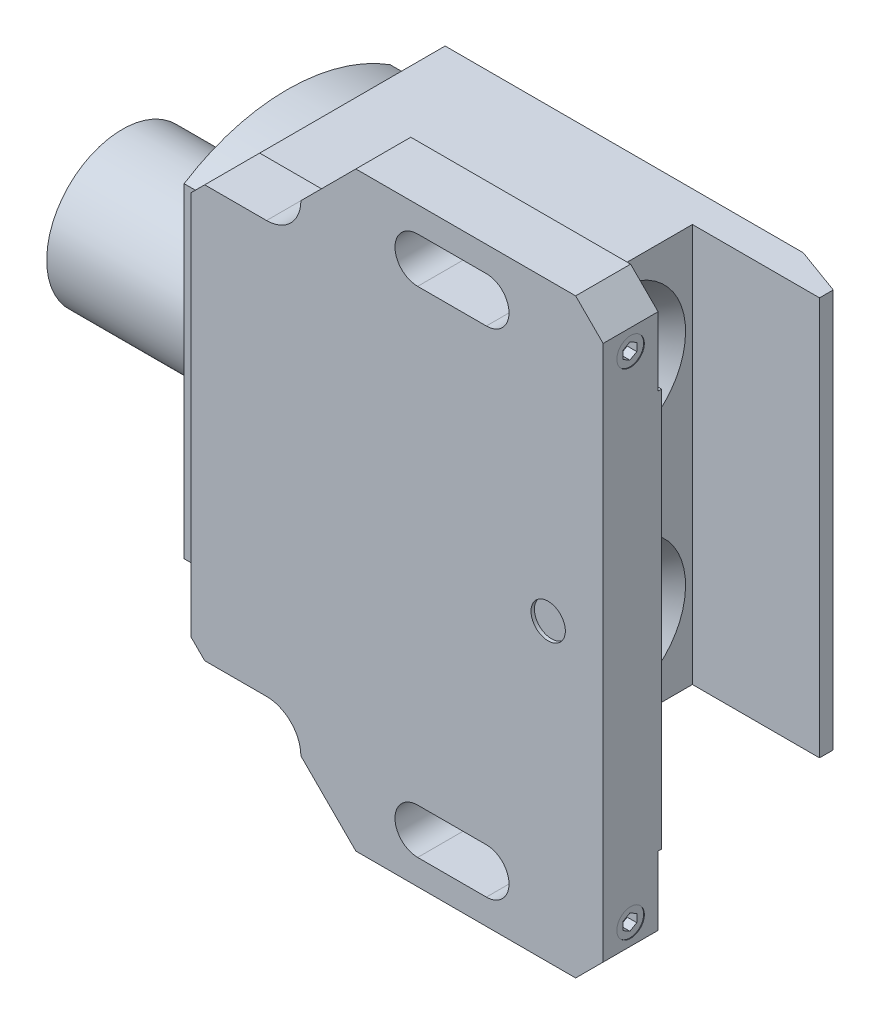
ISO-10303-21;
HEADER;
FILE_DESCRIPTION(('STEP AP214'),'2;1');
FILE_NAME('part.step','',(''),(''),'','','');
FILE_SCHEMA(('AUTOMOTIVE_DESIGN { 1 0 10303 214 1 1 1 1 }'));
ENDSEC;
DATA;
#1=APPLICATION_CONTEXT('core data for automotive mechanical design processes');
#2=APPLICATION_PROTOCOL_DEFINITION('international standard','automotive_design',2000,#1);
#3=PRODUCT_CONTEXT('',#1,'mechanical');
#4=PRODUCT('Part','Part','',(#3));
#5=PRODUCT_RELATED_PRODUCT_CATEGORY('part','',(#4));
#6=PRODUCT_DEFINITION_FORMATION('','',#4);
#7=PRODUCT_DEFINITION_CONTEXT('part definition',#1,'design');
#8=PRODUCT_DEFINITION('design','',#6,#7);
#9=PRODUCT_DEFINITION_SHAPE('','',#8);
#10=(LENGTH_UNIT() NAMED_UNIT(*) SI_UNIT(.MILLI.,.METRE.));
#11=(NAMED_UNIT(*) PLANE_ANGLE_UNIT() SI_UNIT($,.RADIAN.));
#12=(NAMED_UNIT(*) SI_UNIT($,.STERADIAN.) SOLID_ANGLE_UNIT());
#13=UNCERTAINTY_MEASURE_WITH_UNIT(LENGTH_MEASURE(1.E-05),#10,'distance_accuracy_value','');
#14=(GEOMETRIC_REPRESENTATION_CONTEXT(3) GLOBAL_UNCERTAINTY_ASSIGNED_CONTEXT((#13)) GLOBAL_UNIT_ASSIGNED_CONTEXT((#10,
#11,#12)) REPRESENTATION_CONTEXT('',''));
#15=CARTESIAN_POINT('',(0.,0.,0.));
#16=DIRECTION('',(0.,0.,1.));
#17=DIRECTION('',(1.,0.,0.));
#18=AXIS2_PLACEMENT_3D('',#15,#16,#17);
#19=CARTESIAN_POINT('',(-65.5,21.,-9.));
#20=DIRECTION('',(1.,0.,0.));
#21=DIRECTION('',(0.,-1.,0.));
#22=AXIS2_PLACEMENT_3D('',#19,#20,#21);
#23=CYLINDRICAL_SURFACE('',#22,2.75);
#24=CARTESIAN_POINT('',(-65.5,21.,-9.));
#25=DIRECTION('',(-1.,0.,0.));
#26=DIRECTION('',(0.,1.,0.));
#27=AXIS2_PLACEMENT_3D('',#24,#25,#26);
#28=CIRCLE('',#27,2.75);
#29=CARTESIAN_POINT('',(-65.5,23.75,-9.));
#30=VERTEX_POINT('',#29);
#31=EDGE_CURVE('E420',#30,#30,#28,.T.);
#32=ORIENTED_EDGE('',*,*,#31,.F.);
#33=EDGE_LOOP('',(#32));
#34=FACE_BOUND('',#33,.T.);
#35=CARTESIAN_POINT('',(-62.5,21.,-9.));
#36=DIRECTION('',(-1.,0.,0.));
#37=DIRECTION('',(0.,1.,0.));
#38=AXIS2_PLACEMENT_3D('',#35,#36,#37);
#39=CIRCLE('',#38,2.75);
#40=CARTESIAN_POINT('',(-62.5,23.75,-9.));
#41=VERTEX_POINT('',#40);
#42=EDGE_CURVE('E745',#41,#41,#39,.T.);
#43=ORIENTED_EDGE('',*,*,#42,.T.);
#44=EDGE_LOOP('',(#43));
#45=FACE_BOUND('',#44,.T.);
#46=ADVANCED_FACE('F16',(#34,#45),#23,.T.);
#47=CARTESIAN_POINT('',(-65.5,21.,-9.));
#48=DIRECTION('',(-1.,0.,0.));
#49=DIRECTION('',(0.,1.,0.));
#50=AXIS2_PLACEMENT_3D('',#47,#48,#49);
#51=PLANE('',#50);
#52=ORIENTED_EDGE('',*,*,#31,.T.);
#53=EDGE_LOOP('',(#52));
#54=FACE_BOUND('',#53,.T.);
#55=ADVANCED_FACE('F593',(#54),#51,.T.);
#56=CARTESIAN_POINT('',(-18.5,-16.,-20.));
#57=DIRECTION('',(1.,0.,0.));
#58=DIRECTION('',(0.,1.,0.));
#59=AXIS2_PLACEMENT_3D('',#56,#57,#58);
#60=CYLINDRICAL_SURFACE('',#59,8.1);
#61=CARTESIAN_POINT('',(-21.3602086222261,-16.,-20.));
#62=DIRECTION('',(1.,0.,0.));
#63=DIRECTION('',(0.,1.,0.));
#64=AXIS2_PLACEMENT_3D('',#61,#62,#63);
#65=CIRCLE('',#64,8.1);
#66=CARTESIAN_POINT('',(-21.3602086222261,-7.9,-20.));
#67=VERTEX_POINT('',#66);
#68=EDGE_CURVE('E503',#67,#67,#65,.T.);
#69=ORIENTED_EDGE('',*,*,#68,.T.);
#70=EDGE_LOOP('',(#69));
#71=FACE_BOUND('',#70,.T.);
#72=CARTESIAN_POINT('',(-22.,-16.,-20.));
#73=DIRECTION('',(1.,0.,0.));
#74=DIRECTION('',(0.,1.,0.));
#75=AXIS2_PLACEMENT_3D('',#72,#73,#74);
#76=CIRCLE('',#75,8.1);
#77=CARTESIAN_POINT('',(-22.,-7.9,-20.));
#78=VERTEX_POINT('',#77);
#79=EDGE_CURVE('E500',#78,#78,#76,.T.);
#80=ORIENTED_EDGE('',*,*,#79,.F.);
#81=EDGE_LOOP('',(#80));
#82=FACE_BOUND('',#81,.T.);
#83=ADVANCED_FACE('F580',(#71,#82),#60,.F.);
#84=CARTESIAN_POINT('',(-18.5,16.,-20.));
#85=DIRECTION('',(1.,0.,0.));
#86=DIRECTION('',(0.,1.,0.));
#87=AXIS2_PLACEMENT_3D('',#84,#85,#86);
#88=CYLINDRICAL_SURFACE('',#87,8.1);
#89=CARTESIAN_POINT('',(-21.3602086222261,16.,-20.));
#90=DIRECTION('',(1.,0.,0.));
#91=DIRECTION('',(0.,1.,0.));
#92=AXIS2_PLACEMENT_3D('',#89,#90,#91);
#93=CIRCLE('',#92,8.1);
#94=CARTESIAN_POINT('',(-21.3602086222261,24.1,-20.));
#95=VERTEX_POINT('',#94);
#96=EDGE_CURVE('E514',#95,#95,#93,.T.);
#97=ORIENTED_EDGE('',*,*,#96,.T.);
#98=EDGE_LOOP('',(#97));
#99=FACE_BOUND('',#98,.T.);
#100=CARTESIAN_POINT('',(-22.,16.,-20.));
#101=DIRECTION('',(1.,0.,0.));
#102=DIRECTION('',(0.,1.,0.));
#103=AXIS2_PLACEMENT_3D('',#100,#101,#102);
#104=CIRCLE('',#103,8.1);
#105=CARTESIAN_POINT('',(-22.,24.1,-20.));
#106=VERTEX_POINT('',#105);
#107=EDGE_CURVE('E511',#106,#106,#104,.T.);
#108=ORIENTED_EDGE('',*,*,#107,.F.);
#109=EDGE_LOOP('',(#108));
#110=FACE_BOUND('',#109,.T.);
#111=ADVANCED_FACE('F577',(#99,#110),#88,.F.);
#112=CARTESIAN_POINT('',(-22.,-16.,-28.));
#113=DIRECTION('',(-1.,0.,0.));
#114=DIRECTION('',(0.,1.,0.));
#115=AXIS2_PLACEMENT_3D('',#112,#113,#114);
#116=PLANE('',#115);
#117=CARTESIAN_POINT('',(-22.,-16.,-20.));
#118=DIRECTION('',(-1.,0.,0.));
#119=DIRECTION('',(0.,1.,0.));
#120=AXIS2_PLACEMENT_3D('',#117,#118,#119);
#121=CIRCLE('',#120,8.);
#122=CARTESIAN_POINT('',(-22.,-8.,-20.));
#123=VERTEX_POINT('',#122);
#124=EDGE_CURVE('E1410',#123,#123,#121,.T.);
#125=ORIENTED_EDGE('',*,*,#124,.T.);
#126=EDGE_LOOP('',(#125));
#127=FACE_BOUND('',#126,.T.);
#128=ORIENTED_EDGE('',*,*,#79,.T.);
#129=EDGE_LOOP('',(#128));
#130=FACE_BOUND('',#129,.T.);
#131=ADVANCED_FACE('F564',(#127,#130),#116,.F.);
#132=CARTESIAN_POINT('',(-22.,16.,-28.));
#133=DIRECTION('',(-1.,0.,0.));
#134=DIRECTION('',(0.,-1.,0.));
#135=AXIS2_PLACEMENT_3D('',#132,#133,#134);
#136=PLANE('',#135);
#137=CARTESIAN_POINT('',(-22.,16.,-20.));
#138=DIRECTION('',(1.,0.,0.));
#139=DIRECTION('',(0.,-1.,0.));
#140=AXIS2_PLACEMENT_3D('',#137,#138,#139);
#141=CIRCLE('',#140,8.);
#142=CARTESIAN_POINT('',(-22.,8.,-20.));
#143=VERTEX_POINT('',#142);
#144=EDGE_CURVE('E1407',#143,#143,#141,.T.);
#145=ORIENTED_EDGE('',*,*,#144,.F.);
#146=EDGE_LOOP('',(#145));
#147=FACE_BOUND('',#146,.T.);
#148=ORIENTED_EDGE('',*,*,#107,.T.);
#149=EDGE_LOOP('',(#148));
#150=FACE_BOUND('',#149,.T.);
#151=ADVANCED_FACE('F570',(#147,#150),#136,.F.);
#152=CARTESIAN_POINT('',(-21.3602086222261,-16.,-20.));
#153=DIRECTION('',(1.,0.,0.));
#154=DIRECTION('',(0.,1.,0.));
#155=AXIS2_PLACEMENT_3D('',#152,#153,#154);
#156=CONICAL_SURFACE('',#155,8.1,0.698131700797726);
#157=CARTESIAN_POINT('',(-18.5,-16.,-20.));
#158=DIRECTION('',(1.,0.,0.));
#159=DIRECTION('',(0.,1.,0.));
#160=AXIS2_PLACEMENT_3D('',#157,#158,#159);
#161=CIRCLE('',#160,10.5);
#162=CARTESIAN_POINT('',(-18.5,-5.5,-20.));
#163=VERTEX_POINT('',#162);
#164=EDGE_CURVE('E507',#163,#163,#161,.T.);
#165=ORIENTED_EDGE('',*,*,#164,.T.);
#166=EDGE_LOOP('',(#165));
#167=FACE_BOUND('',#166,.T.);
#168=ORIENTED_EDGE('',*,*,#68,.F.);
#169=EDGE_LOOP('',(#168));
#170=FACE_BOUND('',#169,.T.);
#171=ADVANCED_FACE('F575',(#167,#170),#156,.F.);
#172=CARTESIAN_POINT('',(-21.3602086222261,16.,-20.));
#173=DIRECTION('',(1.,0.,0.));
#174=DIRECTION('',(0.,1.,0.));
#175=AXIS2_PLACEMENT_3D('',#172,#173,#174);
#176=CONICAL_SURFACE('',#175,8.1,0.698131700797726);
#177=CARTESIAN_POINT('',(-18.5,16.,-20.));
#178=DIRECTION('',(1.,0.,0.));
#179=DIRECTION('',(0.,1.,0.));
#180=AXIS2_PLACEMENT_3D('',#177,#178,#179);
#181=CIRCLE('',#180,10.5);
#182=CARTESIAN_POINT('',(-18.5,26.5,-20.));
#183=VERTEX_POINT('',#182);
#184=EDGE_CURVE('E504',#183,#183,#181,.T.);
#185=ORIENTED_EDGE('',*,*,#184,.T.);
#186=EDGE_LOOP('',(#185));
#187=FACE_BOUND('',#186,.T.);
#188=ORIENTED_EDGE('',*,*,#96,.F.);
#189=EDGE_LOOP('',(#188));
#190=FACE_BOUND('',#189,.T.);
#191=ADVANCED_FACE('F572',(#187,#190),#176,.F.);
#192=CARTESIAN_POINT('',(-26.,0.,-25.5));
#193=DIRECTION('',(-1.,0.,0.));
#194=DIRECTION('',(0.,1.,0.));
#195=AXIS2_PLACEMENT_3D('',#192,#193,#194);
#196=PLANE('',#195);
#197=CARTESIAN_POINT('',(-26.,0.,-20.));
#198=DIRECTION('',(-1.,0.,0.));
#199=DIRECTION('',(0.,1.,0.));
#200=AXIS2_PLACEMENT_3D('',#197,#198,#199);
#201=CIRCLE('',#200,5.5);
#202=CARTESIAN_POINT('',(-26.,5.5,-20.));
#203=VERTEX_POINT('',#202);
#204=EDGE_CURVE('E882',#203,#203,#201,.F.);
#205=ORIENTED_EDGE('',*,*,#204,.F.);
#206=EDGE_LOOP('',(#205));
#207=FACE_BOUND('',#206,.T.);
#208=CARTESIAN_POINT('',(-26.,0.,-20.));
#209=DIRECTION('',(1.,0.,0.));
#210=DIRECTION('',(0.,-1.,0.));
#211=AXIS2_PLACEMENT_3D('',#208,#209,#210);
#212=CIRCLE('',#211,3.25);
#213=CARTESIAN_POINT('',(-26.,-3.25,-20.));
#214=VERTEX_POINT('',#213);
#215=EDGE_CURVE('E1386',#214,#214,#212,.T.);
#216=ORIENTED_EDGE('',*,*,#215,.T.);
#217=EDGE_LOOP('',(#216));
#218=FACE_BOUND('',#217,.T.);
#219=ADVANCED_FACE('F562',(#207,#218),#196,.T.);
#220=CARTESIAN_POINT('',(-8.,0.,-12.5));
#221=DIRECTION('',(0.,0.,-1.));
#222=DIRECTION('',(0.,-1.,0.));
#223=AXIS2_PLACEMENT_3D('',#220,#221,#222);
#224=PLANE('',#223);
#225=CARTESIAN_POINT('',(-8.,0.,-12.5));
#226=DIRECTION('',(0.,0.,-1.));
#227=DIRECTION('',(0.,-1.,0.));
#228=AXIS2_PLACEMENT_3D('',#225,#226,#227);
#229=CIRCLE('',#228,2.5);
#230=CARTESIAN_POINT('',(-8.,-2.5,-12.5));
#231=VERTEX_POINT('',#230);
#232=EDGE_CURVE('E523',#231,#231,#229,.F.);
#233=ORIENTED_EDGE('',*,*,#232,.F.);
#234=EDGE_LOOP('',(#233));
#235=FACE_BOUND('',#234,.T.);
#236=ADVANCED_FACE('F558',(#235),#224,.T.);
#237=CARTESIAN_POINT('',(-18.5,-16.,-20.));
#238=DIRECTION('',(-1.,0.,0.));
#239=DIRECTION('',(0.,1.,0.));
#240=AXIS2_PLACEMENT_3D('',#237,#238,#239);
#241=CYLINDRICAL_SURFACE('',#240,8.);
#242=CARTESIAN_POINT('',(-49.,-16.,-20.));
#243=DIRECTION('',(1.,0.,0.));
#244=DIRECTION('',(0.,0.,1.));
#245=AXIS2_PLACEMENT_3D('',#242,#243,#244);
#246=CIRCLE('',#245,8.);
#247=CARTESIAN_POINT('',(-49.,-16.,-12.));
#248=VERTEX_POINT('',#247);
#249=EDGE_CURVE('E1404',#248,#248,#246,.F.);
#250=ORIENTED_EDGE('',*,*,#249,.T.);
#251=EDGE_LOOP('',(#250));
#252=FACE_BOUND('',#251,.T.);
#253=ORIENTED_EDGE('',*,*,#124,.F.);
#254=EDGE_LOOP('',(#253));
#255=FACE_BOUND('',#254,.T.);
#256=ADVANCED_FACE('F561',(#252,#255),#241,.F.);
#257=CARTESIAN_POINT('',(-18.5,16.,-20.));
#258=DIRECTION('',(-1.,0.,0.));
#259=DIRECTION('',(0.,-1.,0.));
#260=AXIS2_PLACEMENT_3D('',#257,#258,#259);
#261=CYLINDRICAL_SURFACE('',#260,8.);
#262=CARTESIAN_POINT('',(-49.,16.,-20.));
#263=DIRECTION('',(1.,0.,0.));
#264=DIRECTION('',(0.,0.,1.));
#265=AXIS2_PLACEMENT_3D('',#262,#263,#264);
#266=CIRCLE('',#265,8.);
#267=CARTESIAN_POINT('',(-49.,16.,-12.));
#268=VERTEX_POINT('',#267);
#269=EDGE_CURVE('E1403',#268,#268,#266,.F.);
#270=ORIENTED_EDGE('',*,*,#269,.T.);
#271=EDGE_LOOP('',(#270));
#272=FACE_BOUND('',#271,.T.);
#273=ORIENTED_EDGE('',*,*,#144,.T.);
#274=EDGE_LOOP('',(#273));
#275=FACE_BOUND('',#274,.T.);
#276=ADVANCED_FACE('F1296',(#272,#275),#261,.F.);
#277=CARTESIAN_POINT('',(-8.37055998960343,0.,-20.));
#278=DIRECTION('',(1.,0.,0.));
#279=DIRECTION('',(0.,-1.,0.));
#280=AXIS2_PLACEMENT_3D('',#277,#278,#279);
#281=CYLINDRICAL_SURFACE('',#280,5.5);
#282=ORIENTED_EDGE('',*,*,#204,.T.);
#283=EDGE_LOOP('',(#282));
#284=FACE_BOUND('',#283,.T.);
#285=CARTESIAN_POINT('',(-49.,0.,-20.));
#286=DIRECTION('',(1.,0.,0.));
#287=DIRECTION('',(0.,-1.,0.));
#288=AXIS2_PLACEMENT_3D('',#285,#286,#287);
#289=CIRCLE('',#288,5.5);
#290=CARTESIAN_POINT('',(-49.,-5.5,-20.));
#291=VERTEX_POINT('',#290);
#292=EDGE_CURVE('E1383',#291,#291,#289,.T.);
#293=ORIENTED_EDGE('',*,*,#292,.F.);
#294=EDGE_LOOP('',(#293));
#295=FACE_BOUND('',#294,.T.);
#296=ADVANCED_FACE('F1290',(#284,#295),#281,.F.);
#297=CARTESIAN_POINT('',(-14.,-37.25,-4.));
#298=DIRECTION('',(1.,0.,0.));
#299=DIRECTION('',(0.,-1.,0.));
#300=AXIS2_PLACEMENT_3D('',#297,#298,#299);
#301=PLANE('',#300);
#302=CARTESIAN_POINT('',(-14.,-36.,-4.));
#303=DIRECTION('',(1.,0.,0.));
#304=DIRECTION('',(0.,-1.,0.));
#305=AXIS2_PLACEMENT_3D('',#302,#303,#304);
#306=CIRCLE('',#305,2.);
#307=CARTESIAN_POINT('',(-14.0000000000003,-37.3747727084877,-2.54741609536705));
#308=VERTEX_POINT('',#307);
#309=CARTESIAN_POINT('',(-14.,-34.6252272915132,-2.5474160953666));
#310=VERTEX_POINT('',#309);
#311=EDGE_CURVE('E1039',#308,#310,#306,.F.);
#312=ORIENTED_EDGE('',*,*,#311,.T.);
#313=CARTESIAN_POINT('',(-14.,-34.6252272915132,-5.4525839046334));
#314=VERTEX_POINT('',#313);
#315=EDGE_CURVE('E524',#310,#314,#306,.F.);
#316=ORIENTED_EDGE('',*,*,#315,.T.);
#317=CARTESIAN_POINT('',(-14.,-37.3747727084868,-5.4525839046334));
#318=VERTEX_POINT('',#317);
#319=EDGE_CURVE('E1024',#314,#318,#306,.F.);
#320=ORIENTED_EDGE('',*,*,#319,.T.);
#321=EDGE_CURVE('E1043',#318,#308,#306,.F.);
#322=ORIENTED_EDGE('',*,*,#321,.T.);
#323=EDGE_LOOP('',(#312,#316,#320,#322));
#324=FACE_BOUND('',#323,.T.);
#325=ADVANCED_FACE('F1096',(#324),#301,.F.);
#326=CARTESIAN_POINT('',(-14.,34.75,-4.));
#327=DIRECTION('',(1.,0.,0.));
#328=DIRECTION('',(0.,-1.,0.));
#329=AXIS2_PLACEMENT_3D('',#326,#327,#328);
#330=PLANE('',#329);
#331=CARTESIAN_POINT('',(-14.,36.,-4.));
#332=DIRECTION('',(1.,0.,0.));
#333=DIRECTION('',(0.,-1.,0.));
#334=AXIS2_PLACEMENT_3D('',#331,#332,#333);
#335=CIRCLE('',#334,2.);
#336=CARTESIAN_POINT('',(-14.0000000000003,34.6252272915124,-2.54741609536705));
#337=VERTEX_POINT('',#336);
#338=CARTESIAN_POINT('',(-14.,37.3747727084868,-2.5474160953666));
#339=VERTEX_POINT('',#338);
#340=EDGE_CURVE('E445',#337,#339,#335,.F.);
#341=ORIENTED_EDGE('',*,*,#340,.T.);
#342=CARTESIAN_POINT('',(-14.,37.3747727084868,-5.4525839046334));
#343=VERTEX_POINT('',#342);
#344=EDGE_CURVE('E1278',#339,#343,#335,.F.);
#345=ORIENTED_EDGE('',*,*,#344,.T.);
#346=CARTESIAN_POINT('',(-14.,34.6252272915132,-5.4525839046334));
#347=VERTEX_POINT('',#346);
#348=EDGE_CURVE('E449',#343,#347,#335,.F.);
#349=ORIENTED_EDGE('',*,*,#348,.T.);
#350=EDGE_CURVE('E450',#347,#337,#335,.F.);
#351=ORIENTED_EDGE('',*,*,#350,.T.);
#352=EDGE_LOOP('',(#341,#345,#349,#351));
#353=FACE_BOUND('',#352,.T.);
#354=ADVANCED_FACE('F586',(#353),#330,.F.);
#355=CARTESIAN_POINT('',(-18.5,-16.,-9.5));
#356=DIRECTION('',(1.,0.,0.));
#357=DIRECTION('',(0.,1.,0.));
#358=AXIS2_PLACEMENT_3D('',#355,#356,#357);
#359=PLANE('',#358);
#360=ORIENTED_EDGE('',*,*,#164,.F.);
#361=EDGE_LOOP('',(#360));
#362=FACE_BOUND('',#361,.T.);
#363=CARTESIAN_POINT('',(-18.5,0.,-20.));
#364=DIRECTION('',(1.,0.,0.));
#365=DIRECTION('',(0.,-1.,0.));
#366=AXIS2_PLACEMENT_3D('',#363,#364,#365);
#367=CIRCLE('',#366,3.25);
#368=CARTESIAN_POINT('',(-18.5,-3.25,-20.));
#369=VERTEX_POINT('',#368);
#370=EDGE_CURVE('E1389',#369,#369,#367,.T.);
#371=ORIENTED_EDGE('',*,*,#370,.F.);
#372=EDGE_LOOP('',(#371));
#373=FACE_BOUND('',#372,.T.);
#374=DIRECTION('',(0.,0.,1.));
#375=VECTOR('',#374,1.);
#376=CARTESIAN_POINT('',(-18.5,29.,0.));
#377=LINE('',#376,#375);
#378=CARTESIAN_POINT('',(-18.5,29.,-31.5));
#379=VERTEX_POINT('',#378);
#380=CARTESIAN_POINT('',(-18.5,29.,-8.5));
#381=VERTEX_POINT('',#380);
#382=EDGE_CURVE('E1430',#379,#381,#377,.T.);
#383=ORIENTED_EDGE('',*,*,#382,.T.);
#384=DIRECTION('',(0.,-1.,0.));
#385=VECTOR('',#384,1.);
#386=CARTESIAN_POINT('',(-18.5,37.5,-8.5));
#387=LINE('',#386,#385);
#388=CARTESIAN_POINT('',(-18.5,-29.,-8.5));
#389=VERTEX_POINT('',#388);
#390=EDGE_CURVE('E878',#381,#389,#387,.T.);
#391=ORIENTED_EDGE('',*,*,#390,.T.);
#392=DIRECTION('',(0.,0.,1.));
#393=VECTOR('',#392,1.);
#394=CARTESIAN_POINT('',(-18.5,-29.,0.));
#395=LINE('',#394,#393);
#396=CARTESIAN_POINT('',(-18.5,-29.,-31.5));
#397=VERTEX_POINT('',#396);
#398=EDGE_CURVE('E1420',#397,#389,#395,.T.);
#399=ORIENTED_EDGE('',*,*,#398,.F.);
#400=DIRECTION('',(0.,-1.,0.));
#401=VECTOR('',#400,1.);
#402=CARTESIAN_POINT('',(-18.5,37.5,-31.5));
#403=LINE('',#402,#401);
#404=EDGE_CURVE('E997',#379,#397,#403,.T.);
#405=ORIENTED_EDGE('',*,*,#404,.F.);
#406=EDGE_LOOP('',(#383,#391,#399,#405));
#407=FACE_BOUND('',#406,.T.);
#408=ORIENTED_EDGE('',*,*,#184,.F.);
#409=EDGE_LOOP('',(#408));
#410=FACE_BOUND('',#409,.T.);
#411=ADVANCED_FACE('F583',(#362,#373,#407,#410),#359,.T.);
#412=CARTESIAN_POINT('',(-8.37055998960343,0.,-20.));
#413=DIRECTION('',(1.,0.,0.));
#414=DIRECTION('',(0.,-1.,0.));
#415=AXIS2_PLACEMENT_3D('',#412,#413,#414);
#416=CYLINDRICAL_SURFACE('',#415,3.25);
#417=ORIENTED_EDGE('',*,*,#370,.T.);
#418=EDGE_LOOP('',(#417));
#419=FACE_BOUND('',#418,.T.);
#420=ORIENTED_EDGE('',*,*,#215,.F.);
#421=EDGE_LOOP('',(#420));
#422=FACE_BOUND('',#421,.T.);
#423=ADVANCED_FACE('F555',(#419,#422),#416,.F.);
#424=CARTESIAN_POINT('',(-8.,0.,-12.5));
#425=DIRECTION('',(0.,0.,1.));
#426=DIRECTION('',(0.,1.,0.));
#427=AXIS2_PLACEMENT_3D('',#424,#425,#426);
#428=CYLINDRICAL_SURFACE('',#427,2.5);
#429=ORIENTED_EDGE('',*,*,#232,.T.);
#430=EDGE_LOOP('',(#429));
#431=FACE_BOUND('',#430,.T.);
#432=CARTESIAN_POINT('',(-8.,0.,-8.5));
#433=DIRECTION('',(0.,0.,1.));
#434=DIRECTION('',(1.,0.,0.));
#435=AXIS2_PLACEMENT_3D('',#432,#433,#434);
#436=CIRCLE('',#435,2.5);
#437=CARTESIAN_POINT('',(-5.5,0.,-8.5));
#438=VERTEX_POINT('',#437);
#439=EDGE_CURVE('E515',#438,#438,#436,.T.);
#440=ORIENTED_EDGE('',*,*,#439,.F.);
#441=EDGE_LOOP('',(#440));
#442=FACE_BOUND('',#441,.T.);
#443=ADVANCED_FACE('F551',(#431,#442),#428,.T.);
#444=CARTESIAN_POINT('',(-49.,0.,0.));
#445=DIRECTION('',(1.,0.,0.));
#446=DIRECTION('',(0.,0.,1.));
#447=AXIS2_PLACEMENT_3D('',#444,#445,#446);
#448=PLANE('',#447);
#449=ORIENTED_EDGE('',*,*,#292,.T.);
#450=EDGE_LOOP('',(#449));
#451=FACE_BOUND('',#450,.T.);
#452=ORIENTED_EDGE('',*,*,#269,.F.);
#453=EDGE_LOOP('',(#452));
#454=FACE_BOUND('',#453,.T.);
#455=DIRECTION('',(0.,1.,0.));
#456=VECTOR('',#455,1.);
#457=CARTESIAN_POINT('',(-49.,-24.5,-11.5));
#458=LINE('',#457,#456);
#459=CARTESIAN_POINT('',(-49.,-19.5,-11.5));
#460=VERTEX_POINT('',#459);
#461=CARTESIAN_POINT('',(-49.,19.5,-11.5));
#462=VERTEX_POINT('',#461);
#463=EDGE_CURVE('E1400',#460,#462,#458,.T.);
#464=ORIENTED_EDGE('',*,*,#463,.T.);
#465=CARTESIAN_POINT('',(-49.,19.5,-16.5));
#466=DIRECTION('',(1.,0.,0.));
#467=DIRECTION('',(0.,0.,1.));
#468=AXIS2_PLACEMENT_3D('',#465,#466,#467);
#469=CIRCLE('',#468,5.);
#470=CARTESIAN_POINT('',(-49.,24.5,-16.5));
#471=VERTEX_POINT('',#470);
#472=EDGE_CURVE('E1452',#462,#471,#469,.F.);
#473=ORIENTED_EDGE('',*,*,#472,.T.);
#474=DIRECTION('',(0.,0.,-1.));
#475=VECTOR('',#474,1.);
#476=CARTESIAN_POINT('',(-49.,24.5,-11.5));
#477=LINE('',#476,#475);
#478=CARTESIAN_POINT('',(-49.,24.5,-23.5));
#479=VERTEX_POINT('',#478);
#480=EDGE_CURVE('E1392',#471,#479,#477,.T.);
#481=ORIENTED_EDGE('',*,*,#480,.T.);
#482=CARTESIAN_POINT('',(-49.,19.5,-23.5));
#483=DIRECTION('',(1.,0.,0.));
#484=DIRECTION('',(0.,0.,1.));
#485=AXIS2_PLACEMENT_3D('',#482,#483,#484);
#486=CIRCLE('',#485,5.);
#487=CARTESIAN_POINT('',(-49.,19.5,-28.5));
#488=VERTEX_POINT('',#487);
#489=EDGE_CURVE('E1450',#479,#488,#486,.F.);
#490=ORIENTED_EDGE('',*,*,#489,.T.);
#491=DIRECTION('',(0.,-1.,0.));
#492=VECTOR('',#491,1.);
#493=CARTESIAN_POINT('',(-49.,-24.5,-28.5));
#494=LINE('',#493,#492);
#495=CARTESIAN_POINT('',(-49.,-19.5,-28.5));
#496=VERTEX_POINT('',#495);
#497=EDGE_CURVE('E1395',#488,#496,#494,.T.);
#498=ORIENTED_EDGE('',*,*,#497,.T.);
#499=CARTESIAN_POINT('',(-49.,-19.5,-23.5));
#500=DIRECTION('',(1.,0.,0.));
#501=DIRECTION('',(0.,0.,1.));
#502=AXIS2_PLACEMENT_3D('',#499,#500,#501);
#503=CIRCLE('',#502,5.);
#504=CARTESIAN_POINT('',(-49.,-24.5,-23.5));
#505=VERTEX_POINT('',#504);
#506=EDGE_CURVE('E1447',#496,#505,#503,.F.);
#507=ORIENTED_EDGE('',*,*,#506,.T.);
#508=DIRECTION('',(0.,0.,1.));
#509=VECTOR('',#508,1.);
#510=CARTESIAN_POINT('',(-49.,-24.5,-11.5));
#511=LINE('',#510,#509);
#512=CARTESIAN_POINT('',(-49.,-24.5,-16.5));
#513=VERTEX_POINT('',#512);
#514=EDGE_CURVE('E1398',#505,#513,#511,.T.);
#515=ORIENTED_EDGE('',*,*,#514,.T.);
#516=CARTESIAN_POINT('',(-49.,-19.5,-16.5));
#517=DIRECTION('',(1.,0.,0.));
#518=DIRECTION('',(0.,0.,1.));
#519=AXIS2_PLACEMENT_3D('',#516,#517,#518);
#520=CIRCLE('',#519,5.);
#521=EDGE_CURVE('E862',#513,#460,#520,.F.);
#522=ORIENTED_EDGE('',*,*,#521,.T.);
#523=EDGE_LOOP('',(#464,#473,#481,#490,#498,#507,#515,#522));
#524=FACE_BOUND('',#523,.T.);
#525=ORIENTED_EDGE('',*,*,#249,.F.);
#526=EDGE_LOOP('',(#525));
#527=FACE_BOUND('',#526,.T.);
#528=ADVANCED_FACE('F554',(#451,#454,#524,#527),#448,.F.);
#529=CARTESIAN_POINT('',(-8.,0.,-0.5));
#530=DIRECTION('',(0.,0.,-1.));
#531=DIRECTION('',(0.,-1.,0.));
#532=AXIS2_PLACEMENT_3D('',#529,#530,#531);
#533=PLANE('',#532);
#534=CARTESIAN_POINT('',(-8.,0.,-0.5));
#535=DIRECTION('',(0.,0.,-1.));
#536=DIRECTION('',(0.,-1.,0.));
#537=AXIS2_PLACEMENT_3D('',#534,#535,#536);
#538=CIRCLE('',#537,2.5);
#539=CARTESIAN_POINT('',(-8.,-2.5,-0.5));
#540=VERTEX_POINT('',#539);
#541=EDGE_CURVE('E520',#540,#540,#538,.F.);
#542=ORIENTED_EDGE('',*,*,#541,.T.);
#543=EDGE_LOOP('',(#542));
#544=FACE_BOUND('',#543,.T.);
#545=ADVANCED_FACE('F565',(#544),#533,.F.);
#546=CARTESIAN_POINT('',(-60.001,-36.,-4.));
#547=DIRECTION('',(1.,0.,0.));
#548=DIRECTION('',(0.,-1.,0.));
#549=AXIS2_PLACEMENT_3D('',#546,#547,#548);
#550=CYLINDRICAL_SURFACE('',#549,2.);
#551=ORIENTED_EDGE('',*,*,#315,.F.);
#552=CARTESIAN_POINT('',(-14.3751190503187,-38.,-4.));
#553=CARTESIAN_POINT('',(-14.3751098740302,-37.9999939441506,-3.89983879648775));
#554=CARTESIAN_POINT('',(-14.3692811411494,-37.9924079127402,-3.79948948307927));
#555=CARTESIAN_POINT('',(-14.3469594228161,-37.9625745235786,-3.6020840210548));
#556=CARTESIAN_POINT('',(-14.3304336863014,-37.940282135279,-3.50503895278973));
#557=CARTESIAN_POINT('',(-14.2894228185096,-37.882551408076,-3.31769970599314));
#558=CARTESIAN_POINT('',(-14.2650033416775,-37.8472211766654,-3.22735715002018));
#559=CARTESIAN_POINT('',(-14.2110702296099,-37.7647362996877,-3.05399128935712));
#560=CARTESIAN_POINT('',(-14.1815570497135,-37.7175827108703,-2.97096733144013));
#561=CARTESIAN_POINT('',(-14.1162931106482,-37.6059009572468,-2.80314022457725));
#562=CARTESIAN_POINT('',(-14.0802240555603,-37.5399364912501,-2.71941619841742));
#563=CARTESIAN_POINT('',(-14.0084691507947,-37.3954428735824,-2.56331532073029));
#564=CARTESIAN_POINT('',(-13.9727836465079,-37.3169032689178,-2.49094800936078));
#565=CARTESIAN_POINT('',(-13.9011258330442,-37.1389293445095,-2.35167573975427));
#566=CARTESIAN_POINT('',(-13.865560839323,-37.0381436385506,-2.28626724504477));
#567=CARTESIAN_POINT('',(-13.8027089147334,-36.8244331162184,-2.17384463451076));
#568=CARTESIAN_POINT('',(-13.7754142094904,-36.7115198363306,-2.12681323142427));
#569=CARTESIAN_POINT('',(-13.7345535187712,-36.4883193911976,-2.05736079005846));
#570=CARTESIAN_POINT('',(-13.7199130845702,-36.3788389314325,-2.0329958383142));
#571=CARTESIAN_POINT('',(-13.7018313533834,-36.1564683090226,-2.00298521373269));
#572=CARTESIAN_POINT('',(-13.6983792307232,-36.0435815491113,-1.99732144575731));
#573=CARTESIAN_POINT('',(-13.7027601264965,-35.833006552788,-2.00455836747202));
#574=CARTESIAN_POINT('',(-13.7092214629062,-35.7352013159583,-2.01520235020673));
#575=CARTESIAN_POINT('',(-13.7303585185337,-35.5430721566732,-2.0504475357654));
#576=CARTESIAN_POINT('',(-13.7450348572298,-35.4487484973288,-2.0750497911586));
#577=CARTESIAN_POINT('',(-13.7814291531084,-35.2654318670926,-2.13725061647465));
#578=CARTESIAN_POINT('',(-13.8031824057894,-35.1764683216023,-2.17491439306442));
#579=CARTESIAN_POINT('',(-13.8520034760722,-35.0060240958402,-2.26184744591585));
#580=CARTESIAN_POINT('',(-13.8790726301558,-34.9245453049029,-2.31111964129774));
#581=CARTESIAN_POINT('',(-13.9400984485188,-34.7608376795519,-2.42656848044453));
#582=CARTESIAN_POINT('',(-13.9744920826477,-34.6797055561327,-2.49406772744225));
#583=CARTESIAN_POINT('',(-14.0447129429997,-34.5292208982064,-2.64063848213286));
#584=CARTESIAN_POINT('',(-14.0805420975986,-34.4598849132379,-2.71972596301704));
#585=CARTESIAN_POINT('',(-14.1546277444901,-34.3265805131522,-2.89839351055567));
#586=CARTESIAN_POINT('',(-14.1926631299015,-34.2642419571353,-2.99929292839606));
#587=CARTESIAN_POINT('',(-14.2613777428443,-34.1577226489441,-3.21250603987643));
#588=CARTESIAN_POINT('',(-14.2920705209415,-34.1135083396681,-3.32479815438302));
#589=CARTESIAN_POINT('',(-14.3345134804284,-34.0541937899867,-3.52871847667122));
#590=CARTESIAN_POINT('',(-14.3490863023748,-34.0345680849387,-3.61844128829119));
#591=CARTESIAN_POINT('',(-14.3691139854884,-34.0078326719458,-3.80069015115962));
#592=CARTESIAN_POINT('',(-14.3745798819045,-34.0007078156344,-3.89321267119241));
#593=CARTESIAN_POINT('',(-14.3755822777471,-33.9993918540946,-4.07854951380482));
#594=CARTESIAN_POINT('',(-14.3711030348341,-34.0052212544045,-4.17136406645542));
#595=CARTESIAN_POINT('',(-14.3528713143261,-34.0294851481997,-4.35441792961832));
#596=CARTESIAN_POINT('',(-14.3391114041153,-34.0479297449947,-4.44465511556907));
#597=CARTESIAN_POINT('',(-14.3042672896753,-34.0963461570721,-4.61995362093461));
#598=CARTESIAN_POINT('',(-14.2832175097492,-34.1262638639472,-4.70503709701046));
#599=CARTESIAN_POINT('',(-14.2360585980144,-34.1965543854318,-4.8692355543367));
#600=CARTESIAN_POINT('',(-14.2099475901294,-34.2369310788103,-4.94834830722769));
#601=CARTESIAN_POINT('',(-14.1498481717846,-34.3355060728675,-5.11370733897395));
#602=CARTESIAN_POINT('',(-14.1152925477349,-34.3956134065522,-5.19861069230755));
#603=CARTESIAN_POINT('',(-14.0454977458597,-34.5280852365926,-5.35802185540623));
#604=CARTESIAN_POINT('',(-14.010257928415,-34.6004617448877,-5.43251934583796));
#605=CARTESIAN_POINT('',(-13.937374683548,-34.7672422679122,-5.57932699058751));
#606=CARTESIAN_POINT('',(-13.9000636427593,-34.8633056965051,-5.64993841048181));
#607=CARTESIAN_POINT('',(-13.8324229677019,-35.0682949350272,-5.77376193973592));
#608=CARTESIAN_POINT('',(-13.8020889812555,-35.1772126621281,-5.82698490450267));
#609=CARTESIAN_POINT('',(-13.7537310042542,-35.3970904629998,-5.91032193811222));
#610=CARTESIAN_POINT('',(-13.7349935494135,-35.5073730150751,-5.94179361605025));
#611=CARTESIAN_POINT('',(-13.70887153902,-35.7329591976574,-5.98540703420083));
#612=CARTESIAN_POINT('',(-13.7014734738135,-35.8482566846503,-5.99757177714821));
#613=CARTESIAN_POINT('',(-13.69909889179,-36.0634603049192,-6.00148419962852));
#614=CARTESIAN_POINT('',(-13.702560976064,-36.163313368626,-5.9957982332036));
#615=CARTESIAN_POINT('',(-13.7182481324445,-36.3603728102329,-5.96977269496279));
#616=CARTESIAN_POINT('',(-13.7304732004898,-36.4575791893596,-5.94943312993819));
#617=CARTESIAN_POINT('',(-13.7622407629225,-36.6447962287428,-5.89566399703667));
#618=CARTESIAN_POINT('',(-13.7816300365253,-36.7349127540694,-5.86250789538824));
#619=CARTESIAN_POINT('',(-13.8261980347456,-36.9082969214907,-5.7843896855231));
#620=CARTESIAN_POINT('',(-13.8513779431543,-36.991563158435,-5.73942516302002));
#621=CARTESIAN_POINT('',(-13.9086682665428,-37.158566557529,-5.63356239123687));
#622=CARTESIAN_POINT('',(-13.9412330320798,-37.2413885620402,-5.57146961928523));
#623=CARTESIAN_POINT('',(-14.0086614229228,-37.3960766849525,-5.43581771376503));
#624=CARTESIAN_POINT('',(-14.0435276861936,-37.4679299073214,-5.36224528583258));
#625=CARTESIAN_POINT('',(-14.1172435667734,-37.6083504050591,-5.19444856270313));
#626=CARTESIAN_POINT('',(-14.1560145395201,-37.6752450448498,-5.09878089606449));
#627=CARTESIAN_POINT('',(-14.2281274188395,-37.7920505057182,-4.89567683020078));
#628=CARTESIAN_POINT('',(-14.2614735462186,-37.8419745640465,-4.78824969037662));
#629=CARTESIAN_POINT('',(-14.311199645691,-37.9135865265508,-4.58887251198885));
#630=CARTESIAN_POINT('',(-14.3297053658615,-37.939090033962,-4.49882212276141));
#631=CARTESIAN_POINT('',(-14.3578508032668,-37.9772782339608,-4.31484853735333));
#632=CARTESIAN_POINT('',(-14.3675200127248,-37.9900055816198,-4.22093932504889));
#633=CARTESIAN_POINT('',(-14.3730869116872,-37.9973299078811,-4.10545984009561));
#634=CARTESIAN_POINT('',(-14.37384726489,-37.9983300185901,-4.08439112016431));
#635=CARTESIAN_POINT('',(-14.374864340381,-37.9996657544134,-4.04221772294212));
#636=CARTESIAN_POINT('',(-14.375120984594,-38.0000012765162,-4.02111304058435));
#637=CARTESIAN_POINT('',(-14.3751190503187,-38.,-4.));
#638=B_SPLINE_CURVE_WITH_KNOTS('',3,(#552,#553,#554,#555,#556,#557,#558,#559,#560,#561,#562,
#563,#564,#565,#566,#567,#568,#569,#570,#571,#572,#573,#574,#575,#576,#577,#578,#579,#580,#581,
#582,#583,#584,#585,#586,#587,#588,#589,#590,#591,#592,#593,#594,#595,#596,#597,#598,#599,#600,
#601,#602,#603,#604,#605,#606,#607,#608,#609,#610,#611,#612,#613,#614,#615,#616,#617,#618,#619,
#620,#621,#622,#623,#624,#625,#626,#627,#628,#629,#630,#631,#632,#633,#634,#635,#636,#637),
.UNSPECIFIED.,.T.,.F.,(4,2,2,2,2,2,2,2,2,2,2,2,2,2,2,2,2,2,2,2,2,2,2,2,2,2,2,2,2,2,2,2,2,2,2,2,
2,2,2,2,2,2,4),(0.,0.300386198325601,0.601696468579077,0.900562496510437,1.19940182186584,
1.53566327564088,1.87220570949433,2.24608097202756,2.61960367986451,2.95691333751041,
3.29389652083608,3.58827225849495,3.88267019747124,4.17855952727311,4.47452334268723,
4.80621340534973,5.13836504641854,5.5101830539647,5.88130949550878,6.15910136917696,
6.43655638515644,6.71445090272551,6.99256824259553,7.26938976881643,7.54631410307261,
7.87390231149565,8.20181311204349,8.57465967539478,8.94727302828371,9.29378490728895,
9.63988363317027,9.93861673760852,10.2373497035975,10.5300321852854,10.8227745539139,
11.1470460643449,11.4716959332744,11.8390084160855,12.2060337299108,12.4911129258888,
12.7752371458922,12.838545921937,12.9018645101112),.UNSPECIFIED.);
#639=EDGE_CURVE('E1269',#310,#314,#638,.T.);
#640=ORIENTED_EDGE('',*,*,#639,.T.);
#641=EDGE_LOOP('',(#551,#640));
#642=FACE_BOUND('',#641,.T.);
#643=ADVANCED_FACE('F568',(#642),#550,.F.);
#644=CARTESIAN_POINT('',(-14.,-36.,-4.));
#645=DIRECTION('',(-1.,0.,0.));
#646=DIRECTION('',(0.,1.,0.));
#647=AXIS2_PLACEMENT_3D('',#644,#645,#646);
#648=CYLINDRICAL_SURFACE('',#647,2.);
#649=ORIENTED_EDGE('',*,*,#319,.F.);
#650=EDGE_CURVE('E1277',#314,#318,#638,.T.);
#651=ORIENTED_EDGE('',*,*,#650,.T.);
#652=EDGE_LOOP('',(#649,#651));
#653=FACE_BOUND('',#652,.T.);
#654=ADVANCED_FACE('F1236',(#653),#648,.T.);
#655=ORIENTED_EDGE('',*,*,#321,.F.);
#656=EDGE_CURVE('E1042',#318,#308,#638,.T.);
#657=ORIENTED_EDGE('',*,*,#656,.T.);
#658=EDGE_LOOP('',(#655,#657));
#659=FACE_BOUND('',#658,.T.);
#660=ADVANCED_FACE('F1233',(#659),#550,.F.);
#661=ORIENTED_EDGE('',*,*,#311,.F.);
#662=EDGE_CURVE('E540',#308,#310,#638,.T.);
#663=ORIENTED_EDGE('',*,*,#662,.T.);
#664=EDGE_LOOP('',(#661,#663));
#665=FACE_BOUND('',#664,.T.);
#666=ADVANCED_FACE('F557',(#665),#648,.T.);
#667=CARTESIAN_POINT('',(-60.001,36.,-4.));
#668=DIRECTION('',(1.,0.,0.));
#669=DIRECTION('',(0.,-1.,0.));
#670=AXIS2_PLACEMENT_3D('',#667,#668,#669);
#671=CYLINDRICAL_SURFACE('',#670,2.);
#672=ORIENTED_EDGE('',*,*,#344,.F.);
#673=CARTESIAN_POINT('',(-14.3751190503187,34.,-4.));
#674=CARTESIAN_POINT('',(-14.3751098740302,34.0000060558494,-3.89983879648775));
#675=CARTESIAN_POINT('',(-14.3692811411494,34.0075920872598,-3.79948948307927));
#676=CARTESIAN_POINT('',(-14.3469594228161,34.0374254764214,-3.6020840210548));
#677=CARTESIAN_POINT('',(-14.3304336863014,34.059717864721,-3.50503895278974));
#678=CARTESIAN_POINT('',(-14.2894228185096,34.117448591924,-3.31769970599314));
#679=CARTESIAN_POINT('',(-14.2650033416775,34.1527788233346,-3.22735715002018));
#680=CARTESIAN_POINT('',(-14.2110702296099,34.2352637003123,-3.05399128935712));
#681=CARTESIAN_POINT('',(-14.1815570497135,34.2824172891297,-2.97096733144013));
#682=CARTESIAN_POINT('',(-14.1162931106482,34.3940990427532,-2.80314022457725));
#683=CARTESIAN_POINT('',(-14.0802240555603,34.4600635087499,-2.71941619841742));
#684=CARTESIAN_POINT('',(-14.0084691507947,34.6045571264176,-2.56331532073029));
#685=CARTESIAN_POINT('',(-13.9727836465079,34.6830967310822,-2.49094800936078));
#686=CARTESIAN_POINT('',(-13.9011258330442,34.8610706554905,-2.35167573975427));
#687=CARTESIAN_POINT('',(-13.865560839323,34.9618563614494,-2.28626724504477));
#688=CARTESIAN_POINT('',(-13.8027089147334,35.1755668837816,-2.17384463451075));
#689=CARTESIAN_POINT('',(-13.7754142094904,35.2884801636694,-2.12681323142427));
#690=CARTESIAN_POINT('',(-13.7345535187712,35.5116806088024,-2.05736079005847));
#691=CARTESIAN_POINT('',(-13.7199130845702,35.6211610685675,-2.0329958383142));
#692=CARTESIAN_POINT('',(-13.7018313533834,35.8435316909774,-2.00298521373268));
#693=CARTESIAN_POINT('',(-13.6983792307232,35.9564184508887,-1.99732144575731));
#694=CARTESIAN_POINT('',(-13.7027601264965,36.166993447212,-2.00455836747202));
#695=CARTESIAN_POINT('',(-13.7092214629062,36.2647986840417,-2.01520235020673));
#696=CARTESIAN_POINT('',(-13.7303585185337,36.4569278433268,-2.0504475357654));
#697=CARTESIAN_POINT('',(-13.7450348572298,36.5512515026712,-2.0750497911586));
#698=CARTESIAN_POINT('',(-13.7814291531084,36.7345681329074,-2.13725061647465));
#699=CARTESIAN_POINT('',(-13.8031824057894,36.8235316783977,-2.17491439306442));
#700=CARTESIAN_POINT('',(-13.8520034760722,36.9939759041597,-2.26184744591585));
#701=CARTESIAN_POINT('',(-13.8790726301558,37.0754546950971,-2.31111964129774));
#702=CARTESIAN_POINT('',(-13.9400984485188,37.2391623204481,-2.42656848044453));
#703=CARTESIAN_POINT('',(-13.9744920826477,37.3202944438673,-2.49406772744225));
#704=CARTESIAN_POINT('',(-14.0447129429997,37.4707791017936,-2.64063848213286));
#705=CARTESIAN_POINT('',(-14.0805420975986,37.5401150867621,-2.71972596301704));
#706=CARTESIAN_POINT('',(-14.1546277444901,37.6734194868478,-2.89839351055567));
#707=CARTESIAN_POINT('',(-14.1926631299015,37.7357580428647,-2.99929292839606));
#708=CARTESIAN_POINT('',(-14.2613777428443,37.8422773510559,-3.21250603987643));
#709=CARTESIAN_POINT('',(-14.2920705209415,37.8864916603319,-3.32479815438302));
#710=CARTESIAN_POINT('',(-14.3345134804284,37.9458062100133,-3.52871847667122));
#711=CARTESIAN_POINT('',(-14.3490863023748,37.9654319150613,-3.61844128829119));
#712=CARTESIAN_POINT('',(-14.3691139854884,37.9921673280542,-3.80069015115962));
#713=CARTESIAN_POINT('',(-14.3745798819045,37.9992921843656,-3.89321267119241));
#714=CARTESIAN_POINT('',(-14.3755822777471,38.0006081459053,-4.07854951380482));
#715=CARTESIAN_POINT('',(-14.3711030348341,37.9947787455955,-4.17136406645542));
#716=CARTESIAN_POINT('',(-14.3528713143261,37.9705148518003,-4.35441792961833));
#717=CARTESIAN_POINT('',(-14.3391114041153,37.9520702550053,-4.44465511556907));
#718=CARTESIAN_POINT('',(-14.3042672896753,37.9036538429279,-4.61995362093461));
#719=CARTESIAN_POINT('',(-14.2832175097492,37.8737361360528,-4.70503709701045));
#720=CARTESIAN_POINT('',(-14.2360585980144,37.8034456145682,-4.8692355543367));
#721=CARTESIAN_POINT('',(-14.2099475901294,37.7630689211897,-4.94834830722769));
#722=CARTESIAN_POINT('',(-14.1498481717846,37.6644939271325,-5.11370733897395));
#723=CARTESIAN_POINT('',(-14.1152925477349,37.6043865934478,-5.19861069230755));
#724=CARTESIAN_POINT('',(-14.0454977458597,37.4719147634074,-5.35802185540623));
#725=CARTESIAN_POINT('',(-14.010257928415,37.3995382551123,-5.43251934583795));
#726=CARTESIAN_POINT('',(-13.937374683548,37.2327577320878,-5.57932699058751));
#727=CARTESIAN_POINT('',(-13.9000636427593,37.1366943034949,-5.6499384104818));
#728=CARTESIAN_POINT('',(-13.8324229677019,36.9317050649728,-5.77376193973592));
#729=CARTESIAN_POINT('',(-13.8020889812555,36.8227873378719,-5.82698490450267));
#730=CARTESIAN_POINT('',(-13.7537310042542,36.6029095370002,-5.91032193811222));
#731=CARTESIAN_POINT('',(-13.7349935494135,36.4926269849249,-5.94179361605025));
#732=CARTESIAN_POINT('',(-13.70887153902,36.2670408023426,-5.98540703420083));
#733=CARTESIAN_POINT('',(-13.7014734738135,36.1517433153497,-5.99757177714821));
#734=CARTESIAN_POINT('',(-13.69909889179,35.9365396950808,-6.00148419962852));
#735=CARTESIAN_POINT('',(-13.702560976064,35.836686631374,-5.9957982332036));
#736=CARTESIAN_POINT('',(-13.7182481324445,35.6396271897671,-5.96977269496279));
#737=CARTESIAN_POINT('',(-13.7304732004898,35.5424208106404,-5.94943312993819));
#738=CARTESIAN_POINT('',(-13.7622407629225,35.3552037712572,-5.89566399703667));
#739=CARTESIAN_POINT('',(-13.7816300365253,35.2650872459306,-5.86250789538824));
#740=CARTESIAN_POINT('',(-13.8261980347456,35.0917030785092,-5.7843896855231));
#741=CARTESIAN_POINT('',(-13.8513779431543,35.0084368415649,-5.73942516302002));
#742=CARTESIAN_POINT('',(-13.9086682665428,34.841433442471,-5.63356239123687));
#743=CARTESIAN_POINT('',(-13.9412330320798,34.7586114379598,-5.57146961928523));
#744=CARTESIAN_POINT('',(-14.0086614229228,34.6039233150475,-5.43581771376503));
#745=CARTESIAN_POINT('',(-14.0435276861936,34.5320700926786,-5.36224528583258));
#746=CARTESIAN_POINT('',(-14.1172435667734,34.3916495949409,-5.19444856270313));
#747=CARTESIAN_POINT('',(-14.1560145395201,34.3247549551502,-5.09878089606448));
#748=CARTESIAN_POINT('',(-14.2281274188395,34.2079494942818,-4.89567683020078));
#749=CARTESIAN_POINT('',(-14.2614735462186,34.1580254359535,-4.78824969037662));
#750=CARTESIAN_POINT('',(-14.311199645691,34.0864134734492,-4.58887251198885));
#751=CARTESIAN_POINT('',(-14.3297053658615,34.060909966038,-4.49882212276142));
#752=CARTESIAN_POINT('',(-14.3578508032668,34.0227217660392,-4.31484853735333));
#753=CARTESIAN_POINT('',(-14.3675200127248,34.0099944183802,-4.22093932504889));
#754=CARTESIAN_POINT('',(-14.3730869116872,34.0026700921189,-4.10545984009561));
#755=CARTESIAN_POINT('',(-14.37384726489,34.0016699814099,-4.08439112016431));
#756=CARTESIAN_POINT('',(-14.374864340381,34.0003342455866,-4.04221772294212));
#757=CARTESIAN_POINT('',(-14.375120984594,33.9999987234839,-4.02111304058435));
#758=CARTESIAN_POINT('',(-14.3751190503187,34.,-4.));
#759=B_SPLINE_CURVE_WITH_KNOTS('',3,(#673,#674,#675,#676,#677,#678,#679,#680,#681,#682,#683,
#684,#685,#686,#687,#688,#689,#690,#691,#692,#693,#694,#695,#696,#697,#698,#699,#700,#701,#702,
#703,#704,#705,#706,#707,#708,#709,#710,#711,#712,#713,#714,#715,#716,#717,#718,#719,#720,#721,
#722,#723,#724,#725,#726,#727,#728,#729,#730,#731,#732,#733,#734,#735,#736,#737,#738,#739,#740,
#741,#742,#743,#744,#745,#746,#747,#748,#749,#750,#751,#752,#753,#754,#755,#756,#757,#758),
.UNSPECIFIED.,.T.,.F.,(4,2,2,2,2,2,2,2,2,2,2,2,2,2,2,2,2,2,2,2,2,2,2,2,2,2,2,2,2,2,2,2,2,2,2,2,
2,2,2,2,2,2,4),(0.,0.300386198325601,0.601696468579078,0.900562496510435,1.19940182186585,
1.53566327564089,1.87220570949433,2.24608097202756,2.61960367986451,2.95691333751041,
3.29389652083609,3.58827225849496,3.88267019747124,4.17855952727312,4.47452334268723,
4.80621340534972,5.13836504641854,5.5101830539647,5.88130949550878,6.15910136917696,
6.43655638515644,6.71445090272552,6.99256824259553,7.26938976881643,7.54631410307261,
7.87390231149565,8.20181311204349,8.57465967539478,8.94727302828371,9.29378490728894,
9.63988363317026,9.93861673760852,10.2373497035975,10.5300321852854,10.8227745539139,
11.1470460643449,11.4716959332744,11.8390084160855,12.2060337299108,12.4911129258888,
12.7752371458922,12.838545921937,12.9018645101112),.UNSPECIFIED.);
#760=EDGE_CURVE('E538',#339,#343,#759,.T.);
#761=ORIENTED_EDGE('',*,*,#760,.T.);
#762=EDGE_LOOP('',(#672,#761));
#763=FACE_BOUND('',#762,.T.);
#764=ADVANCED_FACE('F547',(#763),#671,.F.);
#765=CARTESIAN_POINT('',(-14.,36.,-4.));
#766=DIRECTION('',(-1.,0.,0.));
#767=DIRECTION('',(0.,1.,0.));
#768=AXIS2_PLACEMENT_3D('',#765,#766,#767);
#769=CYLINDRICAL_SURFACE('',#768,2.);
#770=ORIENTED_EDGE('',*,*,#348,.F.);
#771=EDGE_CURVE('E1287',#343,#347,#759,.T.);
#772=ORIENTED_EDGE('',*,*,#771,.T.);
#773=EDGE_LOOP('',(#770,#772));
#774=FACE_BOUND('',#773,.T.);
#775=ADVANCED_FACE('F1098',(#774),#769,.T.);
#776=ORIENTED_EDGE('',*,*,#350,.F.);
#777=EDGE_CURVE('E539',#347,#337,#759,.T.);
#778=ORIENTED_EDGE('',*,*,#777,.T.);
#779=EDGE_LOOP('',(#776,#778));
#780=FACE_BOUND('',#779,.T.);
#781=ADVANCED_FACE('F1103',(#780),#671,.F.);
#782=ORIENTED_EDGE('',*,*,#340,.F.);
#783=EDGE_CURVE('E529',#337,#339,#759,.T.);
#784=ORIENTED_EDGE('',*,*,#783,.T.);
#785=EDGE_LOOP('',(#782,#784));
#786=FACE_BOUND('',#785,.T.);
#787=ADVANCED_FACE('F1099',(#786),#769,.T.);
#788=CARTESIAN_POINT('',(0.,-36.,-4.));
#789=DIRECTION('',(-1.,0.,0.));
#790=DIRECTION('',(0.,1.,0.));
#791=AXIS2_PLACEMENT_3D('',#788,#789,#790);
#792=PLANE('',#791);
#793=CARTESIAN_POINT('',(0.,36.,-4.));
#794=DIRECTION('',(1.,0.,0.));
#795=DIRECTION('',(0.,0.,-1.));
#796=AXIS2_PLACEMENT_3D('',#793,#794,#795);
#797=CIRCLE('',#796,2.);
#798=CARTESIAN_POINT('',(0.,36.,-6.));
#799=VERTEX_POINT('',#798);
#800=EDGE_CURVE('E717',#799,#799,#797,.T.);
#801=ORIENTED_EDGE('',*,*,#800,.F.);
#802=EDGE_LOOP('',(#801));
#803=FACE_BOUND('',#802,.T.);
#804=CARTESIAN_POINT('',(0.,-36.,-4.));
#805=DIRECTION('',(1.,0.,0.));
#806=DIRECTION('',(0.,0.,-1.));
#807=AXIS2_PLACEMENT_3D('',#804,#805,#806);
#808=CIRCLE('',#807,2.);
#809=CARTESIAN_POINT('',(0.,-36.,-6.));
#810=VERTEX_POINT('',#809);
#811=EDGE_CURVE('E725',#810,#810,#808,.T.);
#812=ORIENTED_EDGE('',*,*,#811,.F.);
#813=EDGE_LOOP('',(#812));
#814=FACE_BOUND('',#813,.T.);
#815=DIRECTION('',(0.,-1.,0.));
#816=VECTOR('',#815,1.);
#817=CARTESIAN_POINT('',(0.,-43.,-8.));
#818=LINE('',#817,#816);
#819=CARTESIAN_POINT('',(0.,-29.,-8.));
#820=VERTEX_POINT('',#819);
#821=CARTESIAN_POINT('',(0.,-39.,-8.));
#822=VERTEX_POINT('',#821);
#823=EDGE_CURVE('E1375',#820,#822,#818,.T.);
#824=ORIENTED_EDGE('',*,*,#823,.F.);
#825=DIRECTION('',(0.,0.,-1.));
#826=VECTOR('',#825,1.);
#827=CARTESIAN_POINT('',(0.,-29.,0.));
#828=LINE('',#827,#826);
#829=CARTESIAN_POINT('',(0.,-29.,-8.5));
#830=VERTEX_POINT('',#829);
#831=EDGE_CURVE('E991',#830,#820,#828,.F.);
#832=ORIENTED_EDGE('',*,*,#831,.F.);
#833=DIRECTION('',(0.,-1.,0.));
#834=VECTOR('',#833,1.);
#835=CARTESIAN_POINT('',(0.,37.5,-8.5));
#836=LINE('',#835,#834);
#837=CARTESIAN_POINT('',(0.,29.,-8.5));
#838=VERTEX_POINT('',#837);
#839=EDGE_CURVE('E1413',#838,#830,#836,.T.);
#840=ORIENTED_EDGE('',*,*,#839,.F.);
#841=DIRECTION('',(0.,0.,1.));
#842=VECTOR('',#841,1.);
#843=CARTESIAN_POINT('',(0.,29.,0.));
#844=LINE('',#843,#842);
#845=CARTESIAN_POINT('',(0.,29.,-8.));
#846=VERTEX_POINT('',#845);
#847=EDGE_CURVE('E985',#838,#846,#844,.T.);
#848=ORIENTED_EDGE('',*,*,#847,.T.);
#849=CARTESIAN_POINT('',(0.,39.,-8.));
#850=VERTEX_POINT('',#849);
#851=EDGE_CURVE('E1617',#850,#846,#818,.T.);
#852=ORIENTED_EDGE('',*,*,#851,.F.);
#853=DIRECTION('',(0.,0.,1.));
#854=VECTOR('',#853,1.);
#855=CARTESIAN_POINT('',(0.,39.,0.));
#856=LINE('',#855,#854);
#857=CARTESIAN_POINT('',(0.,39.,0.));
#858=VERTEX_POINT('',#857);
#859=EDGE_CURVE('E884',#850,#858,#856,.T.);
#860=ORIENTED_EDGE('',*,*,#859,.T.);
#861=DIRECTION('',(0.,1.,0.));
#862=VECTOR('',#861,1.);
#863=CARTESIAN_POINT('',(0.,-29.,0.));
#864=LINE('',#863,#862);
#865=CARTESIAN_POINT('',(0.,-39.,0.));
#866=VERTEX_POINT('',#865);
#867=EDGE_CURVE('E1425',#866,#858,#864,.T.);
#868=ORIENTED_EDGE('',*,*,#867,.F.);
#869=DIRECTION('',(0.,0.,-1.));
#870=VECTOR('',#869,1.);
#871=CARTESIAN_POINT('',(0.,-39.,0.));
#872=LINE('',#871,#870);
#873=EDGE_CURVE('E881',#866,#822,#872,.T.);
#874=ORIENTED_EDGE('',*,*,#873,.T.);
#875=EDGE_LOOP('',(#824,#832,#840,#848,#852,#860,#868,#874));
#876=FACE_BOUND('',#875,.T.);
#877=ADVANCED_FACE('F1102',(#803,#814,#876),#792,.F.);
#878=CARTESIAN_POINT('',(0.,-29.,0.));
#879=DIRECTION('',(-1.,0.,0.));
#880=DIRECTION('',(0.,1.,0.));
#881=AXIS2_PLACEMENT_3D('',#878,#879,#880);
#882=PLANE('',#881);
#883=DIRECTION('',(0.,-1.,0.));
#884=VECTOR('',#883,1.);
#885=CARTESIAN_POINT('',(0.,37.5,-31.5));
#886=LINE('',#885,#884);
#887=CARTESIAN_POINT('',(0.,29.,-31.5));
#888=VERTEX_POINT('',#887);
#889=CARTESIAN_POINT('',(0.,-29.,-31.5));
#890=VERTEX_POINT('',#889);
#891=EDGE_CURVE('E1414',#888,#890,#886,.T.);
#892=ORIENTED_EDGE('',*,*,#891,.T.);
#893=DIRECTION('',(0.,0.,1.));
#894=VECTOR('',#893,1.);
#895=CARTESIAN_POINT('',(0.,-29.,0.));
#896=LINE('',#895,#894);
#897=CARTESIAN_POINT('',(0.,-29.,-33.5));
#898=VERTEX_POINT('',#897);
#899=EDGE_CURVE('E982',#890,#898,#896,.F.);
#900=ORIENTED_EDGE('',*,*,#899,.T.);
#901=DIRECTION('',(0.,1.,0.));
#902=VECTOR('',#901,1.);
#903=CARTESIAN_POINT('',(0.,-29.,-33.5));
#904=LINE('',#903,#902);
#905=CARTESIAN_POINT('',(0.,29.,-33.5));
#906=VERTEX_POINT('',#905);
#907=EDGE_CURVE('E863',#898,#906,#904,.T.);
#908=ORIENTED_EDGE('',*,*,#907,.T.);
#909=DIRECTION('',(0.,0.,-1.));
#910=VECTOR('',#909,1.);
#911=CARTESIAN_POINT('',(0.,29.,0.));
#912=LINE('',#911,#910);
#913=EDGE_CURVE('E988',#888,#906,#912,.T.);
#914=ORIENTED_EDGE('',*,*,#913,.F.);
#915=EDGE_LOOP('',(#892,#900,#908,#914));
#916=FACE_BOUND('',#915,.T.);
#917=ADVANCED_FACE('F1301',(#916),#882,.F.);
#918=CARTESIAN_POINT('',(0.,37.5,-31.5));
#919=DIRECTION('',(0.,0.,-1.));
#920=DIRECTION('',(0.,-1.,0.));
#921=AXIS2_PLACEMENT_3D('',#918,#919,#920);
#922=PLANE('',#921);
#923=DIRECTION('',(-1.,0.,0.));
#924=VECTOR('',#923,1.);
#925=CARTESIAN_POINT('',(0.,-29.,-31.5));
#926=LINE('',#925,#924);
#927=EDGE_CURVE('E1422',#890,#397,#926,.T.);
#928=ORIENTED_EDGE('',*,*,#927,.F.);
#929=ORIENTED_EDGE('',*,*,#891,.F.);
#930=DIRECTION('',(-1.,0.,0.));
#931=VECTOR('',#930,1.);
#932=CARTESIAN_POINT('',(0.,29.,-31.5));
#933=LINE('',#932,#931);
#934=EDGE_CURVE('E1433',#888,#379,#933,.T.);
#935=ORIENTED_EDGE('',*,*,#934,.T.);
#936=ORIENTED_EDGE('',*,*,#404,.T.);
#937=EDGE_LOOP('',(#928,#929,#935,#936));
#938=FACE_BOUND('',#937,.T.);
#939=ADVANCED_FACE('F1307',(#938),#922,.F.);
#940=CARTESIAN_POINT('',(0.,37.5,-8.5));
#941=DIRECTION('',(0.,0.,1.));
#942=DIRECTION('',(0.,1.,0.));
#943=AXIS2_PLACEMENT_3D('',#940,#941,#942);
#944=PLANE('',#943);
#945=ORIENTED_EDGE('',*,*,#439,.T.);
#946=EDGE_LOOP('',(#945));
#947=FACE_BOUND('',#946,.T.);
#948=ORIENTED_EDGE('',*,*,#839,.T.);
#949=DIRECTION('',(1.,0.,0.));
#950=VECTOR('',#949,1.);
#951=CARTESIAN_POINT('',(0.,-29.,-8.5));
#952=LINE('',#951,#950);
#953=EDGE_CURVE('E1416',#389,#830,#952,.T.);
#954=ORIENTED_EDGE('',*,*,#953,.F.);
#955=ORIENTED_EDGE('',*,*,#390,.F.);
#956=DIRECTION('',(1.,0.,0.));
#957=VECTOR('',#956,1.);
#958=CARTESIAN_POINT('',(0.,29.,-8.5));
#959=LINE('',#958,#957);
#960=EDGE_CURVE('E1428',#381,#838,#959,.T.);
#961=ORIENTED_EDGE('',*,*,#960,.T.);
#962=EDGE_LOOP('',(#948,#954,#955,#961));
#963=FACE_BOUND('',#962,.T.);
#964=ADVANCED_FACE('F1182',(#947,#963),#944,.F.);
#965=CARTESIAN_POINT('',(-49.,-24.5,-11.5));
#966=DIRECTION('',(0.,0.,1.));
#967=DIRECTION('',(-1.,0.,0.));
#968=AXIS2_PLACEMENT_3D('',#965,#966,#967);
#969=PLANE('',#968);
#970=DIRECTION('',(0.,1.,0.));
#971=VECTOR('',#970,1.);
#972=CARTESIAN_POINT('',(-60.,-11.,-11.5));
#973=LINE('',#972,#971);
#974=CARTESIAN_POINT('',(-60.,-19.5,-11.5));
#975=VERTEX_POINT('',#974);
#976=CARTESIAN_POINT('',(-60.,19.5,-11.5));
#977=VERTEX_POINT('',#976);
#978=EDGE_CURVE('E459',#975,#977,#973,.T.);
#979=ORIENTED_EDGE('',*,*,#978,.T.);
#980=DIRECTION('',(-1.,0.,0.));
#981=VECTOR('',#980,1.);
#982=CARTESIAN_POINT('',(-49.,19.5,-11.5));
#983=LINE('',#982,#981);
#984=EDGE_CURVE('E1445',#977,#462,#983,.F.);
#985=ORIENTED_EDGE('',*,*,#984,.T.);
#986=ORIENTED_EDGE('',*,*,#463,.F.);
#987=DIRECTION('',(-1.,0.,0.));
#988=VECTOR('',#987,1.);
#989=CARTESIAN_POINT('',(-60.,-19.5,-11.5));
#990=LINE('',#989,#988);
#991=EDGE_CURVE('E1443',#460,#975,#990,.T.);
#992=ORIENTED_EDGE('',*,*,#991,.T.);
#993=EDGE_LOOP('',(#979,#985,#986,#992));
#994=FACE_BOUND('',#993,.T.);
#995=ADVANCED_FACE('F1121',(#994),#969,.F.);
#996=CARTESIAN_POINT('',(-49.,19.5,-16.5));
#997=DIRECTION('',(1.,0.,0.));
#998=DIRECTION('',(0.,0.,1.));
#999=AXIS2_PLACEMENT_3D('',#996,#997,#998);
#1000=CYLINDRICAL_SURFACE('',#999,5.);
#1001=ORIENTED_EDGE('',*,*,#472,.F.);
#1002=ORIENTED_EDGE('',*,*,#984,.F.);
#1003=CARTESIAN_POINT('',(-60.,19.5,-16.5));
#1004=DIRECTION('',(-1.,0.,0.));
#1005=DIRECTION('',(0.,-1.,0.));
#1006=AXIS2_PLACEMENT_3D('',#1003,#1004,#1005);
#1007=CIRCLE('',#1006,5.);
#1008=CARTESIAN_POINT('',(-60.,24.5,-16.5));
#1009=VERTEX_POINT('',#1008);
#1010=EDGE_CURVE('E479',#977,#1009,#1007,.T.);
#1011=ORIENTED_EDGE('',*,*,#1010,.T.);
#1012=DIRECTION('',(-1.,0.,0.));
#1013=VECTOR('',#1012,1.);
#1014=CARTESIAN_POINT('',(-60.,24.5,-16.5));
#1015=LINE('',#1014,#1013);
#1016=EDGE_CURVE('E1440',#471,#1009,#1015,.T.);
#1017=ORIENTED_EDGE('',*,*,#1016,.F.);
#1018=EDGE_LOOP('',(#1001,#1002,#1011,#1017));
#1019=FACE_BOUND('',#1018,.T.);
#1020=ADVANCED_FACE('F1471',(#1019),#1000,.F.);
#1021=CARTESIAN_POINT('',(-49.,24.5,-11.5));
#1022=DIRECTION('',(0.,1.,0.));
#1023=DIRECTION('',(1.,0.,0.));
#1024=AXIS2_PLACEMENT_3D('',#1021,#1022,#1023);
#1025=PLANE('',#1024);
#1026=ORIENTED_EDGE('',*,*,#480,.F.);
#1027=ORIENTED_EDGE('',*,*,#1016,.T.);
#1028=DIRECTION('',(0.,0.,-1.));
#1029=VECTOR('',#1028,1.);
#1030=CARTESIAN_POINT('',(-60.,24.5,-20.));
#1031=LINE('',#1030,#1029);
#1032=CARTESIAN_POINT('',(-60.,24.5,-23.5));
#1033=VERTEX_POINT('',#1032);
#1034=EDGE_CURVE('E482',#1009,#1033,#1031,.T.);
#1035=ORIENTED_EDGE('',*,*,#1034,.T.);
#1036=DIRECTION('',(-1.,0.,0.));
#1037=VECTOR('',#1036,1.);
#1038=CARTESIAN_POINT('',(-49.,24.5,-23.5));
#1039=LINE('',#1038,#1037);
#1040=EDGE_CURVE('E1436',#1033,#479,#1039,.F.);
#1041=ORIENTED_EDGE('',*,*,#1040,.T.);
#1042=EDGE_LOOP('',(#1026,#1027,#1035,#1041));
#1043=FACE_BOUND('',#1042,.T.);
#1044=ADVANCED_FACE('F1467',(#1043),#1025,.F.);
#1045=CARTESIAN_POINT('',(-49.,19.5,-23.5));
#1046=DIRECTION('',(1.,0.,0.));
#1047=DIRECTION('',(0.,0.,1.));
#1048=AXIS2_PLACEMENT_3D('',#1045,#1046,#1047);
#1049=CYLINDRICAL_SURFACE('',#1048,5.);
#1050=ORIENTED_EDGE('',*,*,#489,.F.);
#1051=ORIENTED_EDGE('',*,*,#1040,.F.);
#1052=CARTESIAN_POINT('',(-60.,19.5,-23.5));
#1053=DIRECTION('',(-1.,0.,0.));
#1054=DIRECTION('',(0.,-1.,0.));
#1055=AXIS2_PLACEMENT_3D('',#1052,#1053,#1054);
#1056=CIRCLE('',#1055,5.);
#1057=CARTESIAN_POINT('',(-60.,19.5,-28.5));
#1058=VERTEX_POINT('',#1057);
#1059=EDGE_CURVE('E485',#1033,#1058,#1056,.T.);
#1060=ORIENTED_EDGE('',*,*,#1059,.T.);
#1061=DIRECTION('',(-1.,0.,0.));
#1062=VECTOR('',#1061,1.);
#1063=CARTESIAN_POINT('',(-60.,19.5,-28.5));
#1064=LINE('',#1063,#1062);
#1065=EDGE_CURVE('E868',#488,#1058,#1064,.T.);
#1066=ORIENTED_EDGE('',*,*,#1065,.F.);
#1067=EDGE_LOOP('',(#1050,#1051,#1060,#1066));
#1068=FACE_BOUND('',#1067,.T.);
#1069=ADVANCED_FACE('F1463',(#1068),#1049,.F.);
#1070=CARTESIAN_POINT('',(-49.,-24.5,-28.5));
#1071=DIRECTION('',(0.,0.,-1.));
#1072=DIRECTION('',(1.,0.,0.));
#1073=AXIS2_PLACEMENT_3D('',#1070,#1071,#1072);
#1074=PLANE('',#1073);
#1075=ORIENTED_EDGE('',*,*,#497,.F.);
#1076=ORIENTED_EDGE('',*,*,#1065,.T.);
#1077=DIRECTION('',(0.,-1.,0.));
#1078=VECTOR('',#1077,1.);
#1079=CARTESIAN_POINT('',(-60.,-11.,-28.5));
#1080=LINE('',#1079,#1078);
#1081=CARTESIAN_POINT('',(-60.,-19.5,-28.5));
#1082=VERTEX_POINT('',#1081);
#1083=EDGE_CURVE('E488',#1058,#1082,#1080,.T.);
#1084=ORIENTED_EDGE('',*,*,#1083,.T.);
#1085=DIRECTION('',(-1.,0.,0.));
#1086=VECTOR('',#1085,1.);
#1087=CARTESIAN_POINT('',(-49.,-19.5,-28.5));
#1088=LINE('',#1087,#1086);
#1089=EDGE_CURVE('E1454',#1082,#496,#1088,.F.);
#1090=ORIENTED_EDGE('',*,*,#1089,.T.);
#1091=EDGE_LOOP('',(#1075,#1076,#1084,#1090));
#1092=FACE_BOUND('',#1091,.T.);
#1093=ADVANCED_FACE('F1459',(#1092),#1074,.F.);
#1094=CARTESIAN_POINT('',(-49.,-19.5,-23.5));
#1095=DIRECTION('',(1.,0.,0.));
#1096=DIRECTION('',(0.,0.,1.));
#1097=AXIS2_PLACEMENT_3D('',#1094,#1095,#1096);
#1098=CYLINDRICAL_SURFACE('',#1097,5.);
#1099=ORIENTED_EDGE('',*,*,#506,.F.);
#1100=ORIENTED_EDGE('',*,*,#1089,.F.);
#1101=CARTESIAN_POINT('',(-60.,-19.5,-23.5));
#1102=DIRECTION('',(-1.,0.,0.));
#1103=DIRECTION('',(0.,-1.,0.));
#1104=AXIS2_PLACEMENT_3D('',#1101,#1102,#1103);
#1105=CIRCLE('',#1104,5.);
#1106=CARTESIAN_POINT('',(-60.,-24.5,-23.5));
#1107=VERTEX_POINT('',#1106);
#1108=EDGE_CURVE('E491',#1082,#1107,#1105,.T.);
#1109=ORIENTED_EDGE('',*,*,#1108,.T.);
#1110=DIRECTION('',(-1.,0.,0.));
#1111=VECTOR('',#1110,1.);
#1112=CARTESIAN_POINT('',(-60.,-24.5,-23.5));
#1113=LINE('',#1112,#1111);
#1114=EDGE_CURVE('E859',#505,#1107,#1113,.T.);
#1115=ORIENTED_EDGE('',*,*,#1114,.F.);
#1116=EDGE_LOOP('',(#1099,#1100,#1109,#1115));
#1117=FACE_BOUND('',#1116,.T.);
#1118=ADVANCED_FACE('F1479',(#1117),#1098,.F.);
#1119=CARTESIAN_POINT('',(-49.,-24.5,-11.5));
#1120=DIRECTION('',(0.,-1.,0.));
#1121=DIRECTION('',(-1.,0.,0.));
#1122=AXIS2_PLACEMENT_3D('',#1119,#1120,#1121);
#1123=PLANE('',#1122);
#1124=DIRECTION('',(0.,0.,1.));
#1125=VECTOR('',#1124,1.);
#1126=CARTESIAN_POINT('',(-60.,-24.5,-20.));
#1127=LINE('',#1126,#1125);
#1128=CARTESIAN_POINT('',(-60.,-24.5,-16.5));
#1129=VERTEX_POINT('',#1128);
#1130=EDGE_CURVE('E493',#1107,#1129,#1127,.T.);
#1131=ORIENTED_EDGE('',*,*,#1130,.T.);
#1132=DIRECTION('',(-1.,0.,0.));
#1133=VECTOR('',#1132,1.);
#1134=CARTESIAN_POINT('',(-49.,-24.5,-16.5));
#1135=LINE('',#1134,#1133);
#1136=EDGE_CURVE('E856',#1129,#513,#1135,.F.);
#1137=ORIENTED_EDGE('',*,*,#1136,.T.);
#1138=ORIENTED_EDGE('',*,*,#514,.F.);
#1139=ORIENTED_EDGE('',*,*,#1114,.T.);
#1140=EDGE_LOOP('',(#1131,#1137,#1138,#1139));
#1141=FACE_BOUND('',#1140,.T.);
#1142=ADVANCED_FACE('F854',(#1141),#1123,.F.);
#1143=CARTESIAN_POINT('',(-49.,-19.5,-16.5));
#1144=DIRECTION('',(1.,0.,0.));
#1145=DIRECTION('',(0.,0.,1.));
#1146=AXIS2_PLACEMENT_3D('',#1143,#1144,#1145);
#1147=CYLINDRICAL_SURFACE('',#1146,5.);
#1148=ORIENTED_EDGE('',*,*,#521,.F.);
#1149=ORIENTED_EDGE('',*,*,#1136,.F.);
#1150=CARTESIAN_POINT('',(-60.,-19.5,-16.5));
#1151=DIRECTION('',(-1.,0.,0.));
#1152=DIRECTION('',(0.,-1.,0.));
#1153=AXIS2_PLACEMENT_3D('',#1150,#1151,#1152);
#1154=CIRCLE('',#1153,5.);
#1155=EDGE_CURVE('E496',#1129,#975,#1154,.T.);
#1156=ORIENTED_EDGE('',*,*,#1155,.T.);
#1157=ORIENTED_EDGE('',*,*,#991,.F.);
#1158=EDGE_LOOP('',(#1148,#1149,#1156,#1157));
#1159=FACE_BOUND('',#1158,.T.);
#1160=ADVANCED_FACE('F861',(#1159),#1147,.F.);
#1161=CARTESIAN_POINT('',(-65.5,-21.,-31.));
#1162=DIRECTION('',(-1.,0.,0.));
#1163=DIRECTION('',(0.,1.,0.));
#1164=AXIS2_PLACEMENT_3D('',#1161,#1162,#1163);
#1165=PLANE('',#1164);
#1166=CARTESIAN_POINT('',(-65.5,-21.,-31.));
#1167=DIRECTION('',(-1.,0.,0.));
#1168=DIRECTION('',(0.,1.,0.));
#1169=AXIS2_PLACEMENT_3D('',#1166,#1167,#1168);
#1170=CIRCLE('',#1169,2.75);
#1171=CARTESIAN_POINT('',(-65.5,-18.25,-31.));
#1172=VERTEX_POINT('',#1171);
#1173=EDGE_CURVE('E455',#1172,#1172,#1170,.T.);
#1174=ORIENTED_EDGE('',*,*,#1173,.T.);
#1175=EDGE_LOOP('',(#1174));
#1176=FACE_BOUND('',#1175,.T.);
#1177=ADVANCED_FACE('F690',(#1176),#1165,.T.);
#1178=CARTESIAN_POINT('',(-8.,0.,0.));
#1179=DIRECTION('',(0.,0.,1.));
#1180=DIRECTION('',(0.,1.,0.));
#1181=AXIS2_PLACEMENT_3D('',#1178,#1179,#1180);
#1182=CYLINDRICAL_SURFACE('',#1181,2.5);
#1183=CARTESIAN_POINT('',(-8.,0.,0.));
#1184=DIRECTION('',(0.,0.,-1.));
#1185=DIRECTION('',(0.,-1.,0.));
#1186=AXIS2_PLACEMENT_3D('',#1183,#1184,#1185);
#1187=CIRCLE('',#1186,2.5);
#1188=CARTESIAN_POINT('',(-8.,-2.5,0.));
#1189=VERTEX_POINT('',#1188);
#1190=EDGE_CURVE('E994',#1189,#1189,#1187,.T.);
#1191=ORIENTED_EDGE('',*,*,#1190,.F.);
#1192=EDGE_LOOP('',(#1191));
#1193=FACE_BOUND('',#1192,.T.);
#1194=ORIENTED_EDGE('',*,*,#541,.F.);
#1195=EDGE_LOOP('',(#1194));
#1196=FACE_BOUND('',#1195,.T.);
#1197=ADVANCED_FACE('F571',(#1193,#1196),#1182,.F.);
#1198=CARTESIAN_POINT('',(-27.,-36.,0.));
#1199=DIRECTION('',(0.,0.,-1.));
#1200=DIRECTION('',(0.,-1.,0.));
#1201=AXIS2_PLACEMENT_3D('',#1198,#1199,#1200);
#1202=CYLINDRICAL_SURFACE('',#1201,3.3);
#1203=CARTESIAN_POINT('',(-27.,-36.,-8.));
#1204=DIRECTION('',(0.,0.,-1.));
#1205=DIRECTION('',(0.,1.,0.));
#1206=AXIS2_PLACEMENT_3D('',#1203,#1204,#1205);
#1207=CIRCLE('',#1206,3.3);
#1208=CARTESIAN_POINT('',(-27.,-39.3,-8.));
#1209=VERTEX_POINT('',#1208);
#1210=CARTESIAN_POINT('',(-27.,-32.7,-8.));
#1211=VERTEX_POINT('',#1210);
#1212=EDGE_CURVE('E1573',#1209,#1211,#1207,.T.);
#1213=ORIENTED_EDGE('',*,*,#1212,.T.);
#1214=DIRECTION('',(0.,0.,-1.));
#1215=VECTOR('',#1214,1.);
#1216=CARTESIAN_POINT('',(-27.,-32.7,0.));
#1217=LINE('',#1216,#1215);
#1218=CARTESIAN_POINT('',(-27.,-32.7,0.));
#1219=VERTEX_POINT('',#1218);
#1220=EDGE_CURVE('E1581',#1219,#1211,#1217,.T.);
#1221=ORIENTED_EDGE('',*,*,#1220,.F.);
#1222=CARTESIAN_POINT('',(-27.,-36.,0.));
#1223=DIRECTION('',(0.,0.,-1.));
#1224=DIRECTION('',(0.,1.,0.));
#1225=AXIS2_PLACEMENT_3D('',#1222,#1223,#1224);
#1226=CIRCLE('',#1225,3.3);
#1227=CARTESIAN_POINT('',(-27.,-39.3,0.));
#1228=VERTEX_POINT('',#1227);
#1229=EDGE_CURVE('E1562',#1228,#1219,#1226,.T.);
#1230=ORIENTED_EDGE('',*,*,#1229,.F.);
#1231=DIRECTION('',(0.,0.,-1.));
#1232=VECTOR('',#1231,1.);
#1233=CARTESIAN_POINT('',(-27.,-39.3,0.));
#1234=LINE('',#1233,#1232);
#1235=EDGE_CURVE('E1583',#1228,#1209,#1234,.T.);
#1236=ORIENTED_EDGE('',*,*,#1235,.T.);
#1237=EDGE_LOOP('',(#1213,#1221,#1230,#1236));
#1238=FACE_BOUND('',#1237,.T.);
#1239=ADVANCED_FACE('F1117',(#1238),#1202,.F.);
#1240=CARTESIAN_POINT('',(-17.,-39.3,0.));
#1241=DIRECTION('',(0.,-1.,0.));
#1242=DIRECTION('',(-1.,0.,0.));
#1243=AXIS2_PLACEMENT_3D('',#1240,#1241,#1242);
#1244=PLANE('',#1243);
#1245=DIRECTION('',(-1.,0.,0.));
#1246=VECTOR('',#1245,1.);
#1247=CARTESIAN_POINT('',(-17.,-39.3,-8.));
#1248=LINE('',#1247,#1246);
#1249=CARTESIAN_POINT('',(-17.,-39.3,-8.));
#1250=VERTEX_POINT('',#1249);
#1251=EDGE_CURVE('E1570',#1250,#1209,#1248,.T.);
#1252=ORIENTED_EDGE('',*,*,#1251,.T.);
#1253=ORIENTED_EDGE('',*,*,#1235,.F.);
#1254=DIRECTION('',(-1.,0.,0.));
#1255=VECTOR('',#1254,1.);
#1256=CARTESIAN_POINT('',(-17.,-39.3,0.));
#1257=LINE('',#1256,#1255);
#1258=CARTESIAN_POINT('',(-17.,-39.3,0.));
#1259=VERTEX_POINT('',#1258);
#1260=EDGE_CURVE('E1558',#1259,#1228,#1257,.T.);
#1261=ORIENTED_EDGE('',*,*,#1260,.F.);
#1262=DIRECTION('',(0.,0.,-1.));
#1263=VECTOR('',#1262,1.);
#1264=CARTESIAN_POINT('',(-17.,-39.3,0.));
#1265=LINE('',#1264,#1263);
#1266=EDGE_CURVE('E1568',#1259,#1250,#1265,.T.);
#1267=ORIENTED_EDGE('',*,*,#1266,.T.);
#1268=EDGE_LOOP('',(#1252,#1253,#1261,#1267));
#1269=FACE_BOUND('',#1268,.T.);
#1270=ADVANCED_FACE('F1214',(#1269),#1244,.F.);
#1271=CARTESIAN_POINT('',(-17.,-36.,0.));
#1272=DIRECTION('',(0.,0.,-1.));
#1273=DIRECTION('',(0.,-1.,0.));
#1274=AXIS2_PLACEMENT_3D('',#1271,#1272,#1273);
#1275=CYLINDRICAL_SURFACE('',#1274,3.3);
#1276=ORIENTED_EDGE('',*,*,#662,.F.);
#1277=ORIENTED_EDGE('',*,*,#656,.F.);
#1278=ORIENTED_EDGE('',*,*,#650,.F.);
#1279=ORIENTED_EDGE('',*,*,#639,.F.);
#1280=EDGE_LOOP('',(#1276,#1277,#1278,#1279));
#1281=FACE_BOUND('',#1280,.T.);
#1282=CARTESIAN_POINT('',(-17.,-36.,-8.));
#1283=DIRECTION('',(0.,0.,-1.));
#1284=DIRECTION('',(0.,1.,0.));
#1285=AXIS2_PLACEMENT_3D('',#1282,#1283,#1284);
#1286=CIRCLE('',#1285,3.3);
#1287=CARTESIAN_POINT('',(-17.,-32.7,-8.));
#1288=VERTEX_POINT('',#1287);
#1289=EDGE_CURVE('E1551',#1288,#1250,#1286,.T.);
#1290=ORIENTED_EDGE('',*,*,#1289,.T.);
#1291=ORIENTED_EDGE('',*,*,#1266,.F.);
#1292=CARTESIAN_POINT('',(-17.,-36.,0.));
#1293=DIRECTION('',(0.,0.,-1.));
#1294=DIRECTION('',(0.,1.,0.));
#1295=AXIS2_PLACEMENT_3D('',#1292,#1293,#1294);
#1296=CIRCLE('',#1295,3.3);
#1297=CARTESIAN_POINT('',(-17.,-32.7,0.));
#1298=VERTEX_POINT('',#1297);
#1299=EDGE_CURVE('E1555',#1298,#1259,#1296,.T.);
#1300=ORIENTED_EDGE('',*,*,#1299,.F.);
#1301=DIRECTION('',(0.,0.,-1.));
#1302=VECTOR('',#1301,1.);
#1303=CARTESIAN_POINT('',(-17.,-32.7,0.));
#1304=LINE('',#1303,#1302);
#1305=EDGE_CURVE('E1578',#1298,#1288,#1304,.T.);
#1306=ORIENTED_EDGE('',*,*,#1305,.T.);
#1307=EDGE_LOOP('',(#1290,#1291,#1300,#1306));
#1308=FACE_BOUND('',#1307,.T.);
#1309=ADVANCED_FACE('F1228',(#1281,#1308),#1275,.F.);
#1310=CARTESIAN_POINT('',(-17.,-32.7,0.));
#1311=DIRECTION('',(0.,1.,0.));
#1312=DIRECTION('',(1.,0.,0.));
#1313=AXIS2_PLACEMENT_3D('',#1310,#1311,#1312);
#1314=PLANE('',#1313);
#1315=DIRECTION('',(1.,0.,0.));
#1316=VECTOR('',#1315,1.);
#1317=CARTESIAN_POINT('',(-17.,-32.7,-8.));
#1318=LINE('',#1317,#1316);
#1319=EDGE_CURVE('E1559',#1211,#1288,#1318,.T.);
#1320=ORIENTED_EDGE('',*,*,#1319,.T.);
#1321=ORIENTED_EDGE('',*,*,#1305,.F.);
#1322=DIRECTION('',(1.,0.,0.));
#1323=VECTOR('',#1322,1.);
#1324=CARTESIAN_POINT('',(-17.,-32.7,0.));
#1325=LINE('',#1324,#1323);
#1326=EDGE_CURVE('E1565',#1219,#1298,#1325,.T.);
#1327=ORIENTED_EDGE('',*,*,#1326,.F.);
#1328=ORIENTED_EDGE('',*,*,#1220,.T.);
#1329=EDGE_LOOP('',(#1320,#1321,#1327,#1328));
#1330=FACE_BOUND('',#1329,.T.);
#1331=ADVANCED_FACE('F1238',(#1330),#1314,.F.);
#1332=CARTESIAN_POINT('',(-27.,36.,0.));
#1333=DIRECTION('',(0.,0.,-1.));
#1334=DIRECTION('',(0.,-1.,0.));
#1335=AXIS2_PLACEMENT_3D('',#1332,#1333,#1334);
#1336=CYLINDRICAL_SURFACE('',#1335,3.3);
#1337=CARTESIAN_POINT('',(-27.,36.,-8.));
#1338=DIRECTION('',(0.,0.,-1.));
#1339=DIRECTION('',(0.,-1.,0.));
#1340=AXIS2_PLACEMENT_3D('',#1337,#1338,#1339);
#1341=CIRCLE('',#1340,3.3);
#1342=CARTESIAN_POINT('',(-27.,32.7,-8.));
#1343=VERTEX_POINT('',#1342);
#1344=CARTESIAN_POINT('',(-27.,39.3,-8.));
#1345=VERTEX_POINT('',#1344);
#1346=EDGE_CURVE('E1605',#1343,#1345,#1341,.T.);
#1347=ORIENTED_EDGE('',*,*,#1346,.T.);
#1348=DIRECTION('',(0.,0.,-1.));
#1349=VECTOR('',#1348,1.);
#1350=CARTESIAN_POINT('',(-27.,39.3,0.));
#1351=LINE('',#1350,#1349);
#1352=CARTESIAN_POINT('',(-27.,39.3,0.));
#1353=VERTEX_POINT('',#1352);
#1354=EDGE_CURVE('E1611',#1353,#1345,#1351,.T.);
#1355=ORIENTED_EDGE('',*,*,#1354,.F.);
#1356=CARTESIAN_POINT('',(-27.,36.,0.));
#1357=DIRECTION('',(0.,0.,-1.));
#1358=DIRECTION('',(0.,-1.,0.));
#1359=AXIS2_PLACEMENT_3D('',#1356,#1357,#1358);
#1360=CIRCLE('',#1359,3.3);
#1361=CARTESIAN_POINT('',(-27.,32.7,0.));
#1362=VERTEX_POINT('',#1361);
#1363=EDGE_CURVE('E1594',#1362,#1353,#1360,.T.);
#1364=ORIENTED_EDGE('',*,*,#1363,.F.);
#1365=DIRECTION('',(0.,0.,-1.));
#1366=VECTOR('',#1365,1.);
#1367=CARTESIAN_POINT('',(-27.,32.7,0.));
#1368=LINE('',#1367,#1366);
#1369=EDGE_CURVE('E1613',#1362,#1343,#1368,.T.);
#1370=ORIENTED_EDGE('',*,*,#1369,.T.);
#1371=EDGE_LOOP('',(#1347,#1355,#1364,#1370));
#1372=FACE_BOUND('',#1371,.T.);
#1373=ADVANCED_FACE('F1178',(#1372),#1336,.F.);
#1374=CARTESIAN_POINT('',(-17.,32.7,0.));
#1375=DIRECTION('',(0.,-1.,0.));
#1376=DIRECTION('',(-1.,0.,0.));
#1377=AXIS2_PLACEMENT_3D('',#1374,#1375,#1376);
#1378=PLANE('',#1377);
#1379=DIRECTION('',(-1.,0.,0.));
#1380=VECTOR('',#1379,1.);
#1381=CARTESIAN_POINT('',(-17.,32.7,-8.));
#1382=LINE('',#1381,#1380);
#1383=CARTESIAN_POINT('',(-17.,32.7,-8.));
#1384=VERTEX_POINT('',#1383);
#1385=EDGE_CURVE('E1602',#1384,#1343,#1382,.T.);
#1386=ORIENTED_EDGE('',*,*,#1385,.T.);
#1387=ORIENTED_EDGE('',*,*,#1369,.F.);
#1388=DIRECTION('',(-1.,0.,0.));
#1389=VECTOR('',#1388,1.);
#1390=CARTESIAN_POINT('',(-17.,32.7,0.));
#1391=LINE('',#1390,#1389);
#1392=CARTESIAN_POINT('',(-17.,32.7,0.));
#1393=VERTEX_POINT('',#1392);
#1394=EDGE_CURVE('E1590',#1393,#1362,#1391,.T.);
#1395=ORIENTED_EDGE('',*,*,#1394,.F.);
#1396=DIRECTION('',(0.,0.,-1.));
#1397=VECTOR('',#1396,1.);
#1398=CARTESIAN_POINT('',(-17.,32.7,0.));
#1399=LINE('',#1398,#1397);
#1400=EDGE_CURVE('E1600',#1393,#1384,#1399,.T.);
#1401=ORIENTED_EDGE('',*,*,#1400,.T.);
#1402=EDGE_LOOP('',(#1386,#1387,#1395,#1401));
#1403=FACE_BOUND('',#1402,.T.);
#1404=ADVANCED_FACE('F1150',(#1403),#1378,.F.);
#1405=CARTESIAN_POINT('',(-17.,36.,0.));
#1406=DIRECTION('',(0.,0.,-1.));
#1407=DIRECTION('',(0.,-1.,0.));
#1408=AXIS2_PLACEMENT_3D('',#1405,#1406,#1407);
#1409=CYLINDRICAL_SURFACE('',#1408,3.3);
#1410=ORIENTED_EDGE('',*,*,#783,.F.);
#1411=ORIENTED_EDGE('',*,*,#777,.F.);
#1412=ORIENTED_EDGE('',*,*,#771,.F.);
#1413=ORIENTED_EDGE('',*,*,#760,.F.);
#1414=EDGE_LOOP('',(#1410,#1411,#1412,#1413));
#1415=FACE_BOUND('',#1414,.T.);
#1416=CARTESIAN_POINT('',(-17.,36.,-8.));
#1417=DIRECTION('',(0.,0.,-1.));
#1418=DIRECTION('',(0.,-1.,0.));
#1419=AXIS2_PLACEMENT_3D('',#1416,#1417,#1418);
#1420=CIRCLE('',#1419,3.3);
#1421=CARTESIAN_POINT('',(-17.,39.3,-8.));
#1422=VERTEX_POINT('',#1421);
#1423=EDGE_CURVE('E1580',#1422,#1384,#1420,.T.);
#1424=ORIENTED_EDGE('',*,*,#1423,.T.);
#1425=ORIENTED_EDGE('',*,*,#1400,.F.);
#1426=CARTESIAN_POINT('',(-17.,36.,0.));
#1427=DIRECTION('',(0.,0.,-1.));
#1428=DIRECTION('',(0.,-1.,0.));
#1429=AXIS2_PLACEMENT_3D('',#1426,#1427,#1428);
#1430=CIRCLE('',#1429,3.3);
#1431=CARTESIAN_POINT('',(-17.,39.3,0.));
#1432=VERTEX_POINT('',#1431);
#1433=EDGE_CURVE('E1587',#1432,#1393,#1430,.T.);
#1434=ORIENTED_EDGE('',*,*,#1433,.F.);
#1435=DIRECTION('',(0.,0.,-1.));
#1436=VECTOR('',#1435,1.);
#1437=CARTESIAN_POINT('',(-17.,39.3,0.));
#1438=LINE('',#1437,#1436);
#1439=EDGE_CURVE('E1377',#1432,#1422,#1438,.T.);
#1440=ORIENTED_EDGE('',*,*,#1439,.T.);
#1441=EDGE_LOOP('',(#1424,#1425,#1434,#1440));
#1442=FACE_BOUND('',#1441,.T.);
#1443=ADVANCED_FACE('F1191',(#1415,#1442),#1409,.F.);
#1444=CARTESIAN_POINT('',(-17.,39.3,0.));
#1445=DIRECTION('',(0.,1.,0.));
#1446=DIRECTION('',(1.,0.,0.));
#1447=AXIS2_PLACEMENT_3D('',#1444,#1445,#1446);
#1448=PLANE('',#1447);
#1449=DIRECTION('',(1.,0.,0.));
#1450=VECTOR('',#1449,1.);
#1451=CARTESIAN_POINT('',(-17.,39.3,-8.));
#1452=LINE('',#1451,#1450);
#1453=EDGE_CURVE('E1591',#1345,#1422,#1452,.T.);
#1454=ORIENTED_EDGE('',*,*,#1453,.T.);
#1455=ORIENTED_EDGE('',*,*,#1439,.F.);
#1456=DIRECTION('',(1.,0.,0.));
#1457=VECTOR('',#1456,1.);
#1458=CARTESIAN_POINT('',(-17.,39.3,0.));
#1459=LINE('',#1458,#1457);
#1460=EDGE_CURVE('E1597',#1353,#1432,#1459,.T.);
#1461=ORIENTED_EDGE('',*,*,#1460,.F.);
#1462=ORIENTED_EDGE('',*,*,#1354,.T.);
#1463=EDGE_LOOP('',(#1454,#1455,#1461,#1462));
#1464=FACE_BOUND('',#1463,.T.);
#1465=ADVANCED_FACE('F1205',(#1464),#1448,.F.);
#1466=CARTESIAN_POINT('',(-49.,35.,0.));
#1467=DIRECTION('',(0.,0.,1.));
#1468=DIRECTION('',(0.,1.,0.));
#1469=AXIS2_PLACEMENT_3D('',#1466,#1467,#1468);
#1470=CYLINDRICAL_SURFACE('',#1469,5.);
#1471=CARTESIAN_POINT('',(-49.,35.,0.));
#1472=DIRECTION('',(0.,0.,-1.));
#1473=DIRECTION('',(0.,-1.,0.));
#1474=AXIS2_PLACEMENT_3D('',#1471,#1472,#1473);
#1475=CIRCLE('',#1474,5.);
#1476=CARTESIAN_POINT('',(-44.,35.,0.));
#1477=VERTEX_POINT('',#1476);
#1478=CARTESIAN_POINT('',(-49.,30.,0.));
#1479=VERTEX_POINT('',#1478);
#1480=EDGE_CURVE('E936',#1477,#1479,#1475,.T.);
#1481=ORIENTED_EDGE('',*,*,#1480,.F.);
#1482=DIRECTION('',(0.,0.,-1.));
#1483=VECTOR('',#1482,1.);
#1484=CARTESIAN_POINT('',(-44.,35.,0.));
#1485=LINE('',#1484,#1483);
#1486=CARTESIAN_POINT('',(-44.,35.,-8.));
#1487=VERTEX_POINT('',#1486);
#1488=EDGE_CURVE('E915',#1477,#1487,#1485,.T.);
#1489=ORIENTED_EDGE('',*,*,#1488,.T.);
#1490=CARTESIAN_POINT('',(-49.,35.,-8.));
#1491=DIRECTION('',(0.,0.,1.));
#1492=DIRECTION('',(0.,1.,0.));
#1493=AXIS2_PLACEMENT_3D('',#1490,#1491,#1492);
#1494=CIRCLE('',#1493,5.);
#1495=CARTESIAN_POINT('',(-49.,30.,-8.));
#1496=VERTEX_POINT('',#1495);
#1497=EDGE_CURVE('E934',#1496,#1487,#1494,.T.);
#1498=ORIENTED_EDGE('',*,*,#1497,.F.);
#1499=DIRECTION('',(0.,0.,-1.));
#1500=VECTOR('',#1499,1.);
#1501=CARTESIAN_POINT('',(-49.,30.,-8.));
#1502=LINE('',#1501,#1500);
#1503=EDGE_CURVE('E928',#1479,#1496,#1502,.T.);
#1504=ORIENTED_EDGE('',*,*,#1503,.F.);
#1505=EDGE_LOOP('',(#1481,#1489,#1498,#1504));
#1506=FACE_BOUND('',#1505,.T.);
#1507=ADVANCED_FACE('F1177',(#1506),#1470,.F.);
#1508=CARTESIAN_POINT('',(-44.,35.,0.));
#1509=DIRECTION('',(0.707106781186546,-0.707106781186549,0.));
#1510=DIRECTION('',(0.,0.,-1.));
#1511=AXIS2_PLACEMENT_3D('',#1508,#1509,#1510);
#1512=PLANE('',#1511);
#1513=DIRECTION('',(0.707106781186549,0.707106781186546,0.));
#1514=VECTOR('',#1513,1.);
#1515=CARTESIAN_POINT('',(-44.,35.,0.));
#1516=LINE('',#1515,#1514);
#1517=CARTESIAN_POINT('',(-36.,43.,0.));
#1518=VERTEX_POINT('',#1517);
#1519=EDGE_CURVE('E911',#1518,#1477,#1516,.F.);
#1520=ORIENTED_EDGE('',*,*,#1519,.F.);
#1521=DIRECTION('',(0.,0.,1.));
#1522=VECTOR('',#1521,1.);
#1523=CARTESIAN_POINT('',(-36.,43.,-8.));
#1524=LINE('',#1523,#1522);
#1525=CARTESIAN_POINT('',(-36.,43.,-8.));
#1526=VERTEX_POINT('',#1525);
#1527=EDGE_CURVE('E920',#1526,#1518,#1524,.T.);
#1528=ORIENTED_EDGE('',*,*,#1527,.F.);
#1529=DIRECTION('',(-0.707106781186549,-0.707106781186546,0.));
#1530=VECTOR('',#1529,1.);
#1531=CARTESIAN_POINT('',(-44.,35.,-8.));
#1532=LINE('',#1531,#1530);
#1533=EDGE_CURVE('E918',#1487,#1526,#1532,.F.);
#1534=ORIENTED_EDGE('',*,*,#1533,.F.);
#1535=ORIENTED_EDGE('',*,*,#1488,.F.);
#1536=EDGE_LOOP('',(#1520,#1528,#1534,#1535));
#1537=FACE_BOUND('',#1536,.T.);
#1538=ADVANCED_FACE('F1160',(#1537),#1512,.F.);
#1539=CARTESIAN_POINT('',(0.,43.,-8.));
#1540=DIRECTION('',(0.,-1.,0.));
#1541=DIRECTION('',(-1.,0.,0.));
#1542=AXIS2_PLACEMENT_3D('',#1539,#1540,#1541);
#1543=PLANE('',#1542);
#1544=DIRECTION('',(1.,0.,0.));
#1545=VECTOR('',#1544,1.);
#1546=CARTESIAN_POINT('',(0.,43.,-8.));
#1547=LINE('',#1546,#1545);
#1548=CARTESIAN_POINT('',(-4.,43.,-8.));
#1549=VERTEX_POINT('',#1548);
#1550=EDGE_CURVE('E1372',#1526,#1549,#1547,.T.);
#1551=ORIENTED_EDGE('',*,*,#1550,.F.);
#1552=ORIENTED_EDGE('',*,*,#1527,.T.);
#1553=DIRECTION('',(1.,0.,0.));
#1554=VECTOR('',#1553,1.);
#1555=CARTESIAN_POINT('',(0.,43.,0.));
#1556=LINE('',#1555,#1554);
#1557=CARTESIAN_POINT('',(-4.,43.,0.));
#1558=VERTEX_POINT('',#1557);
#1559=EDGE_CURVE('E1373',#1518,#1558,#1556,.T.);
#1560=ORIENTED_EDGE('',*,*,#1559,.T.);
#1561=DIRECTION('',(0.,0.,-1.));
#1562=VECTOR('',#1561,1.);
#1563=CARTESIAN_POINT('',(-4.,43.,-8.));
#1564=LINE('',#1563,#1562);
#1565=EDGE_CURVE('E892',#1558,#1549,#1564,.T.);
#1566=ORIENTED_EDGE('',*,*,#1565,.T.);
#1567=EDGE_LOOP('',(#1551,#1552,#1560,#1566));
#1568=FACE_BOUND('',#1567,.T.);
#1569=ADVANCED_FACE('F1152',(#1568),#1543,.F.);
#1570=CARTESIAN_POINT('',(0.,39.,0.));
#1571=DIRECTION('',(-0.707106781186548,-0.707106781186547,0.));
#1572=DIRECTION('',(0.,0.,1.));
#1573=AXIS2_PLACEMENT_3D('',#1570,#1571,#1572);
#1574=PLANE('',#1573);
#1575=DIRECTION('',(-0.707106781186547,0.707106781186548,0.));
#1576=VECTOR('',#1575,1.);
#1577=CARTESIAN_POINT('',(0.,39.,-8.));
#1578=LINE('',#1577,#1576);
#1579=EDGE_CURVE('E895',#1549,#850,#1578,.F.);
#1580=ORIENTED_EDGE('',*,*,#1579,.F.);
#1581=ORIENTED_EDGE('',*,*,#1565,.F.);
#1582=DIRECTION('',(0.707106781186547,-0.707106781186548,0.));
#1583=VECTOR('',#1582,1.);
#1584=CARTESIAN_POINT('',(0.,39.,0.));
#1585=LINE('',#1584,#1583);
#1586=EDGE_CURVE('E889',#858,#1558,#1585,.F.);
#1587=ORIENTED_EDGE('',*,*,#1586,.F.);
#1588=ORIENTED_EDGE('',*,*,#859,.F.);
#1589=EDGE_LOOP('',(#1580,#1581,#1587,#1588));
#1590=FACE_BOUND('',#1589,.T.);
#1591=ADVANCED_FACE('F1133',(#1590),#1574,.F.);
#1592=CARTESIAN_POINT('',(-4.,-43.,-8.));
#1593=DIRECTION('',(-0.707106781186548,0.707106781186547,0.));
#1594=DIRECTION('',(0.,0.,1.));
#1595=AXIS2_PLACEMENT_3D('',#1592,#1593,#1594);
#1596=PLANE('',#1595);
#1597=DIRECTION('',(0.707106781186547,0.707106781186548,0.));
#1598=VECTOR('',#1597,1.);
#1599=CARTESIAN_POINT('',(-4.,-43.,-8.));
#1600=LINE('',#1599,#1598);
#1601=CARTESIAN_POINT('',(-4.,-43.,-8.));
#1602=VERTEX_POINT('',#1601);
#1603=EDGE_CURVE('E900',#822,#1602,#1600,.F.);
#1604=ORIENTED_EDGE('',*,*,#1603,.F.);
#1605=ORIENTED_EDGE('',*,*,#873,.F.);
#1606=DIRECTION('',(-0.707106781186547,-0.707106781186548,0.));
#1607=VECTOR('',#1606,1.);
#1608=CARTESIAN_POINT('',(-4.,-43.,0.));
#1609=LINE('',#1608,#1607);
#1610=CARTESIAN_POINT('',(-4.,-43.,0.));
#1611=VERTEX_POINT('',#1610);
#1612=EDGE_CURVE('E887',#1611,#866,#1609,.F.);
#1613=ORIENTED_EDGE('',*,*,#1612,.F.);
#1614=DIRECTION('',(0.,0.,1.));
#1615=VECTOR('',#1614,1.);
#1616=CARTESIAN_POINT('',(-4.,-43.,-8.));
#1617=LINE('',#1616,#1615);
#1618=EDGE_CURVE('E897',#1602,#1611,#1617,.T.);
#1619=ORIENTED_EDGE('',*,*,#1618,.F.);
#1620=EDGE_LOOP('',(#1604,#1605,#1613,#1619));
#1621=FACE_BOUND('',#1620,.T.);
#1622=ADVANCED_FACE('F1132',(#1621),#1596,.F.);
#1623=CARTESIAN_POINT('',(0.,-43.,-8.));
#1624=DIRECTION('',(0.,1.,0.));
#1625=DIRECTION('',(1.,0.,0.));
#1626=AXIS2_PLACEMENT_3D('',#1623,#1624,#1625);
#1627=PLANE('',#1626);
#1628=DIRECTION('',(-1.,0.,0.));
#1629=VECTOR('',#1628,1.);
#1630=CARTESIAN_POINT('',(0.,-43.,0.));
#1631=LINE('',#1630,#1629);
#1632=CARTESIAN_POINT('',(-36.,-43.,0.));
#1633=VERTEX_POINT('',#1632);
#1634=EDGE_CURVE('E1371',#1611,#1633,#1631,.T.);
#1635=ORIENTED_EDGE('',*,*,#1634,.T.);
#1636=DIRECTION('',(0.,0.,-1.));
#1637=VECTOR('',#1636,1.);
#1638=CARTESIAN_POINT('',(-36.,-43.,-8.));
#1639=LINE('',#1638,#1637);
#1640=CARTESIAN_POINT('',(-36.,-43.,-8.));
#1641=VERTEX_POINT('',#1640);
#1642=EDGE_CURVE('E902',#1633,#1641,#1639,.T.);
#1643=ORIENTED_EDGE('',*,*,#1642,.T.);
#1644=DIRECTION('',(-1.,0.,0.));
#1645=VECTOR('',#1644,1.);
#1646=CARTESIAN_POINT('',(0.,-43.,-8.));
#1647=LINE('',#1646,#1645);
#1648=EDGE_CURVE('E1369',#1602,#1641,#1647,.T.);
#1649=ORIENTED_EDGE('',*,*,#1648,.F.);
#1650=ORIENTED_EDGE('',*,*,#1618,.T.);
#1651=EDGE_LOOP('',(#1635,#1643,#1649,#1650));
#1652=FACE_BOUND('',#1651,.T.);
#1653=ADVANCED_FACE('F1147',(#1652),#1627,.F.);
#1654=CARTESIAN_POINT('',(-36.,-43.,-8.));
#1655=DIRECTION('',(0.707106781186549,0.707106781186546,0.));
#1656=DIRECTION('',(0.,0.,-1.));
#1657=AXIS2_PLACEMENT_3D('',#1654,#1655,#1656);
#1658=PLANE('',#1657);
#1659=DIRECTION('',(-0.707106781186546,0.707106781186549,0.));
#1660=VECTOR('',#1659,1.);
#1661=CARTESIAN_POINT('',(-36.,-43.,0.));
#1662=LINE('',#1661,#1660);
#1663=CARTESIAN_POINT('',(-44.,-35.,0.));
#1664=VERTEX_POINT('',#1663);
#1665=EDGE_CURVE('E913',#1664,#1633,#1662,.F.);
#1666=ORIENTED_EDGE('',*,*,#1665,.F.);
#1667=DIRECTION('',(0.,0.,1.));
#1668=VECTOR('',#1667,1.);
#1669=CARTESIAN_POINT('',(-44.,-35.,0.));
#1670=LINE('',#1669,#1668);
#1671=CARTESIAN_POINT('',(-44.,-35.,-8.));
#1672=VERTEX_POINT('',#1671);
#1673=EDGE_CURVE('E908',#1672,#1664,#1670,.T.);
#1674=ORIENTED_EDGE('',*,*,#1673,.F.);
#1675=DIRECTION('',(0.707106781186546,-0.707106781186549,0.));
#1676=VECTOR('',#1675,1.);
#1677=CARTESIAN_POINT('',(-36.,-43.,-8.));
#1678=LINE('',#1677,#1676);
#1679=EDGE_CURVE('E905',#1641,#1672,#1678,.F.);
#1680=ORIENTED_EDGE('',*,*,#1679,.F.);
#1681=ORIENTED_EDGE('',*,*,#1642,.F.);
#1682=EDGE_LOOP('',(#1666,#1674,#1680,#1681));
#1683=FACE_BOUND('',#1682,.T.);
#1684=ADVANCED_FACE('F1344',(#1683),#1658,.F.);
#1685=CARTESIAN_POINT('',(-49.,-35.,0.));
#1686=DIRECTION('',(0.,0.,1.));
#1687=DIRECTION('',(0.,1.,0.));
#1688=AXIS2_PLACEMENT_3D('',#1685,#1686,#1687);
#1689=CYLINDRICAL_SURFACE('',#1688,5.);
#1690=CARTESIAN_POINT('',(-49.,-35.,0.));
#1691=DIRECTION('',(0.,0.,-1.));
#1692=DIRECTION('',(0.,-1.,0.));
#1693=AXIS2_PLACEMENT_3D('',#1690,#1691,#1692);
#1694=CIRCLE('',#1693,5.);
#1695=CARTESIAN_POINT('',(-49.,-30.,0.));
#1696=VERTEX_POINT('',#1695);
#1697=EDGE_CURVE('E941',#1696,#1664,#1694,.T.);
#1698=ORIENTED_EDGE('',*,*,#1697,.F.);
#1699=DIRECTION('',(0.,0.,-1.));
#1700=VECTOR('',#1699,1.);
#1701=CARTESIAN_POINT('',(-49.,-30.,0.));
#1702=LINE('',#1701,#1700);
#1703=CARTESIAN_POINT('',(-49.,-30.,-8.));
#1704=VERTEX_POINT('',#1703);
#1705=EDGE_CURVE('E931',#1704,#1696,#1702,.F.);
#1706=ORIENTED_EDGE('',*,*,#1705,.F.);
#1707=CARTESIAN_POINT('',(-49.,-35.,-8.));
#1708=DIRECTION('',(0.,0.,1.));
#1709=DIRECTION('',(0.,1.,0.));
#1710=AXIS2_PLACEMENT_3D('',#1707,#1708,#1709);
#1711=CIRCLE('',#1710,5.);
#1712=EDGE_CURVE('E938',#1672,#1704,#1711,.T.);
#1713=ORIENTED_EDGE('',*,*,#1712,.F.);
#1714=ORIENTED_EDGE('',*,*,#1673,.T.);
#1715=EDGE_LOOP('',(#1698,#1706,#1713,#1714));
#1716=FACE_BOUND('',#1715,.T.);
#1717=ADVANCED_FACE('F1199',(#1716),#1689,.F.);
#1718=CARTESIAN_POINT('',(-44.,-30.,0.));
#1719=DIRECTION('',(0.,1.,0.));
#1720=DIRECTION('',(1.,0.,0.));
#1721=AXIS2_PLACEMENT_3D('',#1718,#1719,#1720);
#1722=PLANE('',#1721);
#1723=DIRECTION('',(1.,0.,0.));
#1724=VECTOR('',#1723,1.);
#1725=CARTESIAN_POINT('',(-44.,-30.,0.));
#1726=LINE('',#1725,#1724);
#1727=CARTESIAN_POINT('',(-58.,-30.,0.));
#1728=VERTEX_POINT('',#1727);
#1729=EDGE_CURVE('E1549',#1728,#1696,#1726,.T.);
#1730=ORIENTED_EDGE('',*,*,#1729,.F.);
#1731=DIRECTION('',(0.,0.,-1.));
#1732=VECTOR('',#1731,1.);
#1733=CARTESIAN_POINT('',(-58.,-30.,0.));
#1734=LINE('',#1733,#1732);
#1735=CARTESIAN_POINT('',(-58.,-30.,-8.));
#1736=VERTEX_POINT('',#1735);
#1737=EDGE_CURVE('E955',#1728,#1736,#1734,.T.);
#1738=ORIENTED_EDGE('',*,*,#1737,.T.);
#1739=DIRECTION('',(1.,0.,0.));
#1740=VECTOR('',#1739,1.);
#1741=CARTESIAN_POINT('',(-44.,-30.,-8.));
#1742=LINE('',#1741,#1740);
#1743=EDGE_CURVE('E537',#1736,#1704,#1742,.T.);
#1744=ORIENTED_EDGE('',*,*,#1743,.T.);
#1745=ORIENTED_EDGE('',*,*,#1705,.T.);
#1746=EDGE_LOOP('',(#1730,#1738,#1744,#1745));
#1747=FACE_BOUND('',#1746,.T.);
#1748=ADVANCED_FACE('F1189',(#1747),#1722,.F.);
#1749=CARTESIAN_POINT('',(0.,0.,-8.));
#1750=DIRECTION('',(0.,0.,1.));
#1751=DIRECTION('',(0.,1.,0.));
#1752=AXIS2_PLACEMENT_3D('',#1749,#1750,#1751);
#1753=PLANE('',#1752);
#1754=ORIENTED_EDGE('',*,*,#1251,.F.);
#1755=ORIENTED_EDGE('',*,*,#1289,.F.);
#1756=ORIENTED_EDGE('',*,*,#1319,.F.);
#1757=ORIENTED_EDGE('',*,*,#1212,.F.);
#1758=EDGE_LOOP('',(#1754,#1755,#1756,#1757));
#1759=FACE_BOUND('',#1758,.T.);
#1760=ORIENTED_EDGE('',*,*,#1743,.F.);
#1761=DIRECTION('',(0.707106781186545,-0.70710678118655,0.));
#1762=VECTOR('',#1761,1.);
#1763=CARTESIAN_POINT('',(-58.,-30.,-8.));
#1764=LINE('',#1763,#1762);
#1765=CARTESIAN_POINT('',(-59.,-29.,-8.));
#1766=VERTEX_POINT('',#1765);
#1767=EDGE_CURVE('E958',#1736,#1766,#1764,.F.);
#1768=ORIENTED_EDGE('',*,*,#1767,.T.);
#1769=DIRECTION('',(1.,0.,0.));
#1770=VECTOR('',#1769,1.);
#1771=CARTESIAN_POINT('',(0.,-29.,-8.));
#1772=LINE('',#1771,#1770);
#1773=EDGE_CURVE('E1381',#1766,#820,#1772,.T.);
#1774=ORIENTED_EDGE('',*,*,#1773,.T.);
#1775=ORIENTED_EDGE('',*,*,#823,.T.);
#1776=ORIENTED_EDGE('',*,*,#1603,.T.);
#1777=ORIENTED_EDGE('',*,*,#1648,.T.);
#1778=ORIENTED_EDGE('',*,*,#1679,.T.);
#1779=ORIENTED_EDGE('',*,*,#1712,.T.);
#1780=EDGE_LOOP('',(#1760,#1768,#1774,#1775,#1776,#1777,#1778,#1779));
#1781=FACE_BOUND('',#1780,.T.);
#1782=ADVANCED_FACE('F1169',(#1759,#1781),#1753,.F.);
#1783=CARTESIAN_POINT('',(0.,-29.,0.));
#1784=DIRECTION('',(0.,1.,0.));
#1785=DIRECTION('',(1.,0.,0.));
#1786=AXIS2_PLACEMENT_3D('',#1783,#1784,#1785);
#1787=PLANE('',#1786);
#1788=DIRECTION('',(-1.,0.,0.));
#1789=VECTOR('',#1788,1.);
#1790=CARTESIAN_POINT('',(0.,-29.,-36.));
#1791=LINE('',#1790,#1789);
#1792=CARTESIAN_POINT('',(-59.,-29.,-36.));
#1793=VERTEX_POINT('',#1792);
#1794=CARTESIAN_POINT('',(-6.86869354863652,-29.,-36.));
#1795=VERTEX_POINT('',#1794);
#1796=EDGE_CURVE('E974',#1793,#1795,#1791,.F.);
#1797=ORIENTED_EDGE('',*,*,#1796,.T.);
#1798=DIRECTION('',(-0.939692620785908,0.,-0.34202014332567));
#1799=VECTOR('',#1798,1.);
#1800=CARTESIAN_POINT('',(0.,-29.,-33.5));
#1801=LINE('',#1800,#1799);
#1802=EDGE_CURVE('E875',#1795,#898,#1801,.F.);
#1803=ORIENTED_EDGE('',*,*,#1802,.T.);
#1804=ORIENTED_EDGE('',*,*,#899,.F.);
#1805=ORIENTED_EDGE('',*,*,#927,.T.);
#1806=ORIENTED_EDGE('',*,*,#398,.T.);
#1807=ORIENTED_EDGE('',*,*,#953,.T.);
#1808=ORIENTED_EDGE('',*,*,#831,.T.);
#1809=ORIENTED_EDGE('',*,*,#1773,.F.);
#1810=DIRECTION('',(0.,0.,1.));
#1811=VECTOR('',#1810,1.);
#1812=CARTESIAN_POINT('',(-59.,-29.,0.));
#1813=LINE('',#1812,#1811);
#1814=EDGE_CURVE('E971',#1766,#1793,#1813,.F.);
#1815=ORIENTED_EDGE('',*,*,#1814,.T.);
#1816=EDGE_LOOP('',(#1797,#1803,#1804,#1805,#1806,#1807,#1808,#1809,#1815));
#1817=FACE_BOUND('',#1816,.T.);
#1818=ADVANCED_FACE('F1188',(#1817),#1787,.F.);
#1819=CARTESIAN_POINT('',(0.,-29.,-33.5));
#1820=DIRECTION('',(-0.34202014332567,0.,0.939692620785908));
#1821=DIRECTION('',(0.,1.,0.));
#1822=AXIS2_PLACEMENT_3D('',#1819,#1820,#1821);
#1823=PLANE('',#1822);
#1824=ORIENTED_EDGE('',*,*,#907,.F.);
#1825=ORIENTED_EDGE('',*,*,#1802,.F.);
#1826=DIRECTION('',(0.,-1.,0.));
#1827=VECTOR('',#1826,1.);
#1828=CARTESIAN_POINT('',(-6.86869354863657,-29.,-36.));
#1829=LINE('',#1828,#1827);
#1830=CARTESIAN_POINT('',(-6.86869354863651,29.,-36.));
#1831=VERTEX_POINT('',#1830);
#1832=EDGE_CURVE('E873',#1831,#1795,#1829,.T.);
#1833=ORIENTED_EDGE('',*,*,#1832,.F.);
#1834=DIRECTION('',(0.939692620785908,0.,0.34202014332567));
#1835=VECTOR('',#1834,1.);
#1836=CARTESIAN_POINT('',(10.7666924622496,29.,-29.5812444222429));
#1837=LINE('',#1836,#1835);
#1838=EDGE_CURVE('E866',#906,#1831,#1837,.F.);
#1839=ORIENTED_EDGE('',*,*,#1838,.F.);
#1840=EDGE_LOOP('',(#1824,#1825,#1833,#1839));
#1841=FACE_BOUND('',#1840,.T.);
#1842=ADVANCED_FACE('F1179',(#1841),#1823,.F.);
#1843=CARTESIAN_POINT('',(0.,29.,0.));
#1844=DIRECTION('',(0.,1.,0.));
#1845=DIRECTION('',(1.,0.,0.));
#1846=AXIS2_PLACEMENT_3D('',#1843,#1844,#1845);
#1847=PLANE('',#1846);
#1848=ORIENTED_EDGE('',*,*,#1838,.T.);
#1849=DIRECTION('',(-1.,0.,0.));
#1850=VECTOR('',#1849,1.);
#1851=CARTESIAN_POINT('',(0.,29.,-36.));
#1852=LINE('',#1851,#1850);
#1853=CARTESIAN_POINT('',(-59.,29.,-36.));
#1854=VERTEX_POINT('',#1853);
#1855=EDGE_CURVE('E961',#1831,#1854,#1852,.T.);
#1856=ORIENTED_EDGE('',*,*,#1855,.T.);
#1857=DIRECTION('',(0.,0.,1.));
#1858=VECTOR('',#1857,1.);
#1859=CARTESIAN_POINT('',(-59.,29.,-8.));
#1860=LINE('',#1859,#1858);
#1861=CARTESIAN_POINT('',(-59.,29.,-8.));
#1862=VERTEX_POINT('',#1861);
#1863=EDGE_CURVE('E926',#1854,#1862,#1860,.T.);
#1864=ORIENTED_EDGE('',*,*,#1863,.T.);
#1865=DIRECTION('',(1.,0.,0.));
#1866=VECTOR('',#1865,1.);
#1867=CARTESIAN_POINT('',(0.,29.,-8.));
#1868=LINE('',#1867,#1866);
#1869=EDGE_CURVE('E879',#1862,#846,#1868,.T.);
#1870=ORIENTED_EDGE('',*,*,#1869,.T.);
#1871=ORIENTED_EDGE('',*,*,#847,.F.);
#1872=ORIENTED_EDGE('',*,*,#960,.F.);
#1873=ORIENTED_EDGE('',*,*,#382,.F.);
#1874=ORIENTED_EDGE('',*,*,#934,.F.);
#1875=ORIENTED_EDGE('',*,*,#913,.T.);
#1876=EDGE_LOOP('',(#1848,#1856,#1864,#1870,#1871,#1872,#1873,#1874,#1875));
#1877=FACE_BOUND('',#1876,.T.);
#1878=ADVANCED_FACE('F1166',(#1877),#1847,.T.);
#1879=ORIENTED_EDGE('',*,*,#1385,.F.);
#1880=ORIENTED_EDGE('',*,*,#1423,.F.);
#1881=ORIENTED_EDGE('',*,*,#1453,.F.);
#1882=ORIENTED_EDGE('',*,*,#1346,.F.);
#1883=EDGE_LOOP('',(#1879,#1880,#1881,#1882));
#1884=FACE_BOUND('',#1883,.T.);
#1885=ORIENTED_EDGE('',*,*,#1869,.F.);
#1886=DIRECTION('',(-0.707106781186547,-0.707106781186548,0.));
#1887=VECTOR('',#1886,1.);
#1888=CARTESIAN_POINT('',(-60.,28.,-8.));
#1889=LINE('',#1888,#1887);
#1890=CARTESIAN_POINT('',(-58.,30.,-8.));
#1891=VERTEX_POINT('',#1890);
#1892=EDGE_CURVE('E947',#1862,#1891,#1889,.F.);
#1893=ORIENTED_EDGE('',*,*,#1892,.T.);
#1894=DIRECTION('',(-1.,0.,0.));
#1895=VECTOR('',#1894,1.);
#1896=CARTESIAN_POINT('',(-44.,30.,-8.));
#1897=LINE('',#1896,#1895);
#1898=EDGE_CURVE('E1548',#1496,#1891,#1897,.T.);
#1899=ORIENTED_EDGE('',*,*,#1898,.F.);
#1900=ORIENTED_EDGE('',*,*,#1497,.T.);
#1901=ORIENTED_EDGE('',*,*,#1533,.T.);
#1902=ORIENTED_EDGE('',*,*,#1550,.T.);
#1903=ORIENTED_EDGE('',*,*,#1579,.T.);
#1904=ORIENTED_EDGE('',*,*,#851,.T.);
#1905=EDGE_LOOP('',(#1885,#1893,#1899,#1900,#1901,#1902,#1903,#1904));
#1906=FACE_BOUND('',#1905,.T.);
#1907=ADVANCED_FACE('F1155',(#1884,#1906),#1753,.F.);
#1908=CARTESIAN_POINT('',(-44.,30.,0.));
#1909=DIRECTION('',(0.,-1.,0.));
#1910=DIRECTION('',(-1.,0.,0.));
#1911=AXIS2_PLACEMENT_3D('',#1908,#1909,#1910);
#1912=PLANE('',#1911);
#1913=ORIENTED_EDGE('',*,*,#1898,.T.);
#1914=DIRECTION('',(0.,0.,1.));
#1915=VECTOR('',#1914,1.);
#1916=CARTESIAN_POINT('',(-58.,30.,0.));
#1917=LINE('',#1916,#1915);
#1918=CARTESIAN_POINT('',(-58.,30.,0.));
#1919=VERTEX_POINT('',#1918);
#1920=EDGE_CURVE('E949',#1891,#1919,#1917,.T.);
#1921=ORIENTED_EDGE('',*,*,#1920,.T.);
#1922=DIRECTION('',(-1.,0.,0.));
#1923=VECTOR('',#1922,1.);
#1924=CARTESIAN_POINT('',(-44.,30.,0.));
#1925=LINE('',#1924,#1923);
#1926=EDGE_CURVE('E1543',#1479,#1919,#1925,.T.);
#1927=ORIENTED_EDGE('',*,*,#1926,.F.);
#1928=ORIENTED_EDGE('',*,*,#1503,.T.);
#1929=EDGE_LOOP('',(#1913,#1921,#1927,#1928));
#1930=FACE_BOUND('',#1929,.T.);
#1931=ADVANCED_FACE('F639',(#1930),#1912,.F.);
#1932=CARTESIAN_POINT('',(-60.,-11.,-20.));
#1933=DIRECTION('',(-1.,0.,0.));
#1934=DIRECTION('',(0.,1.,0.));
#1935=AXIS2_PLACEMENT_3D('',#1932,#1933,#1934);
#1936=PLANE('',#1935);
#1937=CARTESIAN_POINT('',(-60.,0.,-20.));
#1938=DIRECTION('',(-1.,0.,0.));
#1939=DIRECTION('',(0.,1.,0.));
#1940=AXIS2_PLACEMENT_3D('',#1937,#1938,#1939);
#1941=CIRCLE('',#1940,7.6);
#1942=CARTESIAN_POINT('',(-60.,7.6,-20.));
#1943=VERTEX_POINT('',#1942);
#1944=EDGE_CURVE('E839',#1943,#1943,#1941,.F.);
#1945=ORIENTED_EDGE('',*,*,#1944,.F.);
#1946=EDGE_LOOP('',(#1945));
#1947=FACE_BOUND('',#1946,.T.);
#1948=ORIENTED_EDGE('',*,*,#1155,.F.);
#1949=ORIENTED_EDGE('',*,*,#1130,.F.);
#1950=ORIENTED_EDGE('',*,*,#1108,.F.);
#1951=ORIENTED_EDGE('',*,*,#1083,.F.);
#1952=ORIENTED_EDGE('',*,*,#1059,.F.);
#1953=ORIENTED_EDGE('',*,*,#1034,.F.);
#1954=ORIENTED_EDGE('',*,*,#1010,.F.);
#1955=ORIENTED_EDGE('',*,*,#978,.F.);
#1956=EDGE_LOOP('',(#1948,#1949,#1950,#1951,#1952,#1953,#1954,#1955));
#1957=FACE_BOUND('',#1956,.T.);
#1958=ADVANCED_FACE('F635',(#1947,#1957),#1936,.F.);
#1959=CARTESIAN_POINT('',(-65.5,-21.,-9.));
#1960=DIRECTION('',(-1.,0.,0.));
#1961=DIRECTION('',(0.,1.,0.));
#1962=AXIS2_PLACEMENT_3D('',#1959,#1960,#1961);
#1963=PLANE('',#1962);
#1964=CARTESIAN_POINT('',(-65.5,-21.,-9.));
#1965=DIRECTION('',(-1.,0.,0.));
#1966=DIRECTION('',(0.,1.,0.));
#1967=AXIS2_PLACEMENT_3D('',#1964,#1965,#1966);
#1968=CIRCLE('',#1967,2.75);
#1969=CARTESIAN_POINT('',(-65.5,-18.25,-9.));
#1970=VERTEX_POINT('',#1969);
#1971=EDGE_CURVE('E748',#1970,#1970,#1968,.T.);
#1972=ORIENTED_EDGE('',*,*,#1971,.T.);
#1973=EDGE_LOOP('',(#1972));
#1974=FACE_BOUND('',#1973,.T.);
#1975=ADVANCED_FACE('F638',(#1974),#1963,.T.);
#1976=CARTESIAN_POINT('',(-65.5,21.,-31.));
#1977=DIRECTION('',(-1.,0.,0.));
#1978=DIRECTION('',(0.,1.,0.));
#1979=AXIS2_PLACEMENT_3D('',#1976,#1977,#1978);
#1980=PLANE('',#1979);
#1981=CARTESIAN_POINT('',(-65.5,21.,-31.));
#1982=DIRECTION('',(-1.,0.,0.));
#1983=DIRECTION('',(0.,1.,0.));
#1984=AXIS2_PLACEMENT_3D('',#1981,#1982,#1983);
#1985=CIRCLE('',#1984,2.75);
#1986=CARTESIAN_POINT('',(-65.5,23.75,-31.));
#1987=VERTEX_POINT('',#1986);
#1988=EDGE_CURVE('E451',#1987,#1987,#1985,.T.);
#1989=ORIENTED_EDGE('',*,*,#1988,.T.);
#1990=EDGE_LOOP('',(#1989));
#1991=FACE_BOUND('',#1990,.T.);
#1992=ADVANCED_FACE('F688',(#1991),#1980,.T.);
#1993=CARTESIAN_POINT('',(-65.5,-21.,-31.));
#1994=DIRECTION('',(1.,0.,0.));
#1995=DIRECTION('',(0.,-1.,0.));
#1996=AXIS2_PLACEMENT_3D('',#1993,#1994,#1995);
#1997=CYLINDRICAL_SURFACE('',#1996,2.75);
#1998=ORIENTED_EDGE('',*,*,#1173,.F.);
#1999=EDGE_LOOP('',(#1998));
#2000=FACE_BOUND('',#1999,.T.);
#2001=CARTESIAN_POINT('',(-62.5,-21.,-31.));
#2002=DIRECTION('',(-1.,0.,0.));
#2003=DIRECTION('',(0.,1.,0.));
#2004=AXIS2_PLACEMENT_3D('',#2001,#2002,#2003);
#2005=CIRCLE('',#2004,2.75);
#2006=CARTESIAN_POINT('',(-62.5,-18.25,-31.));
#2007=VERTEX_POINT('',#2006);
#2008=EDGE_CURVE('E460',#2007,#2007,#2005,.T.);
#2009=ORIENTED_EDGE('',*,*,#2008,.T.);
#2010=EDGE_LOOP('',(#2009));
#2011=FACE_BOUND('',#2010,.T.);
#2012=ADVANCED_FACE('F18',(#2000,#2011),#1997,.T.);
#2013=CARTESIAN_POINT('',(0.,-29.,0.));
#2014=DIRECTION('',(0.,0.,-1.));
#2015=DIRECTION('',(0.,-1.,0.));
#2016=AXIS2_PLACEMENT_3D('',#2013,#2014,#2015);
#2017=PLANE('',#2016);
#2018=ORIENTED_EDGE('',*,*,#1926,.T.);
#2019=DIRECTION('',(0.707106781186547,0.707106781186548,0.));
#2020=VECTOR('',#2019,1.);
#2021=CARTESIAN_POINT('',(-60.,28.,0.));
#2022=LINE('',#2021,#2020);
#2023=CARTESIAN_POINT('',(-60.,28.,0.));
#2024=VERTEX_POINT('',#2023);
#2025=EDGE_CURVE('E953',#1919,#2024,#2022,.F.);
#2026=ORIENTED_EDGE('',*,*,#2025,.T.);
#2027=DIRECTION('',(0.,-1.,0.));
#2028=VECTOR('',#2027,1.);
#2029=CARTESIAN_POINT('',(-60.,-29.,0.));
#2030=LINE('',#2029,#2028);
#2031=CARTESIAN_POINT('',(-60.,-28.,0.));
#2032=VERTEX_POINT('',#2031);
#2033=EDGE_CURVE('E979',#2032,#2024,#2030,.F.);
#2034=ORIENTED_EDGE('',*,*,#2033,.F.);
#2035=DIRECTION('',(-0.707106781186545,0.70710678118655,0.));
#2036=VECTOR('',#2035,1.);
#2037=CARTESIAN_POINT('',(-58.,-30.,0.));
#2038=LINE('',#2037,#2036);
#2039=EDGE_CURVE('E951',#2032,#1728,#2038,.F.);
#2040=ORIENTED_EDGE('',*,*,#2039,.T.);
#2041=ORIENTED_EDGE('',*,*,#1729,.T.);
#2042=ORIENTED_EDGE('',*,*,#1697,.T.);
#2043=ORIENTED_EDGE('',*,*,#1665,.T.);
#2044=ORIENTED_EDGE('',*,*,#1634,.F.);
#2045=ORIENTED_EDGE('',*,*,#1612,.T.);
#2046=ORIENTED_EDGE('',*,*,#867,.T.);
#2047=ORIENTED_EDGE('',*,*,#1586,.T.);
#2048=ORIENTED_EDGE('',*,*,#1559,.F.);
#2049=ORIENTED_EDGE('',*,*,#1519,.T.);
#2050=ORIENTED_EDGE('',*,*,#1480,.T.);
#2051=EDGE_LOOP('',(#2018,#2026,#2034,#2040,#2041,#2042,#2043,#2044,#2045,#2046,#2047,#2048,
#2049,#2050));
#2052=FACE_BOUND('',#2051,.T.);
#2053=ORIENTED_EDGE('',*,*,#1460,.T.);
#2054=ORIENTED_EDGE('',*,*,#1433,.T.);
#2055=ORIENTED_EDGE('',*,*,#1394,.T.);
#2056=ORIENTED_EDGE('',*,*,#1363,.T.);
#2057=EDGE_LOOP('',(#2053,#2054,#2055,#2056));
#2058=FACE_BOUND('',#2057,.T.);
#2059=ORIENTED_EDGE('',*,*,#1326,.T.);
#2060=ORIENTED_EDGE('',*,*,#1299,.T.);
#2061=ORIENTED_EDGE('',*,*,#1260,.T.);
#2062=ORIENTED_EDGE('',*,*,#1229,.T.);
#2063=EDGE_LOOP('',(#2059,#2060,#2061,#2062));
#2064=FACE_BOUND('',#2063,.T.);
#2065=ORIENTED_EDGE('',*,*,#1190,.T.);
#2066=EDGE_LOOP('',(#2065));
#2067=FACE_BOUND('',#2066,.T.);
#2068=ADVANCED_FACE('F1123',(#2052,#2058,#2064,#2067),#2017,.F.);
#2069=CARTESIAN_POINT('',(-58.,-30.,0.));
#2070=DIRECTION('',(0.70710678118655,0.707106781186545,0.));
#2071=DIRECTION('',(0.,0.,-1.));
#2072=AXIS2_PLACEMENT_3D('',#2069,#2070,#2071);
#2073=PLANE('',#2072);
#2074=ORIENTED_EDGE('',*,*,#2039,.F.);
#2075=DIRECTION('',(0.,0.,1.));
#2076=VECTOR('',#2075,1.);
#2077=CARTESIAN_POINT('',(-60.,-28.,0.));
#2078=LINE('',#2077,#2076);
#2079=CARTESIAN_POINT('',(-60.,-28.,-20.));
#2080=VERTEX_POINT('',#2079);
#2081=EDGE_CURVE('E922',#2080,#2032,#2078,.T.);
#2082=ORIENTED_EDGE('',*,*,#2081,.F.);
#2083=CARTESIAN_POINT('',(-60.,-28.,-36.));
#2084=VERTEX_POINT('',#2083);
#2085=EDGE_CURVE('E923',#2084,#2080,#2078,.T.);
#2086=ORIENTED_EDGE('',*,*,#2085,.F.);
#2087=DIRECTION('',(-0.707106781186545,0.70710678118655,0.));
#2088=VECTOR('',#2087,1.);
#2089=CARTESIAN_POINT('',(-29.5,-58.5,-36.));
#2090=LINE('',#2089,#2088);
#2091=EDGE_CURVE('E970',#2084,#1793,#2090,.F.);
#2092=ORIENTED_EDGE('',*,*,#2091,.T.);
#2093=ORIENTED_EDGE('',*,*,#1814,.F.);
#2094=ORIENTED_EDGE('',*,*,#1767,.F.);
#2095=ORIENTED_EDGE('',*,*,#1737,.F.);
#2096=EDGE_LOOP('',(#2074,#2082,#2086,#2092,#2093,#2094,#2095));
#2097=FACE_BOUND('',#2096,.T.);
#2098=ADVANCED_FACE('F1129',(#2097),#2073,.F.);
#2099=CARTESIAN_POINT('',(0.,-29.,-36.));
#2100=DIRECTION('',(0.,0.,1.));
#2101=DIRECTION('',(0.,1.,0.));
#2102=AXIS2_PLACEMENT_3D('',#2099,#2100,#2101);
#2103=PLANE('',#2102);
#2104=ORIENTED_EDGE('',*,*,#1855,.F.);
#2105=ORIENTED_EDGE('',*,*,#1832,.T.);
#2106=ORIENTED_EDGE('',*,*,#1796,.F.);
#2107=ORIENTED_EDGE('',*,*,#2091,.F.);
#2108=DIRECTION('',(0.,1.,0.));
#2109=VECTOR('',#2108,1.);
#2110=CARTESIAN_POINT('',(-60.,-29.,-36.));
#2111=LINE('',#2110,#2109);
#2112=CARTESIAN_POINT('',(-60.,28.,-36.));
#2113=VERTEX_POINT('',#2112);
#2114=EDGE_CURVE('E967',#2113,#2084,#2111,.F.);
#2115=ORIENTED_EDGE('',*,*,#2114,.F.);
#2116=DIRECTION('',(0.707106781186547,0.707106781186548,0.));
#2117=VECTOR('',#2116,1.);
#2118=CARTESIAN_POINT('',(-58.5,29.5,-36.));
#2119=LINE('',#2118,#2117);
#2120=EDGE_CURVE('E964',#1854,#2113,#2119,.F.);
#2121=ORIENTED_EDGE('',*,*,#2120,.F.);
#2122=EDGE_LOOP('',(#2104,#2105,#2106,#2107,#2115,#2121));
#2123=FACE_BOUND('',#2122,.T.);
#2124=ADVANCED_FACE('F1139',(#2123),#2103,.F.);
#2125=CARTESIAN_POINT('',(-60.,28.,0.));
#2126=DIRECTION('',(0.707106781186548,-0.707106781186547,0.));
#2127=DIRECTION('',(0.,0.,-1.));
#2128=AXIS2_PLACEMENT_3D('',#2125,#2126,#2127);
#2129=PLANE('',#2128);
#2130=ORIENTED_EDGE('',*,*,#2025,.F.);
#2131=ORIENTED_EDGE('',*,*,#1920,.F.);
#2132=ORIENTED_EDGE('',*,*,#1892,.F.);
#2133=ORIENTED_EDGE('',*,*,#1863,.F.);
#2134=ORIENTED_EDGE('',*,*,#2120,.T.);
#2135=DIRECTION('',(0.,0.,-1.));
#2136=VECTOR('',#2135,1.);
#2137=CARTESIAN_POINT('',(-60.,28.,0.));
#2138=LINE('',#2137,#2136);
#2139=CARTESIAN_POINT('',(-60.,28.,-20.));
#2140=VERTEX_POINT('',#2139);
#2141=EDGE_CURVE('E943',#2140,#2113,#2138,.T.);
#2142=ORIENTED_EDGE('',*,*,#2141,.F.);
#2143=EDGE_CURVE('E944',#2024,#2140,#2138,.T.);
#2144=ORIENTED_EDGE('',*,*,#2143,.F.);
#2145=EDGE_LOOP('',(#2130,#2131,#2132,#2133,#2134,#2142,#2144));
#2146=FACE_BOUND('',#2145,.T.);
#2147=ADVANCED_FACE('F633',(#2146),#2129,.F.);
#2148=CARTESIAN_POINT('',(-86.9946490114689,0.,-20.));
#2149=DIRECTION('',(-1.,0.,0.));
#2150=DIRECTION('',(0.,1.,0.));
#2151=AXIS2_PLACEMENT_3D('',#2148,#2149,#2150);
#2152=CYLINDRICAL_SURFACE('',#2151,7.6);
#2153=CARTESIAN_POINT('',(-90.,0.,-20.));
#2154=DIRECTION('',(1.,0.,0.));
#2155=DIRECTION('',(0.,-1.,0.));
#2156=AXIS2_PLACEMENT_3D('',#2153,#2154,#2155);
#2157=CIRCLE('',#2156,7.6);
#2158=CARTESIAN_POINT('',(-90.,-7.6,-20.));
#2159=VERTEX_POINT('',#2158);
#2160=EDGE_CURVE('E510',#2159,#2159,#2157,.F.);
#2161=ORIENTED_EDGE('',*,*,#2160,.T.);
#2162=EDGE_LOOP('',(#2161));
#2163=FACE_BOUND('',#2162,.T.);
#2164=ORIENTED_EDGE('',*,*,#1944,.T.);
#2165=EDGE_LOOP('',(#2164));
#2166=FACE_BOUND('',#2165,.T.);
#2167=ADVANCED_FACE('F609',(#2163,#2166),#2152,.F.);
#2168=CARTESIAN_POINT('',(-65.5,-21.,-9.));
#2169=DIRECTION('',(1.,0.,0.));
#2170=DIRECTION('',(0.,-1.,0.));
#2171=AXIS2_PLACEMENT_3D('',#2168,#2169,#2170);
#2172=CYLINDRICAL_SURFACE('',#2171,2.75);
#2173=ORIENTED_EDGE('',*,*,#1971,.F.);
#2174=EDGE_LOOP('',(#2173));
#2175=FACE_BOUND('',#2174,.T.);
#2176=CARTESIAN_POINT('',(-62.5,-21.,-9.));
#2177=DIRECTION('',(-1.,0.,0.));
#2178=DIRECTION('',(0.,1.,0.));
#2179=AXIS2_PLACEMENT_3D('',#2176,#2177,#2178);
#2180=CIRCLE('',#2179,2.75);
#2181=CARTESIAN_POINT('',(-62.5,-18.25,-9.));
#2182=VERTEX_POINT('',#2181);
#2183=EDGE_CURVE('E499',#2182,#2182,#2180,.T.);
#2184=ORIENTED_EDGE('',*,*,#2183,.T.);
#2185=EDGE_LOOP('',(#2184));
#2186=FACE_BOUND('',#2185,.T.);
#2187=ADVANCED_FACE('F632',(#2175,#2186),#2172,.T.);
#2188=CARTESIAN_POINT('',(-65.5,21.,-31.));
#2189=DIRECTION('',(1.,0.,0.));
#2190=DIRECTION('',(0.,-1.,0.));
#2191=AXIS2_PLACEMENT_3D('',#2188,#2189,#2190);
#2192=CYLINDRICAL_SURFACE('',#2191,2.75);
#2193=ORIENTED_EDGE('',*,*,#1988,.F.);
#2194=EDGE_LOOP('',(#2193));
#2195=FACE_BOUND('',#2194,.T.);
#2196=CARTESIAN_POINT('',(-62.5,21.,-31.));
#2197=DIRECTION('',(-1.,0.,0.));
#2198=DIRECTION('',(0.,1.,0.));
#2199=AXIS2_PLACEMENT_3D('',#2196,#2197,#2198);
#2200=CIRCLE('',#2199,2.75);
#2201=CARTESIAN_POINT('',(-62.5,23.75,-31.));
#2202=VERTEX_POINT('',#2201);
#2203=EDGE_CURVE('E456',#2202,#2202,#2200,.T.);
#2204=ORIENTED_EDGE('',*,*,#2203,.T.);
#2205=EDGE_LOOP('',(#2204));
#2206=FACE_BOUND('',#2205,.T.);
#2207=ADVANCED_FACE('F672',(#2195,#2206),#2192,.T.);
#2208=CARTESIAN_POINT('',(-62.5,-17.75,-31.));
#2209=DIRECTION('',(1.,0.,0.));
#2210=DIRECTION('',(0.,-1.,0.));
#2211=AXIS2_PLACEMENT_3D('',#2208,#2209,#2210);
#2212=PLANE('',#2211);
#2213=CARTESIAN_POINT('',(-62.5,-21.,-31.));
#2214=DIRECTION('',(-1.,0.,0.));
#2215=DIRECTION('',(0.,1.,0.));
#2216=AXIS2_PLACEMENT_3D('',#2213,#2214,#2215);
#2217=CIRCLE('',#2216,3.25);
#2218=CARTESIAN_POINT('',(-62.5,-17.75,-31.));
#2219=VERTEX_POINT('',#2218);
#2220=EDGE_CURVE('E773',#2219,#2219,#2217,.T.);
#2221=ORIENTED_EDGE('',*,*,#2220,.T.);
#2222=EDGE_LOOP('',(#2221));
#2223=FACE_BOUND('',#2222,.T.);
#2224=ORIENTED_EDGE('',*,*,#2008,.F.);
#2225=EDGE_LOOP('',(#2224));
#2226=FACE_BOUND('',#2225,.T.);
#2227=ADVANCED_FACE('F595',(#2223,#2226),#2212,.F.);
#2228=CARTESIAN_POINT('',(-60.,-29.,0.));
#2229=DIRECTION('',(1.,0.,0.));
#2230=DIRECTION('',(0.,0.,1.));
#2231=AXIS2_PLACEMENT_3D('',#2228,#2229,#2230);
#2232=PLANE('',#2231);
#2233=CARTESIAN_POINT('',(-60.,0.,-20.));
#2234=DIRECTION('',(-1.,0.,0.));
#2235=DIRECTION('',(0.,1.,0.));
#2236=AXIS2_PLACEMENT_3D('',#2233,#2234,#2235);
#2237=CIRCLE('',#2236,28.);
#2238=CARTESIAN_POINT('',(-60.,-23.6431808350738,-5.));
#2239=VERTEX_POINT('',#2238);
#2240=EDGE_CURVE('E820',#2080,#2239,#2237,.T.);
#2241=ORIENTED_EDGE('',*,*,#2240,.F.);
#2242=ORIENTED_EDGE('',*,*,#2081,.T.);
#2243=ORIENTED_EDGE('',*,*,#2033,.T.);
#2244=ORIENTED_EDGE('',*,*,#2143,.T.);
#2245=CARTESIAN_POINT('',(-60.,0.,-20.));
#2246=DIRECTION('',(-1.,0.,0.));
#2247=DIRECTION('',(0.,1.,0.));
#2248=AXIS2_PLACEMENT_3D('',#2245,#2246,#2247);
#2249=CIRCLE('',#2248,28.);
#2250=CARTESIAN_POINT('',(-60.,23.6431808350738,-5.));
#2251=VERTEX_POINT('',#2250);
#2252=EDGE_CURVE('E473',#2251,#2140,#2249,.T.);
#2253=ORIENTED_EDGE('',*,*,#2252,.F.);
#2254=DIRECTION('',(0.,-1.,0.));
#2255=VECTOR('',#2254,1.);
#2256=CARTESIAN_POINT('',(-60.,23.6431808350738,-5.));
#2257=LINE('',#2256,#2255);
#2258=EDGE_CURVE('E792',#2251,#2239,#2257,.T.);
#2259=ORIENTED_EDGE('',*,*,#2258,.T.);
#2260=EDGE_LOOP('',(#2241,#2242,#2243,#2244,#2253,#2259));
#2261=FACE_BOUND('',#2260,.T.);
#2262=ADVANCED_FACE('F582',(#2261),#2232,.F.);
#2263=CARTESIAN_POINT('',(-60.,-23.6431808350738,-35.));
#2264=VERTEX_POINT('',#2263);
#2265=EDGE_CURVE('E821',#2264,#2080,#2237,.T.);
#2266=ORIENTED_EDGE('',*,*,#2265,.F.);
#2267=DIRECTION('',(0.,1.,0.));
#2268=VECTOR('',#2267,1.);
#2269=CARTESIAN_POINT('',(-60.,23.6431808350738,-35.));
#2270=LINE('',#2269,#2268);
#2271=CARTESIAN_POINT('',(-60.,-1.,-35.));
#2272=VERTEX_POINT('',#2271);
#2273=EDGE_CURVE('E796',#2264,#2272,#2270,.T.);
#2274=ORIENTED_EDGE('',*,*,#2273,.T.);
#2275=DIRECTION('',(0.,0.,-1.));
#2276=VECTOR('',#2275,1.);
#2277=CARTESIAN_POINT('',(-60.,-1.,-34.5));
#2278=LINE('',#2277,#2276);
#2279=CARTESIAN_POINT('',(-60.,-1.,-34.5));
#2280=VERTEX_POINT('',#2279);
#2281=EDGE_CURVE('E771',#2280,#2272,#2278,.T.);
#2282=ORIENTED_EDGE('',*,*,#2281,.F.);
#2283=DIRECTION('',(0.,-1.,0.));
#2284=VECTOR('',#2283,1.);
#2285=CARTESIAN_POINT('',(-60.,-1.,-34.5));
#2286=LINE('',#2285,#2284);
#2287=CARTESIAN_POINT('',(-60.,1.,-34.5));
#2288=VERTEX_POINT('',#2287);
#2289=EDGE_CURVE('E763',#2288,#2280,#2286,.T.);
#2290=ORIENTED_EDGE('',*,*,#2289,.F.);
#2291=DIRECTION('',(0.,0.,-1.));
#2292=VECTOR('',#2291,1.);
#2293=CARTESIAN_POINT('',(-60.,1.,-34.5));
#2294=LINE('',#2293,#2292);
#2295=CARTESIAN_POINT('',(-60.,1.,-35.));
#2296=VERTEX_POINT('',#2295);
#2297=EDGE_CURVE('E774',#2288,#2296,#2294,.T.);
#2298=ORIENTED_EDGE('',*,*,#2297,.T.);
#2299=CARTESIAN_POINT('',(-60.,23.6431808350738,-35.));
#2300=VERTEX_POINT('',#2299);
#2301=EDGE_CURVE('E803',#2296,#2300,#2270,.T.);
#2302=ORIENTED_EDGE('',*,*,#2301,.T.);
#2303=EDGE_CURVE('E829',#2140,#2300,#2249,.T.);
#2304=ORIENTED_EDGE('',*,*,#2303,.F.);
#2305=ORIENTED_EDGE('',*,*,#2141,.T.);
#2306=ORIENTED_EDGE('',*,*,#2114,.T.);
#2307=ORIENTED_EDGE('',*,*,#2085,.T.);
#2308=EDGE_LOOP('',(#2266,#2274,#2282,#2290,#2298,#2302,#2304,#2305,#2306,#2307));
#2309=FACE_BOUND('',#2308,.T.);
#2310=ADVANCED_FACE('F607',(#2309),#2232,.F.);
#2311=CARTESIAN_POINT('',(-90.,-11.,-20.));
#2312=DIRECTION('',(1.,0.,0.));
#2313=DIRECTION('',(0.,-1.,0.));
#2314=AXIS2_PLACEMENT_3D('',#2311,#2312,#2313);
#2315=PLANE('',#2314);
#2316=CARTESIAN_POINT('',(-90.,0.,-20.));
#2317=DIRECTION('',(1.,0.,0.));
#2318=DIRECTION('',(0.,-1.,0.));
#2319=AXIS2_PLACEMENT_3D('',#2316,#2317,#2318);
#2320=CIRCLE('',#2319,11.);
#2321=CARTESIAN_POINT('',(-90.,-11.,-20.));
#2322=VERTEX_POINT('',#2321);
#2323=EDGE_CURVE('E468',#2322,#2322,#2320,.F.);
#2324=ORIENTED_EDGE('',*,*,#2323,.T.);
#2325=EDGE_LOOP('',(#2324));
#2326=FACE_BOUND('',#2325,.T.);
#2327=ORIENTED_EDGE('',*,*,#2160,.F.);
#2328=EDGE_LOOP('',(#2327));
#2329=FACE_BOUND('',#2328,.T.);
#2330=ADVANCED_FACE('F603',(#2326,#2329),#2315,.F.);
#2331=CARTESIAN_POINT('',(-62.5,-17.75,-9.));
#2332=DIRECTION('',(1.,0.,0.));
#2333=DIRECTION('',(0.,-1.,0.));
#2334=AXIS2_PLACEMENT_3D('',#2331,#2332,#2333);
#2335=PLANE('',#2334);
#2336=ORIENTED_EDGE('',*,*,#2183,.F.);
#2337=EDGE_LOOP('',(#2336));
#2338=FACE_BOUND('',#2337,.T.);
#2339=CARTESIAN_POINT('',(-62.5,-21.,-9.));
#2340=DIRECTION('',(-1.,0.,0.));
#2341=DIRECTION('',(0.,1.,0.));
#2342=AXIS2_PLACEMENT_3D('',#2339,#2340,#2341);
#2343=CIRCLE('',#2342,3.25);
#2344=CARTESIAN_POINT('',(-62.5,-17.75,-9.));
#2345=VERTEX_POINT('',#2344);
#2346=EDGE_CURVE('E789',#2345,#2345,#2343,.T.);
#2347=ORIENTED_EDGE('',*,*,#2346,.T.);
#2348=EDGE_LOOP('',(#2347));
#2349=FACE_BOUND('',#2348,.T.);
#2350=ADVANCED_FACE('F606',(#2338,#2349),#2335,.F.);
#2351=CARTESIAN_POINT('',(-62.5,24.25,-31.));
#2352=DIRECTION('',(1.,0.,0.));
#2353=DIRECTION('',(0.,-1.,0.));
#2354=AXIS2_PLACEMENT_3D('',#2351,#2352,#2353);
#2355=PLANE('',#2354);
#2356=CARTESIAN_POINT('',(-62.5,21.,-31.));
#2357=DIRECTION('',(-1.,0.,0.));
#2358=DIRECTION('',(0.,1.,0.));
#2359=AXIS2_PLACEMENT_3D('',#2356,#2357,#2358);
#2360=CIRCLE('',#2359,3.25);
#2361=CARTESIAN_POINT('',(-62.5,24.25,-31.));
#2362=VERTEX_POINT('',#2361);
#2363=EDGE_CURVE('E783',#2362,#2362,#2360,.T.);
#2364=ORIENTED_EDGE('',*,*,#2363,.T.);
#2365=EDGE_LOOP('',(#2364));
#2366=FACE_BOUND('',#2365,.T.);
#2367=ORIENTED_EDGE('',*,*,#2203,.F.);
#2368=EDGE_LOOP('',(#2367));
#2369=FACE_BOUND('',#2368,.T.);
#2370=ADVANCED_FACE('F616',(#2366,#2369),#2355,.F.);
#2371=CARTESIAN_POINT('',(-66.,-21.,-31.));
#2372=DIRECTION('',(-1.,0.,0.));
#2373=DIRECTION('',(0.,1.,0.));
#2374=AXIS2_PLACEMENT_3D('',#2371,#2372,#2373);
#2375=CYLINDRICAL_SURFACE('',#2374,3.25);
#2376=ORIENTED_EDGE('',*,*,#2220,.F.);
#2377=EDGE_LOOP('',(#2376));
#2378=FACE_BOUND('',#2377,.T.);
#2379=CARTESIAN_POINT('',(-66.,-21.,-31.));
#2380=DIRECTION('',(1.,0.,0.));
#2381=DIRECTION('',(0.,-1.,0.));
#2382=AXIS2_PLACEMENT_3D('',#2379,#2380,#2381);
#2383=CIRCLE('',#2382,3.25);
#2384=CARTESIAN_POINT('',(-66.,-24.25,-31.));
#2385=VERTEX_POINT('',#2384);
#2386=EDGE_CURVE('E464',#2385,#2385,#2383,.T.);
#2387=ORIENTED_EDGE('',*,*,#2386,.F.);
#2388=EDGE_LOOP('',(#2387));
#2389=FACE_BOUND('',#2388,.T.);
#2390=ADVANCED_FACE('F624',(#2378,#2389),#2375,.F.);
#2391=CARTESIAN_POINT('',(-60.,1.,-34.5));
#2392=DIRECTION('',(0.,1.,0.));
#2393=DIRECTION('',(1.,0.,0.));
#2394=AXIS2_PLACEMENT_3D('',#2391,#2392,#2393);
#2395=PLANE('',#2394);
#2396=DIRECTION('',(1.,0.,0.));
#2397=VECTOR('',#2396,1.);
#2398=CARTESIAN_POINT('',(-60.,1.,-35.));
#2399=LINE('',#2398,#2397);
#2400=CARTESIAN_POINT('',(-66.,1.,-35.));
#2401=VERTEX_POINT('',#2400);
#2402=EDGE_CURVE('E757',#2401,#2296,#2399,.T.);
#2403=ORIENTED_EDGE('',*,*,#2402,.T.);
#2404=ORIENTED_EDGE('',*,*,#2297,.F.);
#2405=DIRECTION('',(1.,0.,0.));
#2406=VECTOR('',#2405,1.);
#2407=CARTESIAN_POINT('',(-60.,1.,-34.5));
#2408=LINE('',#2407,#2406);
#2409=CARTESIAN_POINT('',(-66.,1.,-34.5));
#2410=VERTEX_POINT('',#2409);
#2411=EDGE_CURVE('E760',#2410,#2288,#2408,.T.);
#2412=ORIENTED_EDGE('',*,*,#2411,.F.);
#2413=DIRECTION('',(0.,0.,-1.));
#2414=VECTOR('',#2413,1.);
#2415=CARTESIAN_POINT('',(-66.,1.,-34.5));
#2416=LINE('',#2415,#2414);
#2417=EDGE_CURVE('E777',#2410,#2401,#2416,.T.);
#2418=ORIENTED_EDGE('',*,*,#2417,.T.);
#2419=EDGE_LOOP('',(#2403,#2404,#2412,#2418));
#2420=FACE_BOUND('',#2419,.T.);
#2421=ADVANCED_FACE('F627',(#2420),#2395,.F.);
#2422=CARTESIAN_POINT('',(-66.,23.6431808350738,-35.));
#2423=DIRECTION('',(0.,0.,-1.));
#2424=DIRECTION('',(-1.,0.,0.));
#2425=AXIS2_PLACEMENT_3D('',#2422,#2423,#2424);
#2426=PLANE('',#2425);
#2427=ORIENTED_EDGE('',*,*,#2402,.F.);
#2428=DIRECTION('',(0.,1.,0.));
#2429=VECTOR('',#2428,1.);
#2430=CARTESIAN_POINT('',(-66.,23.6431808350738,-35.));
#2431=LINE('',#2430,#2429);
#2432=CARTESIAN_POINT('',(-66.,23.6431808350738,-35.));
#2433=VERTEX_POINT('',#2432);
#2434=EDGE_CURVE('E795',#2401,#2433,#2431,.T.);
#2435=ORIENTED_EDGE('',*,*,#2434,.T.);
#2436=DIRECTION('',(1.,0.,0.));
#2437=VECTOR('',#2436,1.);
#2438=CARTESIAN_POINT('',(-66.,23.6431808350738,-35.));
#2439=LINE('',#2438,#2437);
#2440=EDGE_CURVE('E806',#2433,#2300,#2439,.T.);
#2441=ORIENTED_EDGE('',*,*,#2440,.T.);
#2442=ORIENTED_EDGE('',*,*,#2301,.F.);
#2443=EDGE_LOOP('',(#2427,#2435,#2441,#2442));
#2444=FACE_BOUND('',#2443,.T.);
#2445=ADVANCED_FACE('F644',(#2444),#2426,.T.);
#2446=CARTESIAN_POINT('',(-66.,0.,-20.));
#2447=DIRECTION('',(1.,0.,0.));
#2448=DIRECTION('',(0.,-1.,0.));
#2449=AXIS2_PLACEMENT_3D('',#2446,#2447,#2448);
#2450=CYLINDRICAL_SURFACE('',#2449,28.);
#2451=DIRECTION('',(1.,0.,0.));
#2452=VECTOR('',#2451,1.);
#2453=CARTESIAN_POINT('',(-66.,23.6431808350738,-5.));
#2454=LINE('',#2453,#2452);
#2455=CARTESIAN_POINT('',(-66.,23.6431808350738,-5.));
#2456=VERTEX_POINT('',#2455);
#2457=EDGE_CURVE('E800',#2456,#2251,#2454,.T.);
#2458=ORIENTED_EDGE('',*,*,#2457,.T.);
#2459=ORIENTED_EDGE('',*,*,#2252,.T.);
#2460=ORIENTED_EDGE('',*,*,#2303,.T.);
#2461=ORIENTED_EDGE('',*,*,#2440,.F.);
#2462=CARTESIAN_POINT('',(-66.,0.,-20.));
#2463=DIRECTION('',(1.,0.,0.));
#2464=DIRECTION('',(0.,-1.,0.));
#2465=AXIS2_PLACEMENT_3D('',#2462,#2463,#2464);
#2466=CIRCLE('',#2465,28.);
#2467=EDGE_CURVE('E823',#2433,#2456,#2466,.T.);
#2468=ORIENTED_EDGE('',*,*,#2467,.T.);
#2469=EDGE_LOOP('',(#2458,#2459,#2460,#2461,#2468));
#2470=FACE_BOUND('',#2469,.T.);
#2471=ADVANCED_FACE('F641',(#2470),#2450,.T.);
#2472=CARTESIAN_POINT('',(-66.,23.6431808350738,-5.));
#2473=DIRECTION('',(0.,0.,1.));
#2474=DIRECTION('',(1.,0.,0.));
#2475=AXIS2_PLACEMENT_3D('',#2472,#2473,#2474);
#2476=PLANE('',#2475);
#2477=ORIENTED_EDGE('',*,*,#2258,.F.);
#2478=ORIENTED_EDGE('',*,*,#2457,.F.);
#2479=DIRECTION('',(0.,-1.,0.));
#2480=VECTOR('',#2479,1.);
#2481=CARTESIAN_POINT('',(-66.,23.6431808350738,-5.));
#2482=LINE('',#2481,#2480);
#2483=CARTESIAN_POINT('',(-66.,-23.6431808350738,-5.));
#2484=VERTEX_POINT('',#2483);
#2485=EDGE_CURVE('E793',#2456,#2484,#2482,.T.);
#2486=ORIENTED_EDGE('',*,*,#2485,.T.);
#2487=DIRECTION('',(1.,0.,0.));
#2488=VECTOR('',#2487,1.);
#2489=CARTESIAN_POINT('',(-66.,-23.6431808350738,-5.));
#2490=LINE('',#2489,#2488);
#2491=EDGE_CURVE('E813',#2484,#2239,#2490,.T.);
#2492=ORIENTED_EDGE('',*,*,#2491,.T.);
#2493=EDGE_LOOP('',(#2477,#2478,#2486,#2492));
#2494=FACE_BOUND('',#2493,.T.);
#2495=ADVANCED_FACE('F629',(#2494),#2476,.T.);
#2496=CARTESIAN_POINT('',(-66.,0.,-20.));
#2497=DIRECTION('',(1.,0.,0.));
#2498=DIRECTION('',(0.,-1.,0.));
#2499=AXIS2_PLACEMENT_3D('',#2496,#2497,#2498);
#2500=CYLINDRICAL_SURFACE('',#2499,28.);
#2501=DIRECTION('',(1.,0.,0.));
#2502=VECTOR('',#2501,1.);
#2503=CARTESIAN_POINT('',(-66.,-23.6431808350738,-35.));
#2504=LINE('',#2503,#2502);
#2505=CARTESIAN_POINT('',(-66.,-23.6431808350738,-35.));
#2506=VERTEX_POINT('',#2505);
#2507=EDGE_CURVE('E810',#2506,#2264,#2504,.T.);
#2508=ORIENTED_EDGE('',*,*,#2507,.T.);
#2509=ORIENTED_EDGE('',*,*,#2265,.T.);
#2510=ORIENTED_EDGE('',*,*,#2240,.T.);
#2511=ORIENTED_EDGE('',*,*,#2491,.F.);
#2512=CARTESIAN_POINT('',(-66.,0.,-20.));
#2513=DIRECTION('',(1.,0.,0.));
#2514=DIRECTION('',(0.,-1.,0.));
#2515=AXIS2_PLACEMENT_3D('',#2512,#2513,#2514);
#2516=CIRCLE('',#2515,28.);
#2517=EDGE_CURVE('E826',#2484,#2506,#2516,.T.);
#2518=ORIENTED_EDGE('',*,*,#2517,.T.);
#2519=EDGE_LOOP('',(#2508,#2509,#2510,#2511,#2518));
#2520=FACE_BOUND('',#2519,.T.);
#2521=ADVANCED_FACE('F615',(#2520),#2500,.T.);
#2522=DIRECTION('',(-1.,0.,0.));
#2523=VECTOR('',#2522,1.);
#2524=CARTESIAN_POINT('',(-60.,-1.,-35.));
#2525=LINE('',#2524,#2523);
#2526=CARTESIAN_POINT('',(-66.,-1.,-35.));
#2527=VERTEX_POINT('',#2526);
#2528=EDGE_CURVE('E766',#2272,#2527,#2525,.T.);
#2529=ORIENTED_EDGE('',*,*,#2528,.F.);
#2530=ORIENTED_EDGE('',*,*,#2273,.F.);
#2531=ORIENTED_EDGE('',*,*,#2507,.F.);
#2532=EDGE_CURVE('E797',#2506,#2527,#2431,.T.);
#2533=ORIENTED_EDGE('',*,*,#2532,.T.);
#2534=EDGE_LOOP('',(#2529,#2530,#2531,#2533));
#2535=FACE_BOUND('',#2534,.T.);
#2536=ADVANCED_FACE('F651',(#2535),#2426,.T.);
#2537=CARTESIAN_POINT('',(-60.,-1.,-34.5));
#2538=DIRECTION('',(0.,-1.,0.));
#2539=DIRECTION('',(-1.,0.,0.));
#2540=AXIS2_PLACEMENT_3D('',#2537,#2538,#2539);
#2541=PLANE('',#2540);
#2542=ORIENTED_EDGE('',*,*,#2528,.T.);
#2543=DIRECTION('',(0.,0.,-1.));
#2544=VECTOR('',#2543,1.);
#2545=CARTESIAN_POINT('',(-66.,-1.,-34.5));
#2546=LINE('',#2545,#2544);
#2547=CARTESIAN_POINT('',(-66.,-1.,-34.5));
#2548=VERTEX_POINT('',#2547);
#2549=EDGE_CURVE('E765',#2548,#2527,#2546,.T.);
#2550=ORIENTED_EDGE('',*,*,#2549,.F.);
#2551=DIRECTION('',(-1.,0.,0.));
#2552=VECTOR('',#2551,1.);
#2553=CARTESIAN_POINT('',(-60.,-1.,-34.5));
#2554=LINE('',#2553,#2552);
#2555=EDGE_CURVE('E753',#2280,#2548,#2554,.T.);
#2556=ORIENTED_EDGE('',*,*,#2555,.F.);
#2557=ORIENTED_EDGE('',*,*,#2281,.T.);
#2558=EDGE_LOOP('',(#2542,#2550,#2556,#2557));
#2559=FACE_BOUND('',#2558,.T.);
#2560=ADVANCED_FACE('F659',(#2559),#2541,.F.);
#2561=CARTESIAN_POINT('',(-60.,0.,-34.5));
#2562=DIRECTION('',(0.,0.,-1.));
#2563=DIRECTION('',(-1.,0.,0.));
#2564=AXIS2_PLACEMENT_3D('',#2561,#2562,#2563);
#2565=PLANE('',#2564);
#2566=ORIENTED_EDGE('',*,*,#2555,.T.);
#2567=DIRECTION('',(0.,1.,0.));
#2568=VECTOR('',#2567,1.);
#2569=CARTESIAN_POINT('',(-66.,-1.,-34.5));
#2570=LINE('',#2569,#2568);
#2571=EDGE_CURVE('E756',#2548,#2410,#2570,.T.);
#2572=ORIENTED_EDGE('',*,*,#2571,.T.);
#2573=ORIENTED_EDGE('',*,*,#2411,.T.);
#2574=ORIENTED_EDGE('',*,*,#2289,.T.);
#2575=EDGE_LOOP('',(#2566,#2572,#2573,#2574));
#2576=FACE_BOUND('',#2575,.T.);
#2577=ADVANCED_FACE('F600',(#2576),#2565,.T.);
#2578=CARTESIAN_POINT('',(-97.176972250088,0.,-20.));
#2579=DIRECTION('',(-1.,0.,0.));
#2580=DIRECTION('',(0.,1.,0.));
#2581=AXIS2_PLACEMENT_3D('',#2578,#2579,#2580);
#2582=CYLINDRICAL_SURFACE('',#2581,11.);
#2583=ORIENTED_EDGE('',*,*,#2323,.F.);
#2584=EDGE_LOOP('',(#2583));
#2585=FACE_BOUND('',#2584,.T.);
#2586=CARTESIAN_POINT('',(-66.,0.,-20.));
#2587=DIRECTION('',(1.,0.,0.));
#2588=DIRECTION('',(0.,-1.,0.));
#2589=AXIS2_PLACEMENT_3D('',#2586,#2587,#2588);
#2590=CIRCLE('',#2589,11.);
#2591=CARTESIAN_POINT('',(-66.,-11.,-20.));
#2592=VERTEX_POINT('',#2591);
#2593=EDGE_CURVE('E809',#2592,#2592,#2590,.T.);
#2594=ORIENTED_EDGE('',*,*,#2593,.F.);
#2595=EDGE_LOOP('',(#2594));
#2596=FACE_BOUND('',#2595,.T.);
#2597=ADVANCED_FACE('F596',(#2585,#2596),#2582,.T.);
#2598=CARTESIAN_POINT('',(-66.,-21.,-9.));
#2599=DIRECTION('',(-1.,0.,0.));
#2600=DIRECTION('',(0.,1.,0.));
#2601=AXIS2_PLACEMENT_3D('',#2598,#2599,#2600);
#2602=CYLINDRICAL_SURFACE('',#2601,3.25);
#2603=ORIENTED_EDGE('',*,*,#2346,.F.);
#2604=EDGE_LOOP('',(#2603));
#2605=FACE_BOUND('',#2604,.T.);
#2606=CARTESIAN_POINT('',(-66.,-21.,-9.));
#2607=DIRECTION('',(1.,0.,0.));
#2608=DIRECTION('',(0.,-1.,0.));
#2609=AXIS2_PLACEMENT_3D('',#2606,#2607,#2608);
#2610=CIRCLE('',#2609,3.25);
#2611=CARTESIAN_POINT('',(-66.,-24.25,-9.));
#2612=VERTEX_POINT('',#2611);
#2613=EDGE_CURVE('E768',#2612,#2612,#2610,.F.);
#2614=ORIENTED_EDGE('',*,*,#2613,.T.);
#2615=EDGE_LOOP('',(#2614));
#2616=FACE_BOUND('',#2615,.T.);
#2617=ADVANCED_FACE('F599',(#2605,#2616),#2602,.F.);
#2618=CARTESIAN_POINT('',(-66.,21.,-31.));
#2619=DIRECTION('',(-1.,0.,0.));
#2620=DIRECTION('',(0.,1.,0.));
#2621=AXIS2_PLACEMENT_3D('',#2618,#2619,#2620);
#2622=CYLINDRICAL_SURFACE('',#2621,3.25);
#2623=ORIENTED_EDGE('',*,*,#2363,.F.);
#2624=EDGE_LOOP('',(#2623));
#2625=FACE_BOUND('',#2624,.T.);
#2626=CARTESIAN_POINT('',(-66.,21.,-31.));
#2627=DIRECTION('',(1.,0.,0.));
#2628=DIRECTION('',(0.,-1.,0.));
#2629=AXIS2_PLACEMENT_3D('',#2626,#2627,#2628);
#2630=CIRCLE('',#2629,3.25);
#2631=CARTESIAN_POINT('',(-66.,17.75,-31.));
#2632=VERTEX_POINT('',#2631);
#2633=EDGE_CURVE('E833',#2632,#2632,#2630,.F.);
#2634=ORIENTED_EDGE('',*,*,#2633,.T.);
#2635=EDGE_LOOP('',(#2634));
#2636=FACE_BOUND('',#2635,.T.);
#2637=ADVANCED_FACE('F617',(#2625,#2636),#2622,.F.);
#2638=CARTESIAN_POINT('',(-66.,0.,-20.));
#2639=DIRECTION('',(1.,0.,0.));
#2640=DIRECTION('',(0.,-1.,0.));
#2641=AXIS2_PLACEMENT_3D('',#2638,#2639,#2640);
#2642=PLANE('',#2641);
#2643=CARTESIAN_POINT('',(-66.,21.,-9.));
#2644=DIRECTION('',(1.,0.,0.));
#2645=DIRECTION('',(0.,-1.,0.));
#2646=AXIS2_PLACEMENT_3D('',#2643,#2644,#2645);
#2647=CIRCLE('',#2646,3.25);
#2648=CARTESIAN_POINT('',(-66.,17.75,-9.));
#2649=VERTEX_POINT('',#2648);
#2650=EDGE_CURVE('E836',#2649,#2649,#2647,.F.);
#2651=ORIENTED_EDGE('',*,*,#2650,.F.);
#2652=EDGE_LOOP('',(#2651));
#2653=FACE_BOUND('',#2652,.T.);
#2654=ORIENTED_EDGE('',*,*,#2633,.F.);
#2655=EDGE_LOOP('',(#2654));
#2656=FACE_BOUND('',#2655,.T.);
#2657=ORIENTED_EDGE('',*,*,#2613,.F.);
#2658=EDGE_LOOP('',(#2657));
#2659=FACE_BOUND('',#2658,.T.);
#2660=ORIENTED_EDGE('',*,*,#2593,.T.);
#2661=EDGE_LOOP('',(#2660));
#2662=FACE_BOUND('',#2661,.T.);
#2663=ORIENTED_EDGE('',*,*,#2571,.F.);
#2664=ORIENTED_EDGE('',*,*,#2549,.T.);
#2665=ORIENTED_EDGE('',*,*,#2532,.F.);
#2666=ORIENTED_EDGE('',*,*,#2517,.F.);
#2667=ORIENTED_EDGE('',*,*,#2485,.F.);
#2668=ORIENTED_EDGE('',*,*,#2467,.F.);
#2669=ORIENTED_EDGE('',*,*,#2434,.F.);
#2670=ORIENTED_EDGE('',*,*,#2417,.F.);
#2671=EDGE_LOOP('',(#2663,#2664,#2665,#2666,#2667,#2668,#2669,#2670));
#2672=FACE_BOUND('',#2671,.T.);
#2673=ORIENTED_EDGE('',*,*,#2386,.T.);
#2674=EDGE_LOOP('',(#2673));
#2675=FACE_BOUND('',#2674,.T.);
#2676=ADVANCED_FACE('F613',(#2653,#2656,#2659,#2662,#2672,#2675),#2642,.F.);
#2677=CARTESIAN_POINT('',(-66.,21.,-9.));
#2678=DIRECTION('',(-1.,0.,0.));
#2679=DIRECTION('',(0.,1.,0.));
#2680=AXIS2_PLACEMENT_3D('',#2677,#2678,#2679);
#2681=CYLINDRICAL_SURFACE('',#2680,3.25);
#2682=CARTESIAN_POINT('',(-62.5,21.,-9.));
#2683=DIRECTION('',(-1.,0.,0.));
#2684=DIRECTION('',(0.,1.,0.));
#2685=AXIS2_PLACEMENT_3D('',#2682,#2683,#2684);
#2686=CIRCLE('',#2685,3.25);
#2687=CARTESIAN_POINT('',(-62.5,24.25,-9.));
#2688=VERTEX_POINT('',#2687);
#2689=EDGE_CURVE('E786',#2688,#2688,#2686,.T.);
#2690=ORIENTED_EDGE('',*,*,#2689,.F.);
#2691=EDGE_LOOP('',(#2690));
#2692=FACE_BOUND('',#2691,.T.);
#2693=ORIENTED_EDGE('',*,*,#2650,.T.);
#2694=EDGE_LOOP('',(#2693));
#2695=FACE_BOUND('',#2694,.T.);
#2696=ADVANCED_FACE('F610',(#2692,#2695),#2681,.F.);
#2697=CARTESIAN_POINT('',(-62.5,24.25,-9.));
#2698=DIRECTION('',(1.,0.,0.));
#2699=DIRECTION('',(0.,-1.,0.));
#2700=AXIS2_PLACEMENT_3D('',#2697,#2698,#2699);
#2701=PLANE('',#2700);
#2702=ORIENTED_EDGE('',*,*,#42,.F.);
#2703=EDGE_LOOP('',(#2702));
#2704=FACE_BOUND('',#2703,.T.);
#2705=ORIENTED_EDGE('',*,*,#2689,.T.);
#2706=EDGE_LOOP('',(#2705));
#2707=FACE_BOUND('',#2706,.T.);
#2708=ADVANCED_FACE('F602',(#2704,#2707),#2701,.F.);
#2709=CARTESIAN_POINT('',(-0.1,-36.,-4.));
#2710=DIRECTION('',(1.,0.,0.));
#2711=DIRECTION('',(0.,0.,-1.));
#2712=AXIS2_PLACEMENT_3D('',#2709,#2710,#2711);
#2713=PLANE('',#2712);
#2714=CARTESIAN_POINT('',(-0.1,-36.,-4.));
#2715=DIRECTION('',(1.,0.,0.));
#2716=DIRECTION('',(0.,0.,-1.));
#2717=AXIS2_PLACEMENT_3D('',#2714,#2715,#2716);
#2718=CIRCLE('',#2717,2.);
#2719=CARTESIAN_POINT('',(-0.1,-36.,-6.));
#2720=VERTEX_POINT('',#2719);
#2721=EDGE_CURVE('E720',#2720,#2720,#2718,.T.);
#2722=ORIENTED_EDGE('',*,*,#2721,.T.);
#2723=EDGE_LOOP('',(#2722));
#2724=FACE_BOUND('',#2723,.T.);
#2725=DIRECTION('',(0.,1.,0.));
#2726=VECTOR('',#2725,1.);
#2727=CARTESIAN_POINT('',(-0.1,-35.4226497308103,-3.));
#2728=LINE('',#2727,#2726);
#2729=CARTESIAN_POINT('',(-0.1,-36.5773502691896,-3.));
#2730=VERTEX_POINT('',#2729);
#2731=CARTESIAN_POINT('',(-0.1,-35.4226497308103,-3.));
#2732=VERTEX_POINT('',#2731);
#2733=EDGE_CURVE('E30',#2730,#2732,#2728,.T.);
#2734=ORIENTED_EDGE('',*,*,#2733,.T.);
#2735=DIRECTION('',(0.,0.5,-0.866025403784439));
#2736=VECTOR('',#2735,1.);
#2737=CARTESIAN_POINT('',(-0.1,-34.8452994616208,-4.));
#2738=LINE('',#2737,#2736);
#2739=CARTESIAN_POINT('',(-0.1,-34.8452994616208,-4.));
#2740=VERTEX_POINT('',#2739);
#2741=EDGE_CURVE('E10',#2732,#2740,#2738,.T.);
#2742=ORIENTED_EDGE('',*,*,#2741,.T.);
#2743=DIRECTION('',(0.,-0.5,-0.866025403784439));
#2744=VECTOR('',#2743,1.);
#2745=CARTESIAN_POINT('',(-0.1,-35.4226497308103,-5.));
#2746=LINE('',#2745,#2744);
#2747=CARTESIAN_POINT('',(-0.1,-35.4226497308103,-5.));
#2748=VERTEX_POINT('',#2747);
#2749=EDGE_CURVE('E734',#2740,#2748,#2746,.T.);
#2750=ORIENTED_EDGE('',*,*,#2749,.T.);
#2751=DIRECTION('',(0.,-1.,0.));
#2752=VECTOR('',#2751,1.);
#2753=CARTESIAN_POINT('',(-0.1,-36.5773502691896,-5.));
#2754=LINE('',#2753,#2752);
#2755=CARTESIAN_POINT('',(-0.1,-36.5773502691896,-5.));
#2756=VERTEX_POINT('',#2755);
#2757=EDGE_CURVE('E736',#2748,#2756,#2754,.T.);
#2758=ORIENTED_EDGE('',*,*,#2757,.T.);
#2759=DIRECTION('',(0.,-0.5,0.866025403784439));
#2760=VECTOR('',#2759,1.);
#2761=CARTESIAN_POINT('',(-0.1,-37.1547005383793,-4.));
#2762=LINE('',#2761,#2760);
#2763=CARTESIAN_POINT('',(-0.1,-37.1547005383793,-4.));
#2764=VERTEX_POINT('',#2763);
#2765=EDGE_CURVE('E738',#2756,#2764,#2762,.T.);
#2766=ORIENTED_EDGE('',*,*,#2765,.T.);
#2767=DIRECTION('',(0.,0.5,0.866025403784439));
#2768=VECTOR('',#2767,1.);
#2769=CARTESIAN_POINT('',(-0.1,-36.5773502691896,-3.));
#2770=LINE('',#2769,#2768);
#2771=EDGE_CURVE('E740',#2764,#2730,#2770,.T.);
#2772=ORIENTED_EDGE('',*,*,#2771,.T.);
#2773=EDGE_LOOP('',(#2734,#2742,#2750,#2758,#2766,#2772));
#2774=FACE_BOUND('',#2773,.T.);
#2775=ADVANCED_FACE('F665',(#2724,#2774),#2713,.T.);
#2776=CARTESIAN_POINT('',(-0.1,-36.,-4.));
#2777=DIRECTION('',(1.,0.,0.));
#2778=DIRECTION('',(0.,0.,-1.));
#2779=AXIS2_PLACEMENT_3D('',#2776,#2777,#2778);
#2780=CYLINDRICAL_SURFACE('',#2779,2.);
#2781=ORIENTED_EDGE('',*,*,#2721,.F.);
#2782=EDGE_LOOP('',(#2781));
#2783=FACE_BOUND('',#2782,.T.);
#2784=ORIENTED_EDGE('',*,*,#811,.T.);
#2785=EDGE_LOOP('',(#2784));
#2786=FACE_BOUND('',#2785,.T.);
#2787=ADVANCED_FACE('F697',(#2783,#2786),#2780,.F.);
#2788=CARTESIAN_POINT('',(-0.1,36.,-4.));
#2789=DIRECTION('',(1.,0.,0.));
#2790=DIRECTION('',(0.,0.,-1.));
#2791=AXIS2_PLACEMENT_3D('',#2788,#2789,#2790);
#2792=PLANE('',#2791);
#2793=CARTESIAN_POINT('',(-0.1,36.,-4.));
#2794=DIRECTION('',(1.,0.,0.));
#2795=DIRECTION('',(0.,0.,-1.));
#2796=AXIS2_PLACEMENT_3D('',#2793,#2794,#2795);
#2797=CIRCLE('',#2796,2.);
#2798=CARTESIAN_POINT('',(-0.1,36.,-6.));
#2799=VERTEX_POINT('',#2798);
#2800=EDGE_CURVE('E429',#2799,#2799,#2797,.T.);
#2801=ORIENTED_EDGE('',*,*,#2800,.T.);
#2802=EDGE_LOOP('',(#2801));
#2803=FACE_BOUND('',#2802,.T.);
#2804=DIRECTION('',(0.,1.,0.));
#2805=VECTOR('',#2804,1.);
#2806=CARTESIAN_POINT('',(-0.1,36.5773502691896,-3.));
#2807=LINE('',#2806,#2805);
#2808=CARTESIAN_POINT('',(-0.1,35.4226497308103,-3.));
#2809=VERTEX_POINT('',#2808);
#2810=CARTESIAN_POINT('',(-0.1,36.5773502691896,-3.));
#2811=VERTEX_POINT('',#2810);
#2812=EDGE_CURVE('E38',#2809,#2811,#2807,.T.);
#2813=ORIENTED_EDGE('',*,*,#2812,.T.);
#2814=DIRECTION('',(0.,0.5,-0.866025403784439));
#2815=VECTOR('',#2814,1.);
#2816=CARTESIAN_POINT('',(-0.1,37.1547005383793,-4.));
#2817=LINE('',#2816,#2815);
#2818=CARTESIAN_POINT('',(-0.1,37.1547005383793,-4.));
#2819=VERTEX_POINT('',#2818);
#2820=EDGE_CURVE('E24',#2811,#2819,#2817,.T.);
#2821=ORIENTED_EDGE('',*,*,#2820,.T.);
#2822=DIRECTION('',(0.,-0.5,-0.866025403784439));
#2823=VECTOR('',#2822,1.);
#2824=CARTESIAN_POINT('',(-0.1,36.5773502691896,-5.));
#2825=LINE('',#2824,#2823);
#2826=CARTESIAN_POINT('',(-0.1,36.5773502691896,-5.));
#2827=VERTEX_POINT('',#2826);
#2828=EDGE_CURVE('E415',#2819,#2827,#2825,.T.);
#2829=ORIENTED_EDGE('',*,*,#2828,.T.);
#2830=DIRECTION('',(0.,-1.,0.));
#2831=VECTOR('',#2830,1.);
#2832=CARTESIAN_POINT('',(-0.1,35.4226497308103,-5.));
#2833=LINE('',#2832,#2831);
#2834=CARTESIAN_POINT('',(-0.1,35.4226497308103,-5.));
#2835=VERTEX_POINT('',#2834);
#2836=EDGE_CURVE('E428',#2827,#2835,#2833,.T.);
#2837=ORIENTED_EDGE('',*,*,#2836,.T.);
#2838=DIRECTION('',(0.,-0.5,0.866025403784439));
#2839=VECTOR('',#2838,1.);
#2840=CARTESIAN_POINT('',(-0.1,34.8452994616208,-4.));
#2841=LINE('',#2840,#2839);
#2842=CARTESIAN_POINT('',(-0.1,34.8452994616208,-4.));
#2843=VERTEX_POINT('',#2842);
#2844=EDGE_CURVE('E729',#2835,#2843,#2841,.T.);
#2845=ORIENTED_EDGE('',*,*,#2844,.T.);
#2846=DIRECTION('',(0.,0.5,0.866025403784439));
#2847=VECTOR('',#2846,1.);
#2848=CARTESIAN_POINT('',(-0.1,35.4226497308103,-3.));
#2849=LINE('',#2848,#2847);
#2850=EDGE_CURVE('E731',#2843,#2809,#2849,.T.);
#2851=ORIENTED_EDGE('',*,*,#2850,.T.);
#2852=EDGE_LOOP('',(#2813,#2821,#2829,#2837,#2845,#2851));
#2853=FACE_BOUND('',#2852,.T.);
#2854=ADVANCED_FACE('F414',(#2803,#2853),#2792,.T.);
#2855=CARTESIAN_POINT('',(-0.1,36.,-4.));
#2856=DIRECTION('',(1.,0.,0.));
#2857=DIRECTION('',(0.,0.,-1.));
#2858=AXIS2_PLACEMENT_3D('',#2855,#2856,#2857);
#2859=CYLINDRICAL_SURFACE('',#2858,2.);
#2860=ORIENTED_EDGE('',*,*,#2800,.F.);
#2861=EDGE_LOOP('',(#2860));
#2862=FACE_BOUND('',#2861,.T.);
#2863=ORIENTED_EDGE('',*,*,#800,.T.);
#2864=EDGE_LOOP('',(#2863));
#2865=FACE_BOUND('',#2864,.T.);
#2866=ADVANCED_FACE('F704',(#2862,#2865),#2859,.F.);
#2867=CARTESIAN_POINT('',(-1.5,36.,-4.));
#2868=DIRECTION('',(1.,0.,0.));
#2869=DIRECTION('',(0.,-1.,0.));
#2870=AXIS2_PLACEMENT_3D('',#2867,#2868,#2869);
#2871=PLANE('',#2870);
#2872=DIRECTION('',(0.,0.5,0.866025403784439));
#2873=VECTOR('',#2872,1.);
#2874=CARTESIAN_POINT('',(-1.5,36.5773502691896,-5.));
#2875=LINE('',#2874,#2873);
#2876=CARTESIAN_POINT('',(-1.5,36.5773502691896,-5.));
#2877=VERTEX_POINT('',#2876);
#2878=CARTESIAN_POINT('',(-1.5,37.1547005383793,-4.));
#2879=VERTEX_POINT('',#2878);
#2880=EDGE_CURVE('E454',#2877,#2879,#2875,.T.);
#2881=ORIENTED_EDGE('',*,*,#2880,.T.);
#2882=DIRECTION('',(0.,-0.5,0.866025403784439));
#2883=VECTOR('',#2882,1.);
#2884=CARTESIAN_POINT('',(-1.5,37.1547005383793,-4.));
#2885=LINE('',#2884,#2883);
#2886=CARTESIAN_POINT('',(-1.5,36.5773502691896,-3.));
#2887=VERTEX_POINT('',#2886);
#2888=EDGE_CURVE('E433',#2879,#2887,#2885,.T.);
#2889=ORIENTED_EDGE('',*,*,#2888,.T.);
#2890=DIRECTION('',(0.,-1.,0.));
#2891=VECTOR('',#2890,1.);
#2892=CARTESIAN_POINT('',(-1.5,36.5773502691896,-3.));
#2893=LINE('',#2892,#2891);
#2894=CARTESIAN_POINT('',(-1.5,35.4226497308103,-3.));
#2895=VERTEX_POINT('',#2894);
#2896=EDGE_CURVE('E1046',#2887,#2895,#2893,.T.);
#2897=ORIENTED_EDGE('',*,*,#2896,.T.);
#2898=DIRECTION('',(0.,-0.5,-0.866025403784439));
#2899=VECTOR('',#2898,1.);
#2900=CARTESIAN_POINT('',(-1.5,35.4226497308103,-3.));
#2901=LINE('',#2900,#2899);
#2902=CARTESIAN_POINT('',(-1.5,34.8452994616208,-4.));
#2903=VERTEX_POINT('',#2902);
#2904=EDGE_CURVE('E1049',#2895,#2903,#2901,.T.);
#2905=ORIENTED_EDGE('',*,*,#2904,.T.);
#2906=DIRECTION('',(0.,0.5,-0.866025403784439));
#2907=VECTOR('',#2906,1.);
#2908=CARTESIAN_POINT('',(-1.5,34.8452994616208,-4.));
#2909=LINE('',#2908,#2907);
#2910=CARTESIAN_POINT('',(-1.5,35.4226497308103,-5.));
#2911=VERTEX_POINT('',#2910);
#2912=EDGE_CURVE('E441',#2903,#2911,#2909,.T.);
#2913=ORIENTED_EDGE('',*,*,#2912,.T.);
#2914=DIRECTION('',(0.,1.,0.));
#2915=VECTOR('',#2914,1.);
#2916=CARTESIAN_POINT('',(-1.5,35.4226497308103,-5.));
#2917=LINE('',#2916,#2915);
#2918=EDGE_CURVE('E436',#2911,#2877,#2917,.T.);
#2919=ORIENTED_EDGE('',*,*,#2918,.T.);
#2920=EDGE_LOOP('',(#2881,#2889,#2897,#2905,#2913,#2919));
#2921=FACE_BOUND('',#2920,.T.);
#2922=ADVANCED_FACE('F707',(#2921),#2871,.T.);
#2923=CARTESIAN_POINT('',(-1.5,37.1547005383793,-4.));
#2924=DIRECTION('',(0.,0.866025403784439,0.5));
#2925=DIRECTION('',(0.,-0.5,0.866025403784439));
#2926=AXIS2_PLACEMENT_3D('',#2923,#2924,#2925);
#2927=PLANE('',#2926);
#2928=ORIENTED_EDGE('',*,*,#2820,.F.);
#2929=DIRECTION('',(1.,0.,0.));
#2930=VECTOR('',#2929,1.);
#2931=CARTESIAN_POINT('',(-1.5,36.5773502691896,-3.));
#2932=LINE('',#2931,#2930);
#2933=EDGE_CURVE('E435',#2887,#2811,#2932,.T.);
#2934=ORIENTED_EDGE('',*,*,#2933,.F.);
#2935=ORIENTED_EDGE('',*,*,#2888,.F.);
#2936=DIRECTION('',(1.,0.,0.));
#2937=VECTOR('',#2936,1.);
#2938=CARTESIAN_POINT('',(-1.5,37.1547005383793,-4.));
#2939=LINE('',#2938,#2937);
#2940=EDGE_CURVE('E425',#2879,#2819,#2939,.T.);
#2941=ORIENTED_EDGE('',*,*,#2940,.T.);
#2942=EDGE_LOOP('',(#2928,#2934,#2935,#2941));
#2943=FACE_BOUND('',#2942,.T.);
#2944=ADVANCED_FACE('F431',(#2943),#2927,.F.);
#2945=CARTESIAN_POINT('',(-1.5,36.5773502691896,-5.));
#2946=DIRECTION('',(0.,0.866025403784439,-0.5));
#2947=DIRECTION('',(0.,0.5,0.866025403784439));
#2948=AXIS2_PLACEMENT_3D('',#2945,#2946,#2947);
#2949=PLANE('',#2948);
#2950=ORIENTED_EDGE('',*,*,#2828,.F.);
#2951=ORIENTED_EDGE('',*,*,#2940,.F.);
#2952=ORIENTED_EDGE('',*,*,#2880,.F.);
#2953=DIRECTION('',(1.,0.,0.));
#2954=VECTOR('',#2953,1.);
#2955=CARTESIAN_POINT('',(-1.5,36.5773502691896,-5.));
#2956=LINE('',#2955,#2954);
#2957=EDGE_CURVE('E427',#2877,#2827,#2956,.T.);
#2958=ORIENTED_EDGE('',*,*,#2957,.T.);
#2959=EDGE_LOOP('',(#2950,#2951,#2952,#2958));
#2960=FACE_BOUND('',#2959,.T.);
#2961=ADVANCED_FACE('F423',(#2960),#2949,.F.);
#2962=CARTESIAN_POINT('',(-1.5,35.4226497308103,-5.));
#2963=DIRECTION('',(0.,0.,-1.));
#2964=DIRECTION('',(0.,1.,0.));
#2965=AXIS2_PLACEMENT_3D('',#2962,#2963,#2964);
#2966=PLANE('',#2965);
#2967=ORIENTED_EDGE('',*,*,#2836,.F.);
#2968=ORIENTED_EDGE('',*,*,#2957,.F.);
#2969=ORIENTED_EDGE('',*,*,#2918,.F.);
#2970=DIRECTION('',(1.,0.,0.));
#2971=VECTOR('',#2970,1.);
#2972=CARTESIAN_POINT('',(-1.5,35.4226497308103,-5.));
#2973=LINE('',#2972,#2971);
#2974=EDGE_CURVE('E1055',#2911,#2835,#2973,.T.);
#2975=ORIENTED_EDGE('',*,*,#2974,.T.);
#2976=EDGE_LOOP('',(#2967,#2968,#2969,#2975));
#2977=FACE_BOUND('',#2976,.T.);
#2978=ADVANCED_FACE('F1072',(#2977),#2966,.F.);
#2979=CARTESIAN_POINT('',(-1.5,34.8452994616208,-4.));
#2980=DIRECTION('',(0.,-0.866025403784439,-0.5));
#2981=DIRECTION('',(0.,0.5,-0.866025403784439));
#2982=AXIS2_PLACEMENT_3D('',#2979,#2980,#2981);
#2983=PLANE('',#2982);
#2984=ORIENTED_EDGE('',*,*,#2844,.F.);
#2985=ORIENTED_EDGE('',*,*,#2974,.F.);
#2986=ORIENTED_EDGE('',*,*,#2912,.F.);
#2987=DIRECTION('',(1.,0.,0.));
#2988=VECTOR('',#2987,1.);
#2989=CARTESIAN_POINT('',(-1.5,34.8452994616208,-4.));
#2990=LINE('',#2989,#2988);
#2991=EDGE_CURVE('E1058',#2903,#2843,#2990,.T.);
#2992=ORIENTED_EDGE('',*,*,#2991,.T.);
#2993=EDGE_LOOP('',(#2984,#2985,#2986,#2992));
#2994=FACE_BOUND('',#2993,.T.);
#2995=ADVANCED_FACE('F1075',(#2994),#2983,.F.);
#2996=CARTESIAN_POINT('',(-1.5,35.4226497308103,-3.));
#2997=DIRECTION('',(0.,-0.866025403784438,0.5));
#2998=DIRECTION('',(0.,-0.5,-0.866025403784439));
#2999=AXIS2_PLACEMENT_3D('',#2996,#2997,#2998);
#3000=PLANE('',#2999);
#3001=ORIENTED_EDGE('',*,*,#2850,.F.);
#3002=ORIENTED_EDGE('',*,*,#2991,.F.);
#3003=ORIENTED_EDGE('',*,*,#2904,.F.);
#3004=DIRECTION('',(1.,0.,0.));
#3005=VECTOR('',#3004,1.);
#3006=CARTESIAN_POINT('',(-1.5,35.4226497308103,-3.));
#3007=LINE('',#3006,#3005);
#3008=EDGE_CURVE('E438',#2895,#2809,#3007,.T.);
#3009=ORIENTED_EDGE('',*,*,#3008,.T.);
#3010=EDGE_LOOP('',(#3001,#3002,#3003,#3009));
#3011=FACE_BOUND('',#3010,.T.);
#3012=ADVANCED_FACE('F1064',(#3011),#3000,.F.);
#3013=CARTESIAN_POINT('',(-1.5,36.5773502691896,-3.));
#3014=DIRECTION('',(0.,0.,1.));
#3015=DIRECTION('',(0.,-1.,0.));
#3016=AXIS2_PLACEMENT_3D('',#3013,#3014,#3015);
#3017=PLANE('',#3016);
#3018=ORIENTED_EDGE('',*,*,#2812,.F.);
#3019=ORIENTED_EDGE('',*,*,#3008,.F.);
#3020=ORIENTED_EDGE('',*,*,#2896,.F.);
#3021=ORIENTED_EDGE('',*,*,#2933,.T.);
#3022=EDGE_LOOP('',(#3018,#3019,#3020,#3021));
#3023=FACE_BOUND('',#3022,.T.);
#3024=ADVANCED_FACE('F1067',(#3023),#3017,.F.);
#3025=CARTESIAN_POINT('',(-1.5,-36.,-4.));
#3026=DIRECTION('',(1.,0.,0.));
#3027=DIRECTION('',(0.,-1.,0.));
#3028=AXIS2_PLACEMENT_3D('',#3025,#3026,#3027);
#3029=PLANE('',#3028);
#3030=DIRECTION('',(0.,0.5,0.866025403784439));
#3031=VECTOR('',#3030,1.);
#3032=CARTESIAN_POINT('',(-1.5,-35.4226497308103,-5.));
#3033=LINE('',#3032,#3031);
#3034=CARTESIAN_POINT('',(-1.5,-35.4226497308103,-5.));
#3035=VERTEX_POINT('',#3034);
#3036=CARTESIAN_POINT('',(-1.5,-34.8452994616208,-4.));
#3037=VERTEX_POINT('',#3036);
#3038=EDGE_CURVE('E448',#3035,#3037,#3033,.T.);
#3039=ORIENTED_EDGE('',*,*,#3038,.T.);
#3040=DIRECTION('',(0.,-0.5,0.866025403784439));
#3041=VECTOR('',#3040,1.);
#3042=CARTESIAN_POINT('',(-1.5,-34.8452994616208,-4.));
#3043=LINE('',#3042,#3041);
#3044=CARTESIAN_POINT('',(-1.5,-35.4226497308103,-3.));
#3045=VERTEX_POINT('',#3044);
#3046=EDGE_CURVE('E1005',#3037,#3045,#3043,.T.);
#3047=ORIENTED_EDGE('',*,*,#3046,.T.);
#3048=DIRECTION('',(0.,-1.,0.));
#3049=VECTOR('',#3048,1.);
#3050=CARTESIAN_POINT('',(-1.5,-35.4226497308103,-3.));
#3051=LINE('',#3050,#3049);
#3052=CARTESIAN_POINT('',(-1.5,-36.5773502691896,-3.));
#3053=VERTEX_POINT('',#3052);
#3054=EDGE_CURVE('E1008',#3045,#3053,#3051,.T.);
#3055=ORIENTED_EDGE('',*,*,#3054,.T.);
#3056=DIRECTION('',(0.,-0.5,-0.866025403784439));
#3057=VECTOR('',#3056,1.);
#3058=CARTESIAN_POINT('',(-1.5,-36.5773502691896,-3.));
#3059=LINE('',#3058,#3057);
#3060=CARTESIAN_POINT('',(-1.5,-37.1547005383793,-4.));
#3061=VERTEX_POINT('',#3060);
#3062=EDGE_CURVE('E1011',#3053,#3061,#3059,.T.);
#3063=ORIENTED_EDGE('',*,*,#3062,.T.);
#3064=DIRECTION('',(0.,0.5,-0.866025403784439));
#3065=VECTOR('',#3064,1.);
#3066=CARTESIAN_POINT('',(-1.5,-37.1547005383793,-4.));
#3067=LINE('',#3066,#3065);
#3068=CARTESIAN_POINT('',(-1.5,-36.5773502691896,-5.));
#3069=VERTEX_POINT('',#3068);
#3070=EDGE_CURVE('E1014',#3061,#3069,#3067,.T.);
#3071=ORIENTED_EDGE('',*,*,#3070,.T.);
#3072=DIRECTION('',(0.,1.,0.));
#3073=VECTOR('',#3072,1.);
#3074=CARTESIAN_POINT('',(-1.5,-36.5773502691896,-5.));
#3075=LINE('',#3074,#3073);
#3076=EDGE_CURVE('E1017',#3069,#3035,#3075,.T.);
#3077=ORIENTED_EDGE('',*,*,#3076,.T.);
#3078=EDGE_LOOP('',(#3039,#3047,#3055,#3063,#3071,#3077));
#3079=FACE_BOUND('',#3078,.T.);
#3080=ADVANCED_FACE('F1089',(#3079),#3029,.T.);
#3081=CARTESIAN_POINT('',(-1.5,-34.8452994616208,-4.));
#3082=DIRECTION('',(0.,0.866025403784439,0.5));
#3083=DIRECTION('',(0.,-0.5,0.866025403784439));
#3084=AXIS2_PLACEMENT_3D('',#3081,#3082,#3083);
#3085=PLANE('',#3084);
#3086=ORIENTED_EDGE('',*,*,#2741,.F.);
#3087=DIRECTION('',(1.,0.,0.));
#3088=VECTOR('',#3087,1.);
#3089=CARTESIAN_POINT('',(-1.5,-35.4226497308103,-3.));
#3090=LINE('',#3089,#3088);
#3091=EDGE_CURVE('E1034',#3045,#2732,#3090,.T.);
#3092=ORIENTED_EDGE('',*,*,#3091,.F.);
#3093=ORIENTED_EDGE('',*,*,#3046,.F.);
#3094=DIRECTION('',(1.,0.,0.));
#3095=VECTOR('',#3094,1.);
#3096=CARTESIAN_POINT('',(-1.5,-34.8452994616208,-4.));
#3097=LINE('',#3096,#3095);
#3098=EDGE_CURVE('E1020',#3037,#2740,#3097,.T.);
#3099=ORIENTED_EDGE('',*,*,#3098,.T.);
#3100=EDGE_LOOP('',(#3086,#3092,#3093,#3099));
#3101=FACE_BOUND('',#3100,.T.);
#3102=ADVANCED_FACE('F1316',(#3101),#3085,.F.);
#3103=CARTESIAN_POINT('',(-1.5,-35.4226497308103,-5.));
#3104=DIRECTION('',(0.,0.866025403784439,-0.5));
#3105=DIRECTION('',(0.,0.5,0.866025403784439));
#3106=AXIS2_PLACEMENT_3D('',#3103,#3104,#3105);
#3107=PLANE('',#3106);
#3108=ORIENTED_EDGE('',*,*,#2749,.F.);
#3109=ORIENTED_EDGE('',*,*,#3098,.F.);
#3110=ORIENTED_EDGE('',*,*,#3038,.F.);
#3111=DIRECTION('',(1.,0.,0.));
#3112=VECTOR('',#3111,1.);
#3113=CARTESIAN_POINT('',(-1.5,-35.4226497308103,-5.));
#3114=LINE('',#3113,#3112);
#3115=EDGE_CURVE('E1021',#3035,#2748,#3114,.T.);
#3116=ORIENTED_EDGE('',*,*,#3115,.T.);
#3117=EDGE_LOOP('',(#3108,#3109,#3110,#3116));
#3118=FACE_BOUND('',#3117,.T.);
#3119=ADVANCED_FACE('F1312',(#3118),#3107,.F.);
#3120=CARTESIAN_POINT('',(-1.5,-36.5773502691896,-5.));
#3121=DIRECTION('',(0.,0.,-1.));
#3122=DIRECTION('',(0.,1.,0.));
#3123=AXIS2_PLACEMENT_3D('',#3120,#3121,#3122);
#3124=PLANE('',#3123);
#3125=ORIENTED_EDGE('',*,*,#2757,.F.);
#3126=ORIENTED_EDGE('',*,*,#3115,.F.);
#3127=ORIENTED_EDGE('',*,*,#3076,.F.);
#3128=DIRECTION('',(1.,0.,0.));
#3129=VECTOR('',#3128,1.);
#3130=CARTESIAN_POINT('',(-1.5,-36.5773502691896,-5.));
#3131=LINE('',#3130,#3129);
#3132=EDGE_CURVE('E1025',#3069,#2756,#3131,.T.);
#3133=ORIENTED_EDGE('',*,*,#3132,.T.);
#3134=EDGE_LOOP('',(#3125,#3126,#3127,#3133));
#3135=FACE_BOUND('',#3134,.T.);
#3136=ADVANCED_FACE('F1315',(#3135),#3124,.F.);
#3137=CARTESIAN_POINT('',(-1.5,-37.1547005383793,-4.));
#3138=DIRECTION('',(0.,-0.866025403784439,-0.5));
#3139=DIRECTION('',(0.,0.5,-0.866025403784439));
#3140=AXIS2_PLACEMENT_3D('',#3137,#3138,#3139);
#3141=PLANE('',#3140);
#3142=ORIENTED_EDGE('',*,*,#2765,.F.);
#3143=ORIENTED_EDGE('',*,*,#3132,.F.);
#3144=ORIENTED_EDGE('',*,*,#3070,.F.);
#3145=DIRECTION('',(1.,0.,0.));
#3146=VECTOR('',#3145,1.);
#3147=CARTESIAN_POINT('',(-1.5,-37.1547005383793,-4.));
#3148=LINE('',#3147,#3146);
#3149=EDGE_CURVE('E1028',#3061,#2764,#3148,.T.);
#3150=ORIENTED_EDGE('',*,*,#3149,.T.);
#3151=EDGE_LOOP('',(#3142,#3143,#3144,#3150));
#3152=FACE_BOUND('',#3151,.T.);
#3153=ADVANCED_FACE('F1328',(#3152),#3141,.F.);
#3154=CARTESIAN_POINT('',(-1.5,-36.5773502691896,-3.));
#3155=DIRECTION('',(0.,-0.866025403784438,0.5));
#3156=DIRECTION('',(0.,-0.5,-0.866025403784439));
#3157=AXIS2_PLACEMENT_3D('',#3154,#3155,#3156);
#3158=PLANE('',#3157);
#3159=ORIENTED_EDGE('',*,*,#2771,.F.);
#3160=ORIENTED_EDGE('',*,*,#3149,.F.);
#3161=ORIENTED_EDGE('',*,*,#3062,.F.);
#3162=DIRECTION('',(1.,0.,0.));
#3163=VECTOR('',#3162,1.);
#3164=CARTESIAN_POINT('',(-1.5,-36.5773502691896,-3.));
#3165=LINE('',#3164,#3163);
#3166=EDGE_CURVE('E1031',#3053,#2730,#3165,.T.);
#3167=ORIENTED_EDGE('',*,*,#3166,.T.);
#3168=EDGE_LOOP('',(#3159,#3160,#3161,#3167));
#3169=FACE_BOUND('',#3168,.T.);
#3170=ADVANCED_FACE('F1324',(#3169),#3158,.F.);
#3171=CARTESIAN_POINT('',(-1.5,-35.4226497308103,-3.));
#3172=DIRECTION('',(0.,0.,1.));
#3173=DIRECTION('',(0.,-1.,0.));
#3174=AXIS2_PLACEMENT_3D('',#3171,#3172,#3173);
#3175=PLANE('',#3174);
#3176=ORIENTED_EDGE('',*,*,#2733,.F.);
#3177=ORIENTED_EDGE('',*,*,#3166,.F.);
#3178=ORIENTED_EDGE('',*,*,#3054,.F.);
#3179=ORIENTED_EDGE('',*,*,#3091,.T.);
#3180=EDGE_LOOP('',(#3176,#3177,#3178,#3179));
#3181=FACE_BOUND('',#3180,.T.);
#3182=ADVANCED_FACE('F1321',(#3181),#3175,.F.);
#3183=CLOSED_SHELL('',(#46,#55,#83,#111,#131,#151,#171,#191,#219,#236,#256,#276,#296,#325,#354,
#411,#423,#443,#528,#545,#643,#654,#660,#666,#764,#775,#781,#787,#877,#917,#939,#964,#995,#1020,
#1044,#1069,#1093,#1118,#1142,#1160,#1177,#1197,#1239,#1270,#1309,#1331,#1373,#1404,#1443,#1465,
#1507,#1538,#1569,#1591,#1622,#1653,#1684,#1717,#1748,#1782,#1818,#1842,#1878,#1907,#1931,#1958,
#1975,#1992,#2012,#2068,#2098,#2124,#2147,#2167,#2187,#2207,#2227,#2262,#2310,#2330,#2350,#2370,
#2390,#2421,#2445,#2471,#2495,#2521,#2536,#2560,#2577,#2597,#2617,#2637,#2676,#2696,#2708,#2775,
#2787,#2854,#2866,#2922,#2944,#2961,#2978,#2995,#3012,#3024,#3080,#3102,#3119,#3136,#3153,#3170,#3182));
#3184=MANIFOLD_SOLID_BREP('B1',#3183);
#3185=ADVANCED_BREP_SHAPE_REPRESENTATION('',(#18,#3184),#14);
#3186=SHAPE_DEFINITION_REPRESENTATION(#9,#3185);
ENDSEC;
END-ISO-10303-21;
